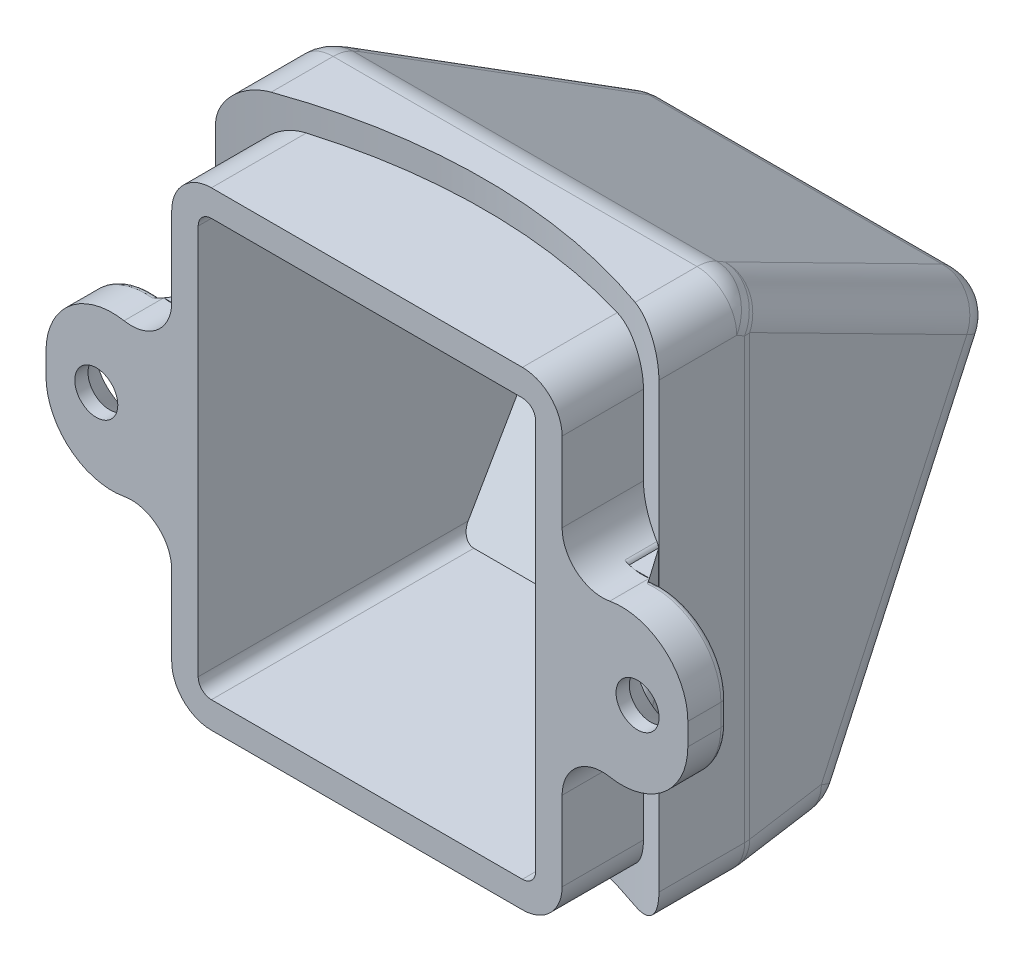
ISO-10303-21;
HEADER;
FILE_DESCRIPTION(('STEP AP214'),'2;1');
FILE_NAME('part.step','',(''),(''),'','','');
FILE_SCHEMA(('AUTOMOTIVE_DESIGN { 1 0 10303 214 1 1 1 1 }'));
ENDSEC;
DATA;
#1=APPLICATION_CONTEXT('core data for automotive mechanical design processes');
#2=APPLICATION_PROTOCOL_DEFINITION('international standard','automotive_design',2000,#1);
#3=PRODUCT_CONTEXT('',#1,'mechanical');
#4=PRODUCT('Part','Part','',(#3));
#5=PRODUCT_RELATED_PRODUCT_CATEGORY('part','',(#4));
#6=PRODUCT_DEFINITION_FORMATION('','',#4);
#7=PRODUCT_DEFINITION_CONTEXT('part definition',#1,'design');
#8=PRODUCT_DEFINITION('design','',#6,#7);
#9=PRODUCT_DEFINITION_SHAPE('','',#8);
#10=(LENGTH_UNIT() NAMED_UNIT(*) SI_UNIT(.MILLI.,.METRE.));
#11=(NAMED_UNIT(*) PLANE_ANGLE_UNIT() SI_UNIT($,.RADIAN.));
#12=(NAMED_UNIT(*) SI_UNIT($,.STERADIAN.) SOLID_ANGLE_UNIT());
#13=UNCERTAINTY_MEASURE_WITH_UNIT(LENGTH_MEASURE(1.E-05),#10,'distance_accuracy_value','');
#14=(GEOMETRIC_REPRESENTATION_CONTEXT(3) GLOBAL_UNCERTAINTY_ASSIGNED_CONTEXT((#13)) GLOBAL_UNIT_ASSIGNED_CONTEXT((#10,
#11,#12)) REPRESENTATION_CONTEXT('',''));
#15=CARTESIAN_POINT('',(0.,0.,0.));
#16=DIRECTION('',(0.,0.,1.));
#17=DIRECTION('',(1.,0.,0.));
#18=AXIS2_PLACEMENT_3D('',#15,#16,#17);
#19=CARTESIAN_POINT('',(-12.75,-5.48939208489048,-16.8359751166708));
#20=DIRECTION('',(0.,0.5,0.866025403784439));
#21=DIRECTION('',(0.,-0.866025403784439,0.5));
#22=AXIS2_PLACEMENT_3D('',#19,#20,#21);
#23=CYLINDRICAL_SURFACE('',#22,10.4);
#24=DIRECTION('',(0.,0.5,0.866025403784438));
#25=VECTOR('',#24,1.);
#26=CARTESIAN_POINT('',(-12.4678099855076,-288682.908196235,-500000.));
#27=LINE('',#26,#25);
#28=CARTESIAN_POINT('',(-12.467809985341,-14.4427401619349,-11.5512871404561));
#29=VERTEX_POINT('',#28);
#30=CARTESIAN_POINT('',(-12.4678099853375,-13.7427401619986,-10.3388515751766));
#31=VERTEX_POINT('',#30);
#32=EDGE_CURVE('E614',#29,#31,#27,.T.);
#33=ORIENTED_EDGE('',*,*,#32,.F.);
#34=CARTESIAN_POINT('',(-12.75,-5.43939208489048,-16.7493725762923));
#35=DIRECTION('',(0.,-0.5,-0.866025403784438));
#36=DIRECTION('',(0.,0.866025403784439,-0.5));
#37=AXIS2_PLACEMENT_3D('',#34,#35,#36);
#38=CIRCLE('',#37,10.4);
#39=CARTESIAN_POINT('',(-12.4678099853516,3.56395599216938,-21.9474580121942));
#40=VERTEX_POINT('',#39);
#41=EDGE_CURVE('E602',#40,#29,#38,.T.);
#42=ORIENTED_EDGE('',*,*,#41,.F.);
#43=DIRECTION('',(0.,0.5,0.866025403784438));
#44=VECTOR('',#43,1.);
#45=CARTESIAN_POINT('',(-12.4678099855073,-288658.89926803,-500000.));
#46=LINE('',#45,#44);
#47=CARTESIAN_POINT('',(-12.4678099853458,4.26395599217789,-20.7350224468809));
#48=VERTEX_POINT('',#47);
#49=EDGE_CURVE('E626',#40,#48,#46,.T.);
#50=ORIENTED_EDGE('',*,*,#49,.T.);
#51=CARTESIAN_POINT('',(-12.75,-4.73939208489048,-15.5369370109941));
#52=DIRECTION('',(0.,0.5,0.866025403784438));
#53=DIRECTION('',(0.,-0.866025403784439,0.5));
#54=AXIS2_PLACEMENT_3D('',#51,#52,#53);
#55=CIRCLE('',#54,10.4);
#56=EDGE_CURVE('E615',#48,#31,#55,.F.);
#57=ORIENTED_EDGE('',*,*,#56,.T.);
#58=EDGE_LOOP('',(#33,#42,#50,#57));
#59=FACE_BOUND('',#58,.T.);
#60=ADVANCED_FACE('F80',(#59),#23,.T.);
#61=DIRECTION('',(0.,0.5,0.866025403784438));
#62=VECTOR('',#61,1.);
#63=CARTESIAN_POINT('',(-13.0321900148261,-288682.908196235,-500000.));
#64=LINE('',#63,#62);
#65=CARTESIAN_POINT('',(-13.0321900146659,-14.4427401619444,-11.551287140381));
#66=VERTEX_POINT('',#65);
#67=CARTESIAN_POINT('',(-13.0321900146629,-13.7427401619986,-10.3388515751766));
#68=VERTEX_POINT('',#67);
#69=EDGE_CURVE('E95',#66,#68,#64,.T.);
#70=ORIENTED_EDGE('',*,*,#69,.T.);
#71=CARTESIAN_POINT('',(-13.0321900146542,4.26395599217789,-20.7350224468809));
#72=VERTEX_POINT('',#71);
#73=EDGE_CURVE('E1147',#68,#72,#55,.F.);
#74=ORIENTED_EDGE('',*,*,#73,.T.);
#75=DIRECTION('',(0.,0.5,0.866025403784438));
#76=VECTOR('',#75,1.);
#77=CARTESIAN_POINT('',(-13.0321900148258,-288658.89926803,-500000.));
#78=LINE('',#77,#76);
#79=CARTESIAN_POINT('',(-13.0321900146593,3.56395599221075,-21.9474580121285));
#80=VERTEX_POINT('',#79);
#81=EDGE_CURVE('E622',#80,#72,#78,.T.);
#82=ORIENTED_EDGE('',*,*,#81,.F.);
#83=EDGE_CURVE('E611',#66,#80,#38,.T.);
#84=ORIENTED_EDGE('',*,*,#83,.F.);
#85=EDGE_LOOP('',(#70,#74,#82,#84));
#86=FACE_BOUND('',#85,.T.);
#87=ADVANCED_FACE('F772',(#86),#23,.T.);
#88=CARTESIAN_POINT('',(19.5,-18.0980762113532,-7.82429713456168));
#89=DIRECTION('',(0.,0.5,0.866025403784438));
#90=DIRECTION('',(0.,-0.866025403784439,0.5));
#91=AXIS2_PLACEMENT_3D('',#88,#89,#90);
#92=PLANE('',#91);
#93=DIRECTION('',(-0.070097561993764,-0.863895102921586,0.498770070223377));
#94=VECTOR('',#93,1.);
#95=CARTESIAN_POINT('',(-25.5137450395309,-15.3587212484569,-9.40586445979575));
#96=LINE('',#95,#94);
#97=CARTESIAN_POINT('',(-25.614307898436,-16.5980762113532,-8.69032253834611));
#98=VERTEX_POINT('',#97);
#99=CARTESIAN_POINT('',(-23.8179287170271,5.54082753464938,-21.4722245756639));
#100=VERTEX_POINT('',#99);
#101=EDGE_CURVE('E2478',#98,#100,#96,.F.);
#102=ORIENTED_EDGE('',*,*,#101,.T.);
#103=DIRECTION('',(-1.,0.,0.));
#104=VECTOR('',#103,1.);
#105=CARTESIAN_POINT('',(19.5,5.54082753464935,-21.4722245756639));
#106=LINE('',#105,#104);
#107=CARTESIAN_POINT('',(-1.68207128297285,5.54082753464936,-21.4722245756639));
#108=VERTEX_POINT('',#107);
#109=EDGE_CURVE('E2473',#100,#108,#106,.F.);
#110=ORIENTED_EDGE('',*,*,#109,.T.);
#111=DIRECTION('',(0.0700975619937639,-0.863895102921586,0.498770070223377));
#112=VECTOR('',#111,1.);
#113=CARTESIAN_POINT('',(0.330676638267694,-19.2646439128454,-7.1507789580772));
#114=LINE('',#113,#112);
#115=CARTESIAN_POINT('',(0.114307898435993,-16.5980762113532,-8.69032253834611));
#116=VERTEX_POINT('',#115);
#117=EDGE_CURVE('E2471',#108,#116,#114,.T.);
#118=ORIENTED_EDGE('',*,*,#117,.T.);
#119=DIRECTION('',(-1.,0.,0.));
#120=VECTOR('',#119,1.);
#121=CARTESIAN_POINT('',(19.5,-16.5980762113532,-8.69032253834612));
#122=LINE('',#121,#120);
#123=EDGE_CURVE('E2476',#116,#98,#122,.T.);
#124=ORIENTED_EDGE('',*,*,#123,.T.);
#125=EDGE_LOOP('',(#102,#110,#118,#124));
#126=FACE_BOUND('',#125,.T.);
#127=CARTESIAN_POINT('',(-12.7500000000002,-13.8309251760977,-10.2879379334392));
#128=DIRECTION('',(0.,-0.5,-0.866025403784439));
#129=DIRECTION('',(0.,-0.866025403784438,0.5));
#130=AXIS2_PLACEMENT_3D('',#127,#128,#129);
#131=CIRCLE('',#130,0.3);
#132=EDGE_CURVE('E102',#31,#68,#131,.T.);
#133=ORIENTED_EDGE('',*,*,#132,.F.);
#134=ORIENTED_EDGE('',*,*,#56,.F.);
#135=CARTESIAN_POINT('',(-12.75,4.35214100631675,-20.785936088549));
#136=DIRECTION('',(0.,-0.5,-0.866025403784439));
#137=DIRECTION('',(0.,-0.866025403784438,0.5));
#138=AXIS2_PLACEMENT_3D('',#135,#136,#137);
#139=CIRCLE('',#138,0.3);
#140=EDGE_CURVE('E619',#72,#48,#139,.T.);
#141=ORIENTED_EDGE('',*,*,#140,.F.);
#142=ORIENTED_EDGE('',*,*,#73,.F.);
#143=EDGE_LOOP('',(#133,#134,#141,#142));
#144=FACE_BOUND('',#143,.T.);
#145=ADVANCED_FACE('F777',(#126,#144),#92,.F.);
#146=CARTESIAN_POINT('',(-12.75,-5.43939208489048,-16.7493725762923));
#147=DIRECTION('',(0.,-0.5,-0.866025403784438));
#148=DIRECTION('',(0.,0.866025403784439,-0.5));
#149=AXIS2_PLACEMENT_3D('',#146,#147,#148);
#150=PLANE('',#149);
#151=CARTESIAN_POINT('',(-12.75,-5.43939208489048,-16.7493725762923));
#152=DIRECTION('',(0.,-0.5,-0.866025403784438));
#153=DIRECTION('',(0.,0.866025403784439,-0.5));
#154=AXIS2_PLACEMENT_3D('',#151,#152,#153);
#155=CIRCLE('',#154,10.9);
#156=CARTESIAN_POINT('',(-12.75,4.0002848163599,-22.1993725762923));
#157=VERTEX_POINT('',#156);
#158=EDGE_CURVE('E634',#157,#157,#155,.T.);
#159=ORIENTED_EDGE('',*,*,#158,.F.);
#160=EDGE_LOOP('',(#159));
#161=FACE_BOUND('',#160,.T.);
#162=CARTESIAN_POINT('',(-12.7500000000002,-14.530925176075,-11.500373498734));
#163=DIRECTION('',(0.,-0.5,-0.866025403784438));
#164=DIRECTION('',(0.,0.866025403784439,-0.5));
#165=AXIS2_PLACEMENT_3D('',#162,#163,#164);
#166=CIRCLE('',#165,0.3);
#167=EDGE_CURVE('E606',#29,#66,#166,.T.);
#168=ORIENTED_EDGE('',*,*,#167,.T.);
#169=ORIENTED_EDGE('',*,*,#83,.T.);
#170=CARTESIAN_POINT('',(-12.75,3.65214100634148,-21.998371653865));
#171=DIRECTION('',(0.,-0.5,-0.866025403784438));
#172=DIRECTION('',(0.,0.866025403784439,-0.5));
#173=AXIS2_PLACEMENT_3D('',#170,#171,#172);
#174=CIRCLE('',#173,0.3);
#175=EDGE_CURVE('E608',#80,#40,#174,.T.);
#176=ORIENTED_EDGE('',*,*,#175,.T.);
#177=ORIENTED_EDGE('',*,*,#41,.T.);
#178=EDGE_LOOP('',(#168,#169,#176,#177));
#179=FACE_BOUND('',#178,.T.);
#180=ADVANCED_FACE('F604',(#161,#179),#150,.F.);
#181=CARTESIAN_POINT('',(5.04989319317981,-7.09807621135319,9.));
#182=DIRECTION('',(0.,0.,-1.));
#183=DIRECTION('',(-1.,0.,0.));
#184=AXIS2_PLACEMENT_3D('',#181,#182,#183);
#185=PLANE('',#184);
#186=CARTESIAN_POINT('',(7.7,1.65192378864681,9.));
#187=DIRECTION('',(0.,0.,-1.));
#188=DIRECTION('',(-1.,0.,0.));
#189=AXIS2_PLACEMENT_3D('',#186,#187,#188);
#190=CIRCLE('',#189,3.125);
#191=CARTESIAN_POINT('',(4.57499999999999,1.65192378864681,9.));
#192=VERTEX_POINT('',#191);
#193=EDGE_CURVE('E2582',#192,#192,#190,.F.);
#194=ORIENTED_EDGE('',*,*,#193,.T.);
#195=EDGE_LOOP('',(#194));
#196=FACE_BOUND('',#195,.T.);
#197=DIRECTION('',(1.,0.,0.));
#198=VECTOR('',#197,1.);
#199=CARTESIAN_POINT('',(3.97080420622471,3.90192378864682,9.));
#200=LINE('',#199,#198);
#201=CARTESIAN_POINT('',(3.97080420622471,3.90192378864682,9.));
#202=VERTEX_POINT('',#201);
#203=CARTESIAN_POINT('',(4.37861929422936,3.90192378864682,9.));
#204=VERTEX_POINT('',#203);
#205=EDGE_CURVE('E687',#202,#204,#200,.T.);
#206=ORIENTED_EDGE('',*,*,#205,.T.);
#207=CARTESIAN_POINT('',(4.37861929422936,4.90192378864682,9.));
#208=DIRECTION('',(0.,0.,-1.));
#209=DIRECTION('',(-1.,0.,0.));
#210=AXIS2_PLACEMENT_3D('',#207,#208,#209);
#211=ELLIPSE('',#210,1.22068129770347,1.);
#212=CARTESIAN_POINT('',(5.59930059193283,4.90192378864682,9.));
#213=VERTEX_POINT('',#212);
#214=EDGE_CURVE('E2639',#204,#213,#211,.F.);
#215=ORIENTED_EDGE('',*,*,#214,.T.);
#216=DIRECTION('',(0.,1.,0.));
#217=VECTOR('',#216,1.);
#218=CARTESIAN_POINT('',(5.59930059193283,3.90192378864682,9.));
#219=LINE('',#218,#217);
#220=CARTESIAN_POINT('',(5.59930059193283,6.89265748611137,9.));
#221=VERTEX_POINT('',#220);
#222=EDGE_CURVE('E700',#213,#221,#219,.T.);
#223=ORIENTED_EDGE('',*,*,#222,.T.);
#224=CARTESIAN_POINT('',(6.49999999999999,2.48371877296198,9.));
#225=DIRECTION('',(0.,0.,-1.));
#226=DIRECTION('',(-1.,0.,0.));
#227=AXIS2_PLACEMENT_3D('',#224,#225,#226);
#228=CIRCLE('',#227,4.5);
#229=CARTESIAN_POINT('',(11.,2.48371877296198,9.));
#230=VERTEX_POINT('',#229);
#231=EDGE_CURVE('E2590',#221,#230,#228,.T.);
#232=ORIENTED_EDGE('',*,*,#231,.T.);
#233=DIRECTION('',(0.,-1.,0.));
#234=VECTOR('',#233,1.);
#235=CARTESIAN_POINT('',(11.,-7.09807621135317,9.));
#236=LINE('',#235,#234);
#237=CARTESIAN_POINT('',(11.,0.820128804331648,9.));
#238=VERTEX_POINT('',#237);
#239=EDGE_CURVE('E2585',#230,#238,#236,.T.);
#240=ORIENTED_EDGE('',*,*,#239,.T.);
#241=CARTESIAN_POINT('',(6.5,0.820128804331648,9.));
#242=DIRECTION('',(0.,0.,-1.));
#243=DIRECTION('',(-1.,0.,0.));
#244=AXIS2_PLACEMENT_3D('',#241,#242,#243);
#245=CIRCLE('',#244,4.5);
#246=CARTESIAN_POINT('',(5.59930059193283,-3.58880990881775,9.));
#247=VERTEX_POINT('',#246);
#248=EDGE_CURVE('E2587',#238,#247,#245,.T.);
#249=ORIENTED_EDGE('',*,*,#248,.T.);
#250=DIRECTION('',(0.,-1.,0.));
#251=VECTOR('',#250,1.);
#252=CARTESIAN_POINT('',(5.59930059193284,-0.598076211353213,9.));
#253=LINE('',#252,#251);
#254=CARTESIAN_POINT('',(5.59930059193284,-1.59807621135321,9.));
#255=VERTEX_POINT('',#254);
#256=EDGE_CURVE('E647',#255,#247,#253,.T.);
#257=ORIENTED_EDGE('',*,*,#256,.F.);
#258=CARTESIAN_POINT('',(4.37861929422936,-1.59807621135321,9.));
#259=DIRECTION('',(0.,0.,-1.));
#260=DIRECTION('',(-1.,0.,0.));
#261=AXIS2_PLACEMENT_3D('',#258,#259,#260);
#262=ELLIPSE('',#261,1.22068129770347,1.);
#263=CARTESIAN_POINT('',(4.37861929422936,-0.598076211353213,9.));
#264=VERTEX_POINT('',#263);
#265=EDGE_CURVE('E2838',#255,#264,#262,.F.);
#266=ORIENTED_EDGE('',*,*,#265,.T.);
#267=DIRECTION('',(-1.,0.,0.));
#268=VECTOR('',#267,1.);
#269=CARTESIAN_POINT('',(3.97080420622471,-0.598076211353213,9.));
#270=LINE('',#269,#268);
#271=CARTESIAN_POINT('',(3.97080420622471,-0.598076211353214,9.));
#272=VERTEX_POINT('',#271);
#273=EDGE_CURVE('E641',#264,#272,#270,.T.);
#274=ORIENTED_EDGE('',*,*,#273,.T.);
#275=DIRECTION('',(0.,-1.,0.));
#276=VECTOR('',#275,1.);
#277=CARTESIAN_POINT('',(3.97080420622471,7.54930824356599,9.));
#278=LINE('',#277,#276);
#279=EDGE_CURVE('E732',#202,#272,#278,.T.);
#280=ORIENTED_EDGE('',*,*,#279,.F.);
#281=EDGE_LOOP('',(#206,#215,#223,#232,#240,#249,#257,#266,#274,#280));
#282=FACE_BOUND('',#281,.T.);
#283=ADVANCED_FACE('F757',(#196,#282),#185,.T.);
#284=CARTESIAN_POINT('',(3.97080420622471,7.54930824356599,-25.8565909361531));
#285=DIRECTION('',(-1.,0.,0.));
#286=DIRECTION('',(0.,-1.,0.));
#287=AXIS2_PLACEMENT_3D('',#284,#285,#286);
#288=PLANE('',#287);
#289=DIRECTION('',(0.,0.,-1.));
#290=VECTOR('',#289,1.);
#291=CARTESIAN_POINT('',(3.97080420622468,-0.598076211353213,6.6737257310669));
#292=LINE('',#291,#290);
#293=CARTESIAN_POINT('',(3.9708042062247,-0.598076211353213,8.4174443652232));
#294=VERTEX_POINT('',#293);
#295=EDGE_CURVE('E643',#272,#294,#292,.T.);
#296=ORIENTED_EDGE('',*,*,#295,.T.);
#297=CARTESIAN_POINT('',(3.97080420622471,-1.59807621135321,8.41744436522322));
#298=DIRECTION('',(-1.,0.,0.));
#299=DIRECTION('',(0.,0.,-1.));
#300=AXIS2_PLACEMENT_3D('',#297,#298,#299);
#301=ELLIPSE('',#300,1.74371863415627,1.);
#302=CARTESIAN_POINT('',(3.97080420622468,-1.59807621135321,6.6737257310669));
#303=VERTEX_POINT('',#302);
#304=EDGE_CURVE('E2648',#294,#303,#301,.T.);
#305=ORIENTED_EDGE('',*,*,#304,.T.);
#306=DIRECTION('',(0.,-1.,0.));
#307=VECTOR('',#306,1.);
#308=CARTESIAN_POINT('',(3.9708042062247,88.4019237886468,6.67372573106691));
#309=LINE('',#308,#307);
#310=CARTESIAN_POINT('',(3.97080420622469,4.90192378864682,6.67372573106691));
#311=VERTEX_POINT('',#310);
#312=EDGE_CURVE('E741',#303,#311,#309,.F.);
#313=ORIENTED_EDGE('',*,*,#312,.T.);
#314=CARTESIAN_POINT('',(3.97080420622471,4.90192378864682,8.41744436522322));
#315=DIRECTION('',(-1.,0.,0.));
#316=DIRECTION('',(0.,0.,-1.));
#317=AXIS2_PLACEMENT_3D('',#314,#315,#316);
#318=ELLIPSE('',#317,1.74371863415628,1.);
#319=CARTESIAN_POINT('',(3.9708042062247,3.90192378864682,8.41744436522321));
#320=VERTEX_POINT('',#319);
#321=EDGE_CURVE('E2644',#311,#320,#318,.T.);
#322=ORIENTED_EDGE('',*,*,#321,.T.);
#323=DIRECTION('',(0.,0.,1.));
#324=VECTOR('',#323,1.);
#325=CARTESIAN_POINT('',(3.97080420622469,3.90192378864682,6.67372573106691));
#326=LINE('',#325,#324);
#327=EDGE_CURVE('E685',#320,#202,#326,.T.);
#328=ORIENTED_EDGE('',*,*,#327,.T.);
#329=ORIENTED_EDGE('',*,*,#279,.T.);
#330=EDGE_LOOP('',(#296,#305,#313,#322,#328,#329));
#331=FACE_BOUND('',#330,.T.);
#332=ADVANCED_FACE('F753',(#331),#288,.F.);
#333=CARTESIAN_POINT('',(-32.,2.48371877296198,9.));
#334=DIRECTION('',(0.,0.,-1.));
#335=DIRECTION('',(-1.,0.,0.));
#336=AXIS2_PLACEMENT_3D('',#333,#334,#335);
#337=PLANE('',#336);
#338=CARTESIAN_POINT('',(-30.5498931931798,-7.09807621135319,9.));
#339=DIRECTION('',(0.,0.,1.));
#340=DIRECTION('',(-1.,0.,0.));
#341=AXIS2_PLACEMENT_3D('',#338,#339,#340);
#342=CIRCLE('',#341,3.0498931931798);
#343=CARTESIAN_POINT('',(-29.2289554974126,-4.34908146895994,9.));
#344=VERTEX_POINT('',#343);
#345=CARTESIAN_POINT('',(-30.0004857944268,-4.0980762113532,9.));
#346=VERTEX_POINT('',#345);
#347=EDGE_CURVE('E2677',#344,#346,#342,.T.);
#348=ORIENTED_EDGE('',*,*,#347,.T.);
#349=DIRECTION('',(-1.,0.,0.));
#350=VECTOR('',#349,1.);
#351=CARTESIAN_POINT('',(-31.0993005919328,-4.0980762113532,9.));
#352=LINE('',#351,#350);
#353=CARTESIAN_POINT('',(-29.4708042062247,-4.0980762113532,9.));
#354=VERTEX_POINT('',#353);
#355=EDGE_CURVE('E665',#354,#346,#352,.T.);
#356=ORIENTED_EDGE('',*,*,#355,.F.);
#357=CARTESIAN_POINT('',(-29.0124007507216,-3.89841081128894,9.));
#358=DIRECTION('',(0.,0.,-1.));
#359=DIRECTION('',(-1.,0.,0.));
#360=AXIS2_PLACEMENT_3D('',#357,#358,#359);
#361=CIRCLE('',#360,0.5);
#362=EDGE_CURVE('E1131',#354,#344,#361,.F.);
#363=ORIENTED_EDGE('',*,*,#362,.T.);
#364=EDGE_LOOP('',(#348,#356,#363));
#365=FACE_BOUND('',#364,.T.);
#366=ADVANCED_FACE('F756',(#365),#337,.T.);
#367=CARTESIAN_POINT('',(5.04989319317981,10.4019237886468,9.));
#368=DIRECTION('',(0.,0.,1.));
#369=DIRECTION('',(-1.,0.,0.));
#370=AXIS2_PLACEMENT_3D('',#367,#368,#369);
#371=CIRCLE('',#370,3.04989319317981);
#372=CARTESIAN_POINT('',(3.72895549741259,7.65292904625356,9.));
#373=VERTEX_POINT('',#372);
#374=CARTESIAN_POINT('',(4.50048579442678,7.40192378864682,9.));
#375=VERTEX_POINT('',#374);
#376=EDGE_CURVE('E2779',#373,#375,#371,.T.);
#377=ORIENTED_EDGE('',*,*,#376,.T.);
#378=DIRECTION('',(1.,0.,0.));
#379=VECTOR('',#378,1.);
#380=CARTESIAN_POINT('',(3.97080420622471,7.40192378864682,9.));
#381=LINE('',#380,#379);
#382=CARTESIAN_POINT('',(3.97080420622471,7.40192378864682,9.));
#383=VERTEX_POINT('',#382);
#384=EDGE_CURVE('E688',#383,#375,#381,.T.);
#385=ORIENTED_EDGE('',*,*,#384,.F.);
#386=CARTESIAN_POINT('',(3.51240075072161,7.20225838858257,9.));
#387=DIRECTION('',(0.,0.,-1.));
#388=DIRECTION('',(-1.,0.,0.));
#389=AXIS2_PLACEMENT_3D('',#386,#387,#388);
#390=CIRCLE('',#389,0.5);
#391=EDGE_CURVE('E2658',#383,#373,#390,.F.);
#392=ORIENTED_EDGE('',*,*,#391,.T.);
#393=EDGE_LOOP('',(#377,#385,#392));
#394=FACE_BOUND('',#393,.T.);
#395=ADVANCED_FACE('F763',(#394),#185,.T.);
#396=CARTESIAN_POINT('',(-33.2,1.65192378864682,9.));
#397=DIRECTION('',(0.,0.,-1.));
#398=DIRECTION('',(-1.,0.,0.));
#399=AXIS2_PLACEMENT_3D('',#396,#397,#398);
#400=CIRCLE('',#399,3.12499999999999);
#401=CARTESIAN_POINT('',(-36.325,1.65192378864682,9.));
#402=VERTEX_POINT('',#401);
#403=EDGE_CURVE('E2571',#402,#402,#400,.F.);
#404=ORIENTED_EDGE('',*,*,#403,.T.);
#405=EDGE_LOOP('',(#404));
#406=FACE_BOUND('',#405,.T.);
#407=DIRECTION('',(-1.,0.,0.));
#408=VECTOR('',#407,1.);
#409=CARTESIAN_POINT('',(-31.0993005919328,-0.598076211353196,9.));
#410=LINE('',#409,#408);
#411=CARTESIAN_POINT('',(-29.4708042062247,-0.598076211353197,9.));
#412=VERTEX_POINT('',#411);
#413=CARTESIAN_POINT('',(-30.4889599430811,-0.598076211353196,9.));
#414=VERTEX_POINT('',#413);
#415=EDGE_CURVE('E664',#412,#414,#410,.T.);
#416=ORIENTED_EDGE('',*,*,#415,.T.);
#417=CARTESIAN_POINT('',(-30.4889599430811,-1.0980762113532,9.));
#418=DIRECTION('',(0.,0.,-1.));
#419=DIRECTION('',(1.,0.,0.));
#420=AXIS2_PLACEMENT_3D('',#417,#418,#419);
#421=ELLIPSE('',#420,0.610340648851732,0.5);
#422=CARTESIAN_POINT('',(-31.0993005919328,-1.0980762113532,9.));
#423=VERTEX_POINT('',#422);
#424=EDGE_CURVE('E2859',#414,#423,#421,.F.);
#425=ORIENTED_EDGE('',*,*,#424,.T.);
#426=DIRECTION('',(0.,-1.,0.));
#427=VECTOR('',#426,1.);
#428=CARTESIAN_POINT('',(-31.0993005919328,-0.598076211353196,9.));
#429=LINE('',#428,#427);
#430=CARTESIAN_POINT('',(-31.0993005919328,-3.58880990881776,9.));
#431=VERTEX_POINT('',#430);
#432=EDGE_CURVE('E677',#423,#431,#429,.T.);
#433=ORIENTED_EDGE('',*,*,#432,.T.);
#434=CARTESIAN_POINT('',(-32.,0.820128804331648,9.));
#435=DIRECTION('',(0.,0.,-1.));
#436=DIRECTION('',(-1.,0.,0.));
#437=AXIS2_PLACEMENT_3D('',#434,#435,#436);
#438=CIRCLE('',#437,4.5);
#439=CARTESIAN_POINT('',(-36.5,0.820128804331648,9.));
#440=VERTEX_POINT('',#439);
#441=EDGE_CURVE('E2608',#431,#440,#438,.T.);
#442=ORIENTED_EDGE('',*,*,#441,.T.);
#443=DIRECTION('',(0.,1.,0.));
#444=VECTOR('',#443,1.);
#445=CARTESIAN_POINT('',(-36.5,2.48371877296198,9.));
#446=LINE('',#445,#444);
#447=CARTESIAN_POINT('',(-36.5,2.48371877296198,9.));
#448=VERTEX_POINT('',#447);
#449=EDGE_CURVE('E2603',#440,#448,#446,.T.);
#450=ORIENTED_EDGE('',*,*,#449,.T.);
#451=CARTESIAN_POINT('',(-32.,2.48371877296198,9.));
#452=DIRECTION('',(0.,0.,-1.));
#453=DIRECTION('',(-1.,0.,0.));
#454=AXIS2_PLACEMENT_3D('',#451,#452,#453);
#455=CIRCLE('',#454,4.5);
#456=CARTESIAN_POINT('',(-31.0993005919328,6.89265748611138,9.));
#457=VERTEX_POINT('',#456);
#458=EDGE_CURVE('E2605',#448,#457,#455,.T.);
#459=ORIENTED_EDGE('',*,*,#458,.T.);
#460=DIRECTION('',(0.,1.,0.));
#461=VECTOR('',#460,1.);
#462=CARTESIAN_POINT('',(-31.0993005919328,3.90192378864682,9.));
#463=LINE('',#462,#461);
#464=CARTESIAN_POINT('',(-31.0993005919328,4.90192378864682,9.));
#465=VERTEX_POINT('',#464);
#466=EDGE_CURVE('E714',#465,#457,#463,.T.);
#467=ORIENTED_EDGE('',*,*,#466,.F.);
#468=CARTESIAN_POINT('',(-29.8786192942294,4.90192378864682,9.));
#469=DIRECTION('',(0.,0.,-1.));
#470=DIRECTION('',(1.,0.,0.));
#471=AXIS2_PLACEMENT_3D('',#468,#469,#470);
#472=ELLIPSE('',#471,1.22068129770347,1.);
#473=CARTESIAN_POINT('',(-29.8786192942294,3.90192378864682,9.));
#474=VERTEX_POINT('',#473);
#475=EDGE_CURVE('E2839',#465,#474,#472,.F.);
#476=ORIENTED_EDGE('',*,*,#475,.T.);
#477=DIRECTION('',(1.,0.,0.));
#478=VECTOR('',#477,1.);
#479=CARTESIAN_POINT('',(-31.0993005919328,3.90192378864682,9.));
#480=LINE('',#479,#478);
#481=CARTESIAN_POINT('',(-29.4708042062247,3.90192378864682,9.));
#482=VERTEX_POINT('',#481);
#483=EDGE_CURVE('E708',#474,#482,#480,.T.);
#484=ORIENTED_EDGE('',*,*,#483,.T.);
#485=DIRECTION('',(0.,1.,0.));
#486=VECTOR('',#485,1.);
#487=CARTESIAN_POINT('',(-29.4708042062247,7.54930824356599,9.));
#488=LINE('',#487,#486);
#489=EDGE_CURVE('E2693',#412,#482,#488,.T.);
#490=ORIENTED_EDGE('',*,*,#489,.F.);
#491=EDGE_LOOP('',(#416,#425,#433,#442,#450,#459,#467,#476,#484,#490));
#492=FACE_BOUND('',#491,.T.);
#493=ADVANCED_FACE('F766',(#406,#492),#337,.T.);
#494=CARTESIAN_POINT('',(-29.4708042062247,7.54930824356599,-25.8565909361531));
#495=DIRECTION('',(1.,0.,0.));
#496=DIRECTION('',(0.,0.,-1.));
#497=AXIS2_PLACEMENT_3D('',#494,#495,#496);
#498=PLANE('',#497);
#499=DIRECTION('',(0.,-1.,0.));
#500=VECTOR('',#499,1.);
#501=CARTESIAN_POINT('',(-29.4708042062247,88.4019237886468,6.67372573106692));
#502=LINE('',#501,#500);
#503=CARTESIAN_POINT('',(-29.4708042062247,4.90192378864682,6.67372573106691));
#504=VERTEX_POINT('',#503);
#505=CARTESIAN_POINT('',(-29.4708042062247,-1.0980762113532,6.67372573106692));
#506=VERTEX_POINT('',#505);
#507=EDGE_CURVE('E2688',#504,#506,#502,.T.);
#508=ORIENTED_EDGE('',*,*,#507,.T.);
#509=CARTESIAN_POINT('',(-29.4708042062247,-1.0980762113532,7.54558504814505));
#510=DIRECTION('',(1.,0.,0.));
#511=DIRECTION('',(0.,0.,-1.));
#512=AXIS2_PLACEMENT_3D('',#509,#510,#511);
#513=ELLIPSE('',#512,0.871859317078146,0.5);
#514=CARTESIAN_POINT('',(-29.4708042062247,-0.598076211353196,7.54558504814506));
#515=VERTEX_POINT('',#514);
#516=EDGE_CURVE('E2857',#506,#515,#513,.T.);
#517=ORIENTED_EDGE('',*,*,#516,.T.);
#518=DIRECTION('',(0.,0.,1.));
#519=VECTOR('',#518,1.);
#520=CARTESIAN_POINT('',(-29.4708042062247,-0.598076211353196,9.));
#521=LINE('',#520,#519);
#522=EDGE_CURVE('E662',#515,#412,#521,.T.);
#523=ORIENTED_EDGE('',*,*,#522,.T.);
#524=ORIENTED_EDGE('',*,*,#489,.T.);
#525=DIRECTION('',(0.,0.,-1.));
#526=VECTOR('',#525,1.);
#527=CARTESIAN_POINT('',(-29.4708042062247,3.90192378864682,9.));
#528=LINE('',#527,#526);
#529=CARTESIAN_POINT('',(-29.4708042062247,3.90192378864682,8.41744436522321));
#530=VERTEX_POINT('',#529);
#531=EDGE_CURVE('E710',#482,#530,#528,.T.);
#532=ORIENTED_EDGE('',*,*,#531,.T.);
#533=CARTESIAN_POINT('',(-29.4708042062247,4.90192378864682,8.41744436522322));
#534=DIRECTION('',(1.,0.,0.));
#535=DIRECTION('',(0.,0.,-1.));
#536=AXIS2_PLACEMENT_3D('',#533,#534,#535);
#537=ELLIPSE('',#536,1.74371863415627,1.);
#538=EDGE_CURVE('E2836',#530,#504,#537,.T.);
#539=ORIENTED_EDGE('',*,*,#538,.T.);
#540=EDGE_LOOP('',(#508,#517,#523,#524,#532,#539));
#541=FACE_BOUND('',#540,.T.);
#542=ADVANCED_FACE('F1058',(#541),#498,.F.);
#543=CARTESIAN_POINT('',(-12.75,88.4019237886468,44.1091996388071));
#544=DIRECTION('',(0.,-1.,0.));
#545=DIRECTION('',(1.,0.,0.));
#546=AXIS2_PLACEMENT_3D('',#543,#544,#545);
#547=CYLINDRICAL_SURFACE('',#546,41.);
#548=CARTESIAN_POINT('',(0.999999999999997,-18.0980762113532,5.48359284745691));
#549=CARTESIAN_POINT('',(1.08517531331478,-18.0980735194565,5.51391208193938));
#550=CARTESIAN_POINT('',(1.1702103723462,-18.0944473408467,5.54450237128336));
#551=CARTESIAN_POINT('',(1.33953131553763,-18.0800128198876,5.60604128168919));
#552=CARTESIAN_POINT('',(1.42381725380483,-18.0692050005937,5.63698987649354));
#553=CARTESIAN_POINT('',(1.67481885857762,-18.0261137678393,5.73008629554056));
#554=CARTESIAN_POINT('',(1.83972796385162,-17.9831625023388,5.79250244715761));
#555=CARTESIAN_POINT('',(2.16398610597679,-17.8685311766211,5.91752555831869));
#556=CARTESIAN_POINT('',(2.32311773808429,-17.7962084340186,5.98010342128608));
#557=CARTESIAN_POINT('',(2.62742339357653,-17.6243393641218,6.10180956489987));
#558=CARTESIAN_POINT('',(2.77259937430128,-17.524796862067,6.16093832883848));
#559=CARTESIAN_POINT('',(3.04499434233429,-17.3001759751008,6.27350272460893));
#560=CARTESIAN_POINT('',(3.17216482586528,-17.1750307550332,6.32692288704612));
#561=CARTESIAN_POINT('',(3.40359090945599,-16.9021601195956,6.42528598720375));
#562=CARTESIAN_POINT('',(3.50785159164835,-16.75443972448,6.4702308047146));
#563=CARTESIAN_POINT('',(3.68414452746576,-16.4489161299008,6.54688249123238));
#564=CARTESIAN_POINT('',(3.75761773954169,-16.2920939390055,6.57917500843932));
#565=CARTESIAN_POINT('',(3.87681574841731,-15.9663774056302,6.63182918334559));
#566=CARTESIAN_POINT('',(3.92255885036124,-15.7974911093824,6.65219871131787));
#567=CARTESIAN_POINT('',(3.98149380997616,-15.4674758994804,6.67848946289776));
#568=CARTESIAN_POINT('',(3.99705213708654,-15.3068503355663,6.6854606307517));
#569=CARTESIAN_POINT('',(4.00218273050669,-14.9851196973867,6.68775668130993));
#570=CARTESIAN_POINT('',(3.99176197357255,-14.8240147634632,6.68308469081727));
#571=CARTESIAN_POINT('',(3.94637928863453,-14.5127662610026,6.6628182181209));
#572=CARTESIAN_POINT('',(3.91243090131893,-14.3624432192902,6.64767488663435));
#573=CARTESIAN_POINT('',(3.8224675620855,-14.0699236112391,6.60779005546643));
#574=CARTESIAN_POINT('',(3.76645156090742,-13.9277274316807,6.58304809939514));
#575=CARTESIAN_POINT('',(3.6326264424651,-13.6511795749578,6.52442874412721));
#576=CARTESIAN_POINT('',(3.55427336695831,-13.5171403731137,6.4903242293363));
#577=CARTESIAN_POINT('',(3.37906143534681,-13.2640145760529,6.41487040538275));
#578=CARTESIAN_POINT('',(3.28219386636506,-13.1449350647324,6.37351768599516));
#579=CARTESIAN_POINT('',(3.06509079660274,-12.9158526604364,6.28199039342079));
#580=CARTESIAN_POINT('',(2.94366432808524,-12.8071507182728,6.23139179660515));
#581=CARTESIAN_POINT('',(2.6861823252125,-12.6115323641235,6.12573509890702));
#582=CARTESIAN_POINT('',(2.5501345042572,-12.5246045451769,6.07067935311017));
#583=CARTESIAN_POINT('',(2.34260971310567,-12.4142362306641,5.98810042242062));
#584=CARTESIAN_POINT('',(2.27544107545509,-12.3816794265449,5.96157212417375));
#585=CARTESIAN_POINT('',(2.13914656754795,-12.3217717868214,5.90817001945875));
#586=CARTESIAN_POINT('',(2.07002518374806,-12.2944099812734,5.88129707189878));
#587=CARTESIAN_POINT('',(2.00000000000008,-12.2696490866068,5.85429799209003));
#588=B_SPLINE_CURVE_WITH_KNOTS('',3,(#548,#549,#550,#551,#552,#553,#554,#555,#556,#557,#558,
#559,#560,#561,#562,#563,#564,#565,#566,#567,#568,#569,#570,#571,#572,#573,#574,#575,#576,#577,
#578,#579,#580,#581,#582,#583,#584,#585,#586,#587),.UNSPECIFIED.,.F.,.F.,(4,2,2,2,2,2,2,2,2,2,2,
2,2,2,2,2,2,2,2,4),(0.,0.271078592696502,0.542137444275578,1.08409883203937,1.63861938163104,
2.19306204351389,2.7489709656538,3.3047564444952,3.83040618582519,4.35570855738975,
4.83783451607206,5.31983101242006,5.78225860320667,6.24470818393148,6.71955475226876,
7.19462533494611,7.70444394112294,8.21399490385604,8.45148154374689,8.68846098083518),.UNSPECIFIED.);
#589=CARTESIAN_POINT('',(0.999999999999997,-18.0980762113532,5.48359284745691));
#590=VERTEX_POINT('',#589);
#591=CARTESIAN_POINT('',(4.,-15.0980762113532,6.68677988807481));
#592=VERTEX_POINT('',#591);
#593=EDGE_CURVE('E2719',#590,#592,#588,.T.);
#594=ORIENTED_EDGE('',*,*,#593,.T.);
#595=DIRECTION('',(0.,1.,0.));
#596=VECTOR('',#595,1.);
#597=CARTESIAN_POINT('',(4.,-18.0980762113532,6.68677988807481));
#598=LINE('',#597,#596);
#599=CARTESIAN_POINT('',(4.,18.4019237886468,6.68677988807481));
#600=VERTEX_POINT('',#599);
#601=EDGE_CURVE('E1029',#600,#592,#598,.F.);
#602=ORIENTED_EDGE('',*,*,#601,.F.);
#603=CARTESIAN_POINT('',(1.00000000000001,21.4019237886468,5.48359284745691));
#604=CARTESIAN_POINT('',(1.08976080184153,21.4019204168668,5.515544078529));
#605=CARTESIAN_POINT('',(1.17936281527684,21.397893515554,5.54779565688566));
#606=CARTESIAN_POINT('',(1.35770495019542,21.3818689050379,5.61268494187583));
#607=CARTESIAN_POINT('',(1.44644511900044,21.369871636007,5.64532262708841));
#608=CARTESIAN_POINT('',(1.71045443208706,21.3220591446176,5.74345492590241));
#609=CARTESIAN_POINT('',(1.88363302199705,21.2744230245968,5.80921178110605));
#610=CARTESIAN_POINT('',(2.21924978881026,21.1488447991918,5.93913238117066));
#611=CARTESIAN_POINT('',(2.38168475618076,21.0708936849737,6.0032956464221));
#612=CARTESIAN_POINT('',(2.69118608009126,20.8863474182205,6.12765677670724));
#613=CARTESIAN_POINT('',(2.8382483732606,20.7797447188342,6.1878535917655));
#614=CARTESIAN_POINT('',(3.10994347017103,20.5420440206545,6.30068872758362));
#615=CARTESIAN_POINT('',(3.23490740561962,20.4113809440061,6.35343571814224));
#616=CARTESIAN_POINT('',(3.40395839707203,20.1989191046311,6.42560369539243));
#617=CARTESIAN_POINT('',(3.45721467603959,20.1254062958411,6.44848850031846));
#618=CARTESIAN_POINT('',(3.55713613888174,19.9733291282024,6.49164704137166));
#619=CARTESIAN_POINT('',(3.60380504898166,19.8947676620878,6.51192225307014));
#620=CARTESIAN_POINT('',(3.68208321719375,19.7480353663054,6.54607785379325));
#621=CARTESIAN_POINT('',(3.71488361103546,19.6806108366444,6.56044854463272));
#622=CARTESIAN_POINT('',(3.77547405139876,19.5431484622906,6.58707554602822));
#623=CARTESIAN_POINT('',(3.80326352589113,19.473110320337,6.59933161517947));
#624=CARTESIAN_POINT('',(3.87962836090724,19.2570781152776,6.63309199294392));
#625=CARTESIAN_POINT('',(3.91995809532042,19.1074779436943,6.65104350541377));
#626=CARTESIAN_POINT('',(3.97713562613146,18.8028440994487,6.67654104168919));
#627=CARTESIAN_POINT('',(3.99395348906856,18.6478037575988,6.68407380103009));
#628=CARTESIAN_POINT('',(4.00332255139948,18.3368201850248,6.68826681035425));
#629=CARTESIAN_POINT('',(3.9958736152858,18.1808769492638,6.68492699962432));
#630=CARTESIAN_POINT('',(3.95702826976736,17.8726645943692,6.66756978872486));
#631=CARTESIAN_POINT('',(3.92563625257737,17.7203948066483,6.65355434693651));
#632=CARTESIAN_POINT('',(3.84038441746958,17.4242343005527,6.61571639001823));
#633=CARTESIAN_POINT('',(3.78661005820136,17.280314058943,6.59193118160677));
#634=CARTESIAN_POINT('',(3.65862505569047,17.0037290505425,6.535779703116));
#635=CARTESIAN_POINT('',(3.58441359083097,16.8710647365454,6.5034130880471));
#636=CARTESIAN_POINT('',(3.41368845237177,16.6132896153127,6.42970620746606));
#637=CARTESIAN_POINT('',(3.31622567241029,16.4889158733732,6.38799065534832));
#638=CARTESIAN_POINT('',(3.10433707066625,16.2580085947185,6.29844403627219));
#639=CARTESIAN_POINT('',(2.98989501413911,16.1514923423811,6.25060712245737));
#640=CARTESIAN_POINT('',(2.73729665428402,15.9504203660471,6.14653788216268));
#641=CARTESIAN_POINT('',(2.59797482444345,15.8575075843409,6.08993996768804));
#642=CARTESIAN_POINT('',(2.37990158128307,15.7368177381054,6.00287157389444));
#643=CARTESIAN_POINT('',(2.30571910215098,15.699709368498,5.97349602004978));
#644=CARTESIAN_POINT('',(2.15473070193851,15.6318272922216,5.91423152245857));
#645=CARTESIAN_POINT('',(2.07792539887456,15.6010521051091,5.88434270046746));
#646=CARTESIAN_POINT('',(2.,15.5734966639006,5.85429799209));
#647=B_SPLINE_CURVE_WITH_KNOTS('',3,(#603,#604,#605,#606,#607,#608,#609,#610,#611,#612,#613,
#614,#615,#616,#617,#618,#619,#620,#621,#622,#623,#624,#625,#626,#627,#628,#629,#630,#631,#632,
#633,#634,#635,#636,#637,#638,#639,#640,#641,#642,#643,#644,#645,#646),.UNSPECIFIED.,.F.,.F.,(4,
2,2,2,2,2,2,2,2,2,2,2,2,2,2,2,2,2,2,2,2,4),(0.,0.285653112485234,0.571290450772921,
1.1421857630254,1.71325086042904,2.28446652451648,2.84622192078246,3.12674052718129,
3.40709981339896,3.63589721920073,3.86472072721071,4.33031575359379,4.79650300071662,
5.26269285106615,5.7287972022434,6.19313799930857,6.65749746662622,7.14568820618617,
7.63434877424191,8.16217621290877,8.42593126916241,8.68962459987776),.UNSPECIFIED.);
#648=CARTESIAN_POINT('',(1.00000000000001,21.4019237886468,5.48359284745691));
#649=VERTEX_POINT('',#648);
#650=EDGE_CURVE('E1067',#649,#600,#647,.T.);
#651=ORIENTED_EDGE('',*,*,#650,.F.);
#652=CARTESIAN_POINT('',(-12.75,21.4019237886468,44.1091996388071));
#653=DIRECTION('',(0.,-1.,0.));
#654=DIRECTION('',(1.,0.,0.));
#655=AXIS2_PLACEMENT_3D('',#652,#653,#654);
#656=CIRCLE('',#655,41.);
#657=CARTESIAN_POINT('',(-26.5,21.4019237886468,5.48359284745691));
#658=VERTEX_POINT('',#657);
#659=EDGE_CURVE('E1035',#649,#658,#656,.F.);
#660=ORIENTED_EDGE('',*,*,#659,.T.);
#661=CARTESIAN_POINT('',(-27.5,15.5734966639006,5.85429799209));
#662=CARTESIAN_POINT('',(-27.5818817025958,15.6024511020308,5.88586783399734));
#663=CARTESIAN_POINT('',(-27.6625269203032,15.6349610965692,5.9172660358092));
#664=CARTESIAN_POINT('',(-27.8208927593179,15.7069612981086,5.97948137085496));
#665=CARTESIAN_POINT('',(-27.8986127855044,15.746452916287,6.01029838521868));
#666=CARTESIAN_POINT('',(-28.126927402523,15.8753359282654,6.10160932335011));
#667=CARTESIAN_POINT('',(-28.2723832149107,15.9750320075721,6.16084960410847));
#668=CARTESIAN_POINT('',(-28.5450891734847,16.1998950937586,6.27354131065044));
#669=CARTESIAN_POINT('',(-28.6723070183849,16.3251063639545,6.32698242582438));
#670=CARTESIAN_POINT('',(-28.9036969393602,16.5979954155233,6.42533195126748));
#671=CARTESIAN_POINT('',(-29.0078985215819,16.7456440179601,6.47025127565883));
#672=CARTESIAN_POINT('',(-29.1841237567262,17.0510455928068,6.54687339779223));
#673=CARTESIAN_POINT('',(-29.2575803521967,17.2078233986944,6.57915857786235));
#674=CARTESIAN_POINT('',(-29.3767912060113,17.5335360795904,6.63181825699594));
#675=CARTESIAN_POINT('',(-29.4225494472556,17.7024692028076,6.65219446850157));
#676=CARTESIAN_POINT('',(-29.4815110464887,18.0326087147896,6.67849719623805));
#677=CARTESIAN_POINT('',(-29.4970740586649,18.1933145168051,6.68547061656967));
#678=CARTESIAN_POINT('',(-29.5021666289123,18.5150796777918,6.68774930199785));
#679=CARTESIAN_POINT('',(-29.4917324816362,18.6761382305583,6.68307083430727));
#680=CARTESIAN_POINT('',(-29.4544755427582,18.9317372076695,6.66643416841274));
#681=CARTESIAN_POINT('',(-29.435616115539,19.0277593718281,6.658019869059));
#682=CARTESIAN_POINT('',(-29.388772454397,19.2170940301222,6.63718455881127));
#683=CARTESIAN_POINT('',(-29.3607888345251,19.3104067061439,6.62476381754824));
#684=CARTESIAN_POINT('',(-29.2724143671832,19.5603246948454,6.58569228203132));
#685=CARTESIAN_POINT('',(-29.2032857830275,19.7133463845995,6.55527582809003));
#686=CARTESIAN_POINT('',(-29.0417028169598,20.0042779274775,6.48489707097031));
#687=CARTESIAN_POINT('',(-28.9492090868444,20.1421617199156,6.44491867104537));
#688=CARTESIAN_POINT('',(-28.7446944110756,20.3989670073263,6.35761637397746));
#689=CARTESIAN_POINT('',(-28.6327488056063,20.517958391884,6.31032089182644));
#690=CARTESIAN_POINT('',(-28.3925402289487,20.7352765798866,6.21028349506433));
#691=CARTESIAN_POINT('',(-28.26427881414,20.8336053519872,6.15754210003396));
#692=CARTESIAN_POINT('',(-27.9865322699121,21.0132893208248,6.04515029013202));
#693=CARTESIAN_POINT('',(-27.8362285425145,21.0932369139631,5.98527457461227));
#694=CARTESIAN_POINT('',(-27.524987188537,21.226466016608,5.86357713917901));
#695=CARTESIAN_POINT('',(-27.3640515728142,21.2797525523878,5.80175578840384));
#696=CARTESIAN_POINT('',(-27.0854040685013,21.3466097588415,5.69681666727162));
#697=CARTESIAN_POINT('',(-26.969352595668,21.367319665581,5.65370120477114));
#698=CARTESIAN_POINT('',(-26.7356154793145,21.3949689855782,5.56807622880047));
#699=CARTESIAN_POINT('',(-26.6179327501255,21.4019303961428,5.5255658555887));
#700=CARTESIAN_POINT('',(-26.5,21.4019237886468,5.48359284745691));
#701=B_SPLINE_CURVE_WITH_KNOTS('',3,(#661,#662,#663,#664,#665,#666,#667,#668,#669,#670,#671,
#672,#673,#674,#675,#676,#677,#678,#679,#680,#681,#682,#683,#684,#685,#686,#687,#688,#689,#690,
#691,#692,#693,#694,#695,#696,#697,#698,#699,#700),.UNSPECIFIED.,.F.,.F.,(4,2,2,2,2,2,2,2,2,2,2,
2,2,2,2,2,2,2,2,4),(0.,0.277070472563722,0.554197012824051,1.10943132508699,1.66563717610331,
2.22112579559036,2.74663963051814,3.27207788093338,3.7544756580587,4.23620033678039,
4.53035180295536,4.82448347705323,5.33357666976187,5.8435329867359,6.35155648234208,
6.85953155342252,7.39860408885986,7.93757495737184,8.31341780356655,8.688658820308),.UNSPECIFIED.);
#702=CARTESIAN_POINT('',(-29.5,18.4019237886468,6.68677988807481));
#703=VERTEX_POINT('',#702);
#704=EDGE_CURVE('E1037',#703,#658,#701,.T.);
#705=ORIENTED_EDGE('',*,*,#704,.F.);
#706=DIRECTION('',(0.,1.,0.));
#707=VECTOR('',#706,1.);
#708=CARTESIAN_POINT('',(-29.5,-18.0980762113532,6.68677988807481));
#709=LINE('',#708,#707);
#710=CARTESIAN_POINT('',(-29.5,-15.0980762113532,6.6867798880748));
#711=VERTEX_POINT('',#710);
#712=EDGE_CURVE('E1022',#711,#703,#709,.T.);
#713=ORIENTED_EDGE('',*,*,#712,.F.);
#714=CARTESIAN_POINT('',(-27.5,-12.269649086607,5.85429799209));
#715=CARTESIAN_POINT('',(-27.581881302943,-12.2986033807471,5.88586768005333));
#716=CARTESIAN_POINT('',(-27.6625261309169,-12.3311131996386,5.9172657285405));
#717=CARTESIAN_POINT('',(-27.8208912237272,-12.4031129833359,5.97948076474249));
#718=CARTESIAN_POINT('',(-27.8986108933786,-12.4426043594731,6.01029763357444));
#719=CARTESIAN_POINT('',(-28.1269259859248,-12.5714873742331,6.10160874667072));
#720=CARTESIAN_POINT('',(-28.2723825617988,-12.6711838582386,6.16084933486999));
#721=CARTESIAN_POINT('',(-28.5450870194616,-12.8960457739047,6.27354041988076));
#722=CARTESIAN_POINT('',(-28.6723029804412,-13.0212549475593,6.32698072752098));
#723=CARTESIAN_POINT('',(-28.9036936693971,-13.2941430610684,6.42533054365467));
#724=CARTESIAN_POINT('',(-29.0078971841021,-13.4417935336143,6.47025070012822));
#725=CARTESIAN_POINT('',(-29.1841326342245,-13.7472139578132,6.5468772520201));
#726=CARTESIAN_POINT('',(-29.2575954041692,-13.9040101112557,6.57916517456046));
#727=CARTESIAN_POINT('',(-29.3768012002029,-14.2297226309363,6.63182272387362));
#728=CARTESIAN_POINT('',(-29.4225540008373,-14.3986346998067,6.65219655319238));
#729=CARTESIAN_POINT('',(-29.4814949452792,-14.7286823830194,6.67848996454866));
#730=CARTESIAN_POINT('',(-29.4970532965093,-14.8893138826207,6.68546114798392));
#731=CARTESIAN_POINT('',(-29.5021819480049,-15.2110445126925,6.68775633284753));
#732=CARTESIAN_POINT('',(-29.4917611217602,-15.3721434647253,6.68308431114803));
#733=CARTESIAN_POINT('',(-29.446379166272,-15.6833870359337,6.66281816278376));
#734=CARTESIAN_POINT('',(-29.4124305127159,-15.8337109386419,6.64767471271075));
#735=CARTESIAN_POINT('',(-29.3224669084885,-16.1262304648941,6.60778976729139));
#736=CARTESIAN_POINT('',(-29.2664511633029,-16.2684257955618,6.58304792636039));
#737=CARTESIAN_POINT('',(-29.1326304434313,-16.5449645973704,6.52443049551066));
#738=CARTESIAN_POINT('',(-29.0542826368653,-16.6789962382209,6.49032826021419));
#739=CARTESIAN_POINT('',(-28.8790728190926,-16.9321238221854,6.4148752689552));
#740=CARTESIAN_POINT('',(-28.7821999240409,-17.0512109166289,6.37352025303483));
#741=CARTESIAN_POINT('',(-28.5650655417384,-17.2803264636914,6.28197973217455));
#742=CARTESIAN_POINT('',(-28.4436099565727,-17.3890504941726,6.23136908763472));
#743=CARTESIAN_POINT('',(-28.1861201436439,-17.5846598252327,6.12570997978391));
#744=CARTESIAN_POINT('',(-28.0501002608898,-17.6715663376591,6.07066589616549));
#745=CARTESIAN_POINT('',(-27.8426522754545,-17.7818934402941,5.98811728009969));
#746=CARTESIAN_POINT('',(-27.7755285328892,-17.8144301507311,5.96160645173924));
#747=CARTESIAN_POINT('',(-27.6392308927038,-17.8743479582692,5.90820299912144));
#748=CARTESIAN_POINT('',(-27.5700588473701,-17.9017335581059,5.88131073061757));
#749=CARTESIAN_POINT('',(-27.4015522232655,-17.9613102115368,5.81633927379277));
#750=CARTESIAN_POINT('',(-27.301353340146,-17.9909518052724,5.77814267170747));
#751=CARTESIAN_POINT('',(-27.08562512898,-18.0427053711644,5.69690088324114));
#752=CARTESIAN_POINT('',(-26.9697553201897,-18.0633974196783,5.65385137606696));
#753=CARTESIAN_POINT('',(-26.7359946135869,-18.0911035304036,5.56821245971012));
#754=CARTESIAN_POINT('',(-26.6181005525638,-18.0980937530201,5.5256239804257));
#755=CARTESIAN_POINT('',(-26.5,-18.0980762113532,5.48359284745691));
#756=B_SPLINE_CURVE_WITH_KNOTS('',3,(#714,#715,#716,#717,#718,#719,#720,#721,#722,#723,#724,
#725,#726,#727,#728,#729,#730,#731,#732,#733,#734,#735,#736,#737,#738,#739,#740,#741,#742,#743,
#744,#745,#746,#747,#748,#749,#750,#751,#752,#753,#754,#755),.UNSPECIFIED.,.F.,.F.,(4,2,2,2,2,2,
2,2,2,2,2,2,2,2,2,2,2,2,2,2,4),(0.,0.277069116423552,0.554194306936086,1.10943131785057,
1.6656284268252,2.22112578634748,2.74669458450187,3.27207788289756,3.75422144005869,
4.23620033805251,4.69863059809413,5.16107750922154,5.63589617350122,6.11099466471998,
6.6209282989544,7.13036421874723,7.36770147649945,7.6048302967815,7.93804738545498,
8.3132631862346,8.68913124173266),.UNSPECIFIED.);
#757=CARTESIAN_POINT('',(-26.5,-18.0980762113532,5.48359284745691));
#758=VERTEX_POINT('',#757);
#759=EDGE_CURVE('E2713',#711,#758,#756,.T.);
#760=ORIENTED_EDGE('',*,*,#759,.T.);
#761=CARTESIAN_POINT('',(-12.75,-18.0980762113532,44.1091996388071));
#762=DIRECTION('',(0.,1.,0.));
#763=DIRECTION('',(0.,0.,1.));
#764=AXIS2_PLACEMENT_3D('',#761,#762,#763);
#765=CIRCLE('',#764,41.);
#766=EDGE_CURVE('E1015',#590,#758,#765,.T.);
#767=ORIENTED_EDGE('',*,*,#766,.F.);
#768=EDGE_LOOP('',(#594,#602,#651,#660,#705,#713,#760,#767));
#769=FACE_BOUND('',#768,.T.);
#770=DIRECTION('',(0.,1.,0.));
#771=VECTOR('',#770,1.);
#772=CARTESIAN_POINT('',(1.99999999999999,-18.0980762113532,5.85429799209));
#773=LINE('',#772,#771);
#774=CARTESIAN_POINT('',(1.99999999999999,10.4019237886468,5.85429799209));
#775=VERTEX_POINT('',#774);
#776=CARTESIAN_POINT('',(1.99999999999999,16.4019237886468,5.85429799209));
#777=VERTEX_POINT('',#776);
#778=EDGE_CURVE('E1025',#775,#777,#773,.T.);
#779=ORIENTED_EDGE('',*,*,#778,.F.);
#780=CARTESIAN_POINT('',(3.97080420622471,7.54930824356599,6.67372573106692));
#781=CARTESIAN_POINT('',(3.89113418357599,7.5794382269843,6.63813794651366));
#782=CARTESIAN_POINT('',(3.81242919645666,7.61303346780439,6.60329150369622));
#783=CARTESIAN_POINT('',(3.65751479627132,7.68705876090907,6.5352649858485));
#784=CARTESIAN_POINT('',(3.58130632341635,7.72749135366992,6.50208553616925));
#785=CARTESIAN_POINT('',(3.43180111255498,7.81519598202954,6.43751297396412));
#786=CARTESIAN_POINT('',(3.35851314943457,7.86248689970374,6.4061251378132));
#787=CARTESIAN_POINT('',(3.2157093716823,7.96363093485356,6.34543208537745));
#788=CARTESIAN_POINT('',(3.14619309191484,8.01748324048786,6.31612661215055));
#789=CARTESIAN_POINT('',(3.01137547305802,8.13165568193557,6.25970295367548));
#790=CARTESIAN_POINT('',(2.94608586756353,8.19199268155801,6.23259080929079));
#791=CARTESIAN_POINT('',(2.82056678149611,8.31868054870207,6.18081897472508));
#792=CARTESIAN_POINT('',(2.76033696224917,8.38503101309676,6.15615912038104));
#793=CARTESIAN_POINT('',(2.64561375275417,8.52326773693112,6.10947713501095));
#794=CARTESIAN_POINT('',(2.59111483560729,8.59514854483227,6.08745245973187));
#795=CARTESIAN_POINT('',(2.48841187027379,8.743964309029,6.04617471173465));
#796=CARTESIAN_POINT('',(2.44020419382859,8.8208963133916,6.02692004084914));
#797=CARTESIAN_POINT('',(2.35334823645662,8.97441239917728,5.99239335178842));
#798=CARTESIAN_POINT('',(2.31429527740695,9.05072912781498,5.97694962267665));
#799=CARTESIAN_POINT('',(2.24261865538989,9.20675654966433,5.94871130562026));
#800=CARTESIAN_POINT('',(2.2099920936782,9.28646569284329,5.93591552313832));
#801=CARTESIAN_POINT('',(2.15151598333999,9.44867310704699,5.91305050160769));
#802=CARTESIAN_POINT('',(2.12566349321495,9.53117014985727,5.90298007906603));
#803=CARTESIAN_POINT('',(2.08101313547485,9.6983041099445,5.88562550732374));
#804=CARTESIAN_POINT('',(2.06221251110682,9.78294017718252,5.87834026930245));
#805=CARTESIAN_POINT('',(2.03141333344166,9.95627795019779,5.86642099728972));
#806=CARTESIAN_POINT('',(2.01963719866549,10.0450252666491,5.86187361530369));
#807=CARTESIAN_POINT('',(2.00392868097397,10.2231561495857,5.85581286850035));
#808=CARTESIAN_POINT('',(1.99998257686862,10.3125383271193,5.85429419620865));
#809=CARTESIAN_POINT('',(1.99999999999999,10.4019237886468,5.85429799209));
#810=B_SPLINE_CURVE_WITH_KNOTS('',3,(#780,#781,#782,#783,#784,#785,#786,#787,#788,#789,#790,
#791,#792,#793,#794,#795,#796,#797,#798,#799,#800,#801,#802,#803,#804,#805,#806,#807,#808,#809),
.UNSPECIFIED.,.F.,.F.,(4,2,2,2,2,2,2,2,2,2,2,2,2,2,4),(0.,0.276883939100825,0.553870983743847,
0.831635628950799,1.10936594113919,1.3878368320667,1.66628906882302,1.94447025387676,
2.22249029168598,2.48348013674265,2.74435198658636,3.00511036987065,3.26576670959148,
3.53428991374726,3.8023421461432),.UNSPECIFIED.);
#811=CARTESIAN_POINT('',(3.72895549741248,7.65292904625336,6.56663678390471));
#812=VERTEX_POINT('',#811);
#813=EDGE_CURVE('E733',#812,#775,#810,.T.);
#814=ORIENTED_EDGE('',*,*,#813,.F.);
#815=CARTESIAN_POINT('',(3.72895549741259,7.65292904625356,6.56663678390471));
#816=CARTESIAN_POINT('',(3.7547337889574,7.64055778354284,6.57795102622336));
#817=CARTESIAN_POINT('',(3.77959405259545,7.62587218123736,6.58889580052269));
#818=CARTESIAN_POINT('',(3.82600638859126,7.59269218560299,6.60937803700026));
#819=CARTESIAN_POINT('',(3.84763491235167,7.57432419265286,6.61894769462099));
#820=CARTESIAN_POINT('',(3.88867648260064,7.53286975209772,6.63714367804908));
#821=CARTESIAN_POINT('',(3.90793756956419,7.5096020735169,6.64570450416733));
#822=CARTESIAN_POINT('',(3.94273488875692,7.45877524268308,6.6611960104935));
#823=CARTESIAN_POINT('',(3.95813156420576,7.43110222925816,6.66806547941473));
#824=CARTESIAN_POINT('',(3.9708042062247,7.40192378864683,6.67372573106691));
#825=B_SPLINE_CURVE_WITH_KNOTS('',3,(#815,#816,#817,#818,#819,#820,#821,#822,#823,#824),
.UNSPECIFIED.,.F.,.F.,(4,2,2,2,4),(0.,0.0921861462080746,0.181627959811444,0.275274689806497,
0.371930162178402),.UNSPECIFIED.);
#826=CARTESIAN_POINT('',(3.97080420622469,7.40192378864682,6.67372573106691));
#827=VERTEX_POINT('',#826);
#828=EDGE_CURVE('E1109',#812,#827,#825,.T.);
#829=ORIENTED_EDGE('',*,*,#828,.T.);
#830=DIRECTION('',(0.,1.,0.));
#831=VECTOR('',#830,1.);
#832=CARTESIAN_POINT('',(3.97080420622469,3.90192378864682,6.67372573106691));
#833=LINE('',#832,#831);
#834=EDGE_CURVE('E691',#311,#827,#833,.T.);
#835=ORIENTED_EDGE('',*,*,#834,.F.);
#836=ORIENTED_EDGE('',*,*,#312,.F.);
#837=DIRECTION('',(0.,-1.,0.));
#838=VECTOR('',#837,1.);
#839=CARTESIAN_POINT('',(3.97080420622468,-0.598076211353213,6.6737257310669));
#840=LINE('',#839,#838);
#841=CARTESIAN_POINT('',(3.97080420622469,-4.09807621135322,6.67372573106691));
#842=VERTEX_POINT('',#841);
#843=EDGE_CURVE('E658',#303,#842,#840,.T.);
#844=ORIENTED_EDGE('',*,*,#843,.T.);
#845=CARTESIAN_POINT('',(3.97080420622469,-4.09807621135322,6.67372573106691));
#846=CARTESIAN_POINT('',(3.95952751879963,-4.12402470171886,6.66868896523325));
#847=CARTESIAN_POINT('',(3.94609660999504,-4.14879575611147,6.66269595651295));
#848=CARTESIAN_POINT('',(3.91557934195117,-4.19542077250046,6.64910429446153));
#849=CARTESIAN_POINT('',(3.89849980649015,-4.21728005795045,6.64150863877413));
#850=CARTESIAN_POINT('',(3.86132039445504,-4.25758839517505,6.62501034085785));
#851=CARTESIAN_POINT('',(3.84122519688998,-4.27604263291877,6.61610972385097));
#852=CARTESIAN_POINT('',(3.79864563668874,-4.30925202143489,6.59729664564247));
#853=CARTESIAN_POINT('',(3.77616461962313,-4.32401225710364,6.58738560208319));
#854=CARTESIAN_POINT('',(3.74495084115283,-4.34113116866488,6.57366084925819));
#855=CARTESIAN_POINT('',(3.73699655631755,-4.34521875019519,6.57016628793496));
#856=CARTESIAN_POINT('',(3.72895549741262,-4.34908146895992,6.56663678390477));
#857=B_SPLINE_CURVE_WITH_KNOTS('',3,(#845,#846,#847,#848,#849,#850,#851,#852,#853,#854,#855,
#856),.UNSPECIFIED.,.F.,.F.,(4,2,2,2,2,4),(0.,0.0860253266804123,0.171891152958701,
0.257625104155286,0.343240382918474,0.372030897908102),.UNSPECIFIED.);
#858=CARTESIAN_POINT('',(3.72895549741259,-4.34908146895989,6.56663678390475));
#859=VERTEX_POINT('',#858);
#860=EDGE_CURVE('E1117',#842,#859,#857,.T.);
#861=ORIENTED_EDGE('',*,*,#860,.T.);
#862=CARTESIAN_POINT('',(2.,-7.09807621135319,5.85429799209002));
#863=CARTESIAN_POINT('',(1.99998911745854,-7.0167133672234,5.85429578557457));
#864=CARTESIAN_POINT('',(2.00325562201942,-6.93535577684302,5.85555331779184));
#865=CARTESIAN_POINT('',(2.01626006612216,-6.77324951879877,5.86057021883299));
#866=CARTESIAN_POINT('',(2.02599699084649,-6.69250075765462,5.8643291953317));
#867=CARTESIAN_POINT('',(2.05183289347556,-6.53234642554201,5.87432126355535));
#868=CARTESIAN_POINT('',(2.06791899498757,-6.45293847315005,5.88054934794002));
#869=CARTESIAN_POINT('',(2.10627582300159,-6.29588588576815,5.8954391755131));
#870=CARTESIAN_POINT('',(2.12854659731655,-6.21824126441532,5.90410093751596));
#871=CARTESIAN_POINT('',(2.20433765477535,-5.9887792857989,5.93367388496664));
#872=CARTESIAN_POINT('',(2.26686241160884,-5.84027651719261,5.95818255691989));
#873=CARTESIAN_POINT('',(2.41348207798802,-5.55640390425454,6.01622150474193));
#874=CARTESIAN_POINT('',(2.497576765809,-5.42103392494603,6.04975168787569));
#875=CARTESIAN_POINT('',(2.68659428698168,-5.16345225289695,6.12601710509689));
#876=CARTESIAN_POINT('',(2.79196055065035,-5.04162501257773,6.16895032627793));
#877=CARTESIAN_POINT('',(3.01874549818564,-4.81734124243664,6.26264477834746));
#878=CARTESIAN_POINT('',(3.14017646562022,-4.71489968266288,6.31341200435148));
#879=CARTESIAN_POINT('',(3.37748798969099,-4.54401913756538,6.4141298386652));
#880=CARTESIAN_POINT('',(3.49178107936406,-4.47283058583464,6.46320704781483));
#881=CARTESIAN_POINT('',(3.72689657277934,-4.3468354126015,6.56551121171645));
#882=CARTESIAN_POINT('',(3.84770101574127,-4.29198620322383,6.6187269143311));
#883=CARTESIAN_POINT('',(3.97080420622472,-4.24546066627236,6.67372573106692));
#884=B_SPLINE_CURVE_WITH_KNOTS('',3,(#862,#863,#864,#865,#866,#867,#868,#869,#870,#871,#872,
#873,#874,#875,#876,#877,#878,#879,#880,#881,#882,#883),.UNSPECIFIED.,.F.,.F.,(4,2,2,2,2,2,2,2,
2,2,4),(0.,0.244004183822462,0.487970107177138,0.731443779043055,0.974919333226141,
1.46139742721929,1.94787052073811,2.44578755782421,2.94408754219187,3.37289803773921,
3.80058087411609),.UNSPECIFIED.);
#885=CARTESIAN_POINT('',(1.99999999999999,-7.09807621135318,5.85429799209));
#886=VERTEX_POINT('',#885);
#887=EDGE_CURVE('E740',#886,#859,#884,.T.);
#888=ORIENTED_EDGE('',*,*,#887,.F.);
#889=CARTESIAN_POINT('',(1.99999999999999,-13.0980762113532,5.85429799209));
#890=VERTEX_POINT('',#889);
#891=EDGE_CURVE('E1026',#890,#886,#773,.T.);
#892=ORIENTED_EDGE('',*,*,#891,.F.);
#893=CARTESIAN_POINT('',(2.,-13.0980762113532,5.85429799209));
#894=CARTESIAN_POINT('',(2.0000109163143,-13.1786296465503,5.854304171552));
#895=CARTESIAN_POINT('',(1.99675578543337,-13.2591770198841,5.85304716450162));
#896=CARTESIAN_POINT('',(1.98379753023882,-13.4196575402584,5.84805357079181));
#897=CARTESIAN_POINT('',(1.97409576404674,-13.499590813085,5.84431750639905));
#898=CARTESIAN_POINT('',(1.94836384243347,-13.6580564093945,5.83442622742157));
#899=CARTESIAN_POINT('',(1.93235123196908,-13.7365919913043,5.82827771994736));
#900=CARTESIAN_POINT('',(1.89417200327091,-13.8919105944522,5.81365627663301));
#901=CARTESIAN_POINT('',(1.87200526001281,-13.9686935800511,5.80518329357));
#902=CARTESIAN_POINT('',(1.7965770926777,-14.1955671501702,5.7764456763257));
#903=CARTESIAN_POINT('',(1.73435592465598,-14.3423755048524,5.75284998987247));
#904=CARTESIAN_POINT('',(1.58828171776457,-14.6231682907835,5.69800693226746));
#905=CARTESIAN_POINT('',(1.5044194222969,-14.757147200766,5.66675628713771));
#906=CARTESIAN_POINT('',(1.31475989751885,-15.0132931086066,5.59695443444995));
#907=CARTESIAN_POINT('',(1.20835685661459,-15.1349574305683,5.5582048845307));
#908=CARTESIAN_POINT('',(0.978471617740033,-15.3589231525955,5.47574305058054));
#909=CARTESIAN_POINT('',(0.854983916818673,-15.4612182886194,5.43202916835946));
#910=CARTESIAN_POINT('',(0.586155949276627,-15.6500792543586,5.33848408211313));
#911=CARTESIAN_POINT('',(0.439939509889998,-15.7352937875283,5.28844207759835));
#912=CARTESIAN_POINT('',(0.135853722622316,-15.8798335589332,5.18644938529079));
#913=CARTESIAN_POINT('',(-0.0220148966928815,-15.9391604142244,5.13449881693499));
#914=CARTESIAN_POINT('',(-0.316210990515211,-16.0223557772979,5.03977138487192));
#915=CARTESIAN_POINT('',(-0.451306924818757,-16.050682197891,4.99702483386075));
#916=CARTESIAN_POINT('',(-0.724176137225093,-16.0885478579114,4.91225699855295));
#917=CARTESIAN_POINT('',(-0.861946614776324,-16.0981057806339,4.87023503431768));
#918=CARTESIAN_POINT('',(-1.00000000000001,-16.0980762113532,4.82895651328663));
#919=B_SPLINE_CURVE_WITH_KNOTS('',3,(#893,#894,#895,#896,#897,#898,#899,#900,#901,#902,#903,
#904,#905,#906,#907,#908,#909,#910,#911,#912,#913,#914,#915,#916,#917,#918),.UNSPECIFIED.,.F.,
.F.,(4,2,2,2,2,2,2,2,2,2,2,2,4),(0.,0.241574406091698,0.48309793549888,0.723954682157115,
0.964816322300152,1.44595858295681,1.92730698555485,2.42376220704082,2.92037771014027,
3.44748309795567,3.9745555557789,4.40684460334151,4.83870310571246),.UNSPECIFIED.);
#920=CARTESIAN_POINT('',(-1.00000000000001,-16.0980762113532,4.82895651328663));
#921=VERTEX_POINT('',#920);
#922=EDGE_CURVE('E1087',#890,#921,#919,.T.);
#923=ORIENTED_EDGE('',*,*,#922,.T.);
#924=CARTESIAN_POINT('',(-12.75,-16.0980762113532,44.1091996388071));
#925=DIRECTION('',(0.,1.,0.));
#926=DIRECTION('',(1.,0.,0.));
#927=AXIS2_PLACEMENT_3D('',#924,#925,#926);
#928=CIRCLE('',#927,41.);
#929=CARTESIAN_POINT('',(-24.5,-16.0980762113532,4.82895651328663));
#930=VERTEX_POINT('',#929);
#931=EDGE_CURVE('E1012',#921,#930,#928,.T.);
#932=ORIENTED_EDGE('',*,*,#931,.T.);
#933=CARTESIAN_POINT('',(-24.5,-16.0980762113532,4.82895651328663));
#934=CARTESIAN_POINT('',(-24.5883110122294,-16.0980736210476,4.8553714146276));
#935=CARTESIAN_POINT('',(-24.6764868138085,-16.0941748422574,4.88207433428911));
#936=CARTESIAN_POINT('',(-24.8520281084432,-16.078654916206,4.93587551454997));
#937=CARTESIAN_POINT('',(-24.9393936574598,-16.0670343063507,4.96297374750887));
#938=CARTESIAN_POINT('',(-25.199337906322,-16.0207198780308,5.0445502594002));
#939=CARTESIAN_POINT('',(-25.3699144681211,-15.9745732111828,5.09935536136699));
#940=CARTESIAN_POINT('',(-25.700637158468,-15.8529925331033,5.20789651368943));
#941=CARTESIAN_POINT('',(-25.860779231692,-15.7775472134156,5.26163214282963));
#942=CARTESIAN_POINT('',(-26.1660717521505,-15.5991624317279,5.36600623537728));
#943=CARTESIAN_POINT('',(-26.3112258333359,-15.4962296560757,5.416645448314));
#944=CARTESIAN_POINT('',(-26.5806644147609,-15.2664524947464,5.5121403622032));
#945=CARTESIAN_POINT('',(-26.705148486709,-15.139865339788,5.55705026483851));
#946=CARTESIAN_POINT('',(-26.9307851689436,-14.8652395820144,5.63947395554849));
#947=CARTESIAN_POINT('',(-27.031938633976,-14.7172017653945,5.67698801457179));
#948=CARTESIAN_POINT('',(-27.2025543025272,-14.4115553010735,5.74083228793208));
#949=CARTESIAN_POINT('',(-27.2733480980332,-14.254795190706,5.76762787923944));
#950=CARTESIAN_POINT('',(-27.3588079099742,-14.0116560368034,5.80014541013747));
#951=CARTESIAN_POINT('',(-27.3838369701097,-13.9292905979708,5.80970434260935));
#952=CARTESIAN_POINT('',(-27.4267697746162,-13.7624718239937,5.82613600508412));
#953=CARTESIAN_POINT('',(-27.4446766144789,-13.6780194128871,5.83300990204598));
#954=CARTESIAN_POINT('',(-27.4725704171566,-13.5112091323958,5.84373028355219));
#955=CARTESIAN_POINT('',(-27.4828521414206,-13.4289074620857,5.84768939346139));
#956=CARTESIAN_POINT('',(-27.4965682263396,-13.2637648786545,5.85297484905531));
#957=CARTESIAN_POINT('',(-27.5000118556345,-13.1809248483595,5.85430475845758));
#958=CARTESIAN_POINT('',(-27.5,-13.0980762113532,5.85429799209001));
#959=B_SPLINE_CURVE_WITH_KNOTS('',3,(#933,#934,#935,#936,#937,#938,#939,#940,#941,#942,#943,
#944,#945,#946,#947,#948,#949,#950,#951,#952,#953,#954,#955,#956,#957,#958),.UNSPECIFIED.,.F.,
.F.,(4,2,2,2,2,2,2,2,2,2,2,2,4),(0.,0.276356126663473,0.552693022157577,1.10490220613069,
1.65732473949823,2.20961301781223,2.75621228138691,3.30279151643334,3.82204400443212,
4.08158545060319,4.34101397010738,4.589799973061,4.83824853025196),.UNSPECIFIED.);
#960=CARTESIAN_POINT('',(-27.5,-13.0980762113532,5.85429799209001));
#961=VERTEX_POINT('',#960);
#962=EDGE_CURVE('E1101',#930,#961,#959,.T.);
#963=ORIENTED_EDGE('',*,*,#962,.T.);
#964=DIRECTION('',(0.,1.,0.));
#965=VECTOR('',#964,1.);
#966=CARTESIAN_POINT('',(-27.5,-18.0980762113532,5.85429799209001));
#967=LINE('',#966,#965);
#968=CARTESIAN_POINT('',(-27.5,-7.09807621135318,5.85429799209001));
#969=VERTEX_POINT('',#968);
#970=EDGE_CURVE('E1019',#961,#969,#967,.T.);
#971=ORIENTED_EDGE('',*,*,#970,.T.);
#972=CARTESIAN_POINT('',(-29.4708042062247,-4.24546066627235,6.67372573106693));
#973=CARTESIAN_POINT('',(-29.391134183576,-4.27559064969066,6.63813794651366));
#974=CARTESIAN_POINT('',(-29.3124291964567,-4.30918589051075,6.60329150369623));
#975=CARTESIAN_POINT('',(-29.1575147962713,-4.38321118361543,6.53526498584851));
#976=CARTESIAN_POINT('',(-29.0813063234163,-4.42364377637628,6.50208553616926));
#977=CARTESIAN_POINT('',(-28.931801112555,-4.51134840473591,6.43751297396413));
#978=CARTESIAN_POINT('',(-28.8585131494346,-4.55863932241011,6.4061251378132));
#979=CARTESIAN_POINT('',(-28.7157093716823,-4.65978335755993,6.34543208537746));
#980=CARTESIAN_POINT('',(-28.6461930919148,-4.71363566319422,6.31612661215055));
#981=CARTESIAN_POINT('',(-28.511375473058,-4.82780810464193,6.25970295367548));
#982=CARTESIAN_POINT('',(-28.4460858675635,-4.88814510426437,6.23259080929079));
#983=CARTESIAN_POINT('',(-28.3205667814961,-5.01483297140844,6.18081897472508));
#984=CARTESIAN_POINT('',(-28.2603369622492,-5.08118343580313,6.15615912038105));
#985=CARTESIAN_POINT('',(-28.1456137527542,-5.21942015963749,6.10947713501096));
#986=CARTESIAN_POINT('',(-28.0911148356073,-5.29130096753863,6.08745245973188));
#987=CARTESIAN_POINT('',(-27.9884118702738,-5.44011673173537,6.04617471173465));
#988=CARTESIAN_POINT('',(-27.9402041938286,-5.51704873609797,6.02692004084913));
#989=CARTESIAN_POINT('',(-27.8533482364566,-5.67056482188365,5.99239335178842));
#990=CARTESIAN_POINT('',(-27.8142952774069,-5.74688155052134,5.97694962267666));
#991=CARTESIAN_POINT('',(-27.7426186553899,-5.9029089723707,5.94871130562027));
#992=CARTESIAN_POINT('',(-27.7099920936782,-5.98261811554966,5.93591552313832));
#993=CARTESIAN_POINT('',(-27.65151598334,-6.14482552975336,5.91305050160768));
#994=CARTESIAN_POINT('',(-27.625663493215,-6.22732257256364,5.90298007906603));
#995=CARTESIAN_POINT('',(-27.5810131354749,-6.39445653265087,5.88562550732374));
#996=CARTESIAN_POINT('',(-27.5622125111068,-6.47909259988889,5.87834026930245));
#997=CARTESIAN_POINT('',(-27.5314133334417,-6.65243037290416,5.86642099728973));
#998=CARTESIAN_POINT('',(-27.5196371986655,-6.74117768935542,5.8618736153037));
#999=CARTESIAN_POINT('',(-27.503928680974,-6.91930857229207,5.85581286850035));
#1000=CARTESIAN_POINT('',(-27.4999825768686,-7.00869074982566,5.85429419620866));
#1001=CARTESIAN_POINT('',(-27.5,-7.09807621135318,5.85429799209));
#1002=B_SPLINE_CURVE_WITH_KNOTS('',3,(#972,#973,#974,#975,#976,#977,#978,#979,#980,#981,#982,
#983,#984,#985,#986,#987,#988,#989,#990,#991,#992,#993,#994,#995,#996,#997,#998,#999,#1000,
#1001),.UNSPECIFIED.,.F.,.F.,(4,2,2,2,2,2,2,2,2,2,2,2,2,2,4),(0.,0.276883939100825,
0.55387098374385,0.831635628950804,1.10936594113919,1.3878368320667,1.66628906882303,
1.94447025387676,2.22249029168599,2.48348013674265,2.74435198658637,3.00511036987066,
3.26576670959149,3.53428991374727,3.8023421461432),.UNSPECIFIED.);
#1003=CARTESIAN_POINT('',(-29.2289554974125,-4.34908146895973,6.5666367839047));
#1004=VERTEX_POINT('',#1003);
#1005=EDGE_CURVE('E2682',#1004,#969,#1002,.T.);
#1006=ORIENTED_EDGE('',*,*,#1005,.F.);
#1007=CARTESIAN_POINT('',(-29.2289554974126,-4.34908146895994,6.56663678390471));
#1008=CARTESIAN_POINT('',(-29.2547337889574,-4.33671020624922,6.57795102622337));
#1009=CARTESIAN_POINT('',(-29.2795940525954,-4.32202460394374,6.58889580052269));
#1010=CARTESIAN_POINT('',(-29.3260063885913,-4.28884460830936,6.60937803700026));
#1011=CARTESIAN_POINT('',(-29.3476349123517,-4.27047661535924,6.61894769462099));
#1012=CARTESIAN_POINT('',(-29.3886764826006,-4.22902217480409,6.63714367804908));
#1013=CARTESIAN_POINT('',(-29.4079375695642,-4.20575449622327,6.64570450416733));
#1014=CARTESIAN_POINT('',(-29.4427348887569,-4.15492766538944,6.66119601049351));
#1015=CARTESIAN_POINT('',(-29.4581315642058,-4.12725465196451,6.66806547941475));
#1016=CARTESIAN_POINT('',(-29.4708042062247,-4.09807621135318,6.67372573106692));
#1017=B_SPLINE_CURVE_WITH_KNOTS('',3,(#1007,#1008,#1009,#1010,#1011,#1012,#1013,#1014,#1015,
#1016),.UNSPECIFIED.,.F.,.F.,(4,2,2,2,4),(0.,0.092186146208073,0.181627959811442,
0.275274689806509,0.371930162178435),.UNSPECIFIED.);
#1018=CARTESIAN_POINT('',(-29.4708042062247,-4.09807621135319,6.67372573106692));
#1019=VERTEX_POINT('',#1018);
#1020=EDGE_CURVE('E1124',#1004,#1019,#1017,.T.);
#1021=ORIENTED_EDGE('',*,*,#1020,.T.);
#1022=DIRECTION('',(0.,-1.,0.));
#1023=VECTOR('',#1022,1.);
#1024=CARTESIAN_POINT('',(-29.4708042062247,-0.598076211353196,6.67372573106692));
#1025=LINE('',#1024,#1023);
#1026=EDGE_CURVE('E668',#506,#1019,#1025,.T.);
#1027=ORIENTED_EDGE('',*,*,#1026,.F.);
#1028=ORIENTED_EDGE('',*,*,#507,.F.);
#1029=DIRECTION('',(0.,1.,0.));
#1030=VECTOR('',#1029,1.);
#1031=CARTESIAN_POINT('',(-29.4708042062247,3.90192378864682,6.67372573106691));
#1032=LINE('',#1031,#1030);
#1033=CARTESIAN_POINT('',(-29.4708042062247,7.40192378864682,6.67372573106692));
#1034=VERTEX_POINT('',#1033);
#1035=EDGE_CURVE('E723',#504,#1034,#1032,.T.);
#1036=ORIENTED_EDGE('',*,*,#1035,.T.);
#1037=CARTESIAN_POINT('',(-29.4708042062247,7.40192378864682,6.67372573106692));
#1038=CARTESIAN_POINT('',(-29.4595275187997,7.42787227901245,6.66868896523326));
#1039=CARTESIAN_POINT('',(-29.4460966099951,7.45264333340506,6.66269595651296));
#1040=CARTESIAN_POINT('',(-29.4155793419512,7.49926834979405,6.64910429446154));
#1041=CARTESIAN_POINT('',(-29.3984998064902,7.52112763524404,6.64150863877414));
#1042=CARTESIAN_POINT('',(-29.3613203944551,7.56143597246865,6.62501034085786));
#1043=CARTESIAN_POINT('',(-29.34122519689,7.57989021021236,6.61610972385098));
#1044=CARTESIAN_POINT('',(-29.2986456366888,7.61309959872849,6.59729664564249));
#1045=CARTESIAN_POINT('',(-29.2761646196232,7.62785983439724,6.58738560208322));
#1046=CARTESIAN_POINT('',(-29.2449508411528,7.6449787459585,6.5736608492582));
#1047=CARTESIAN_POINT('',(-29.2369965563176,7.64906632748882,6.57016628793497));
#1048=CARTESIAN_POINT('',(-29.2289554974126,7.65292904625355,6.56663678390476));
#1049=B_SPLINE_CURVE_WITH_KNOTS('',3,(#1037,#1038,#1039,#1040,#1041,#1042,#1043,#1044,#1045,
#1046,#1047,#1048),.UNSPECIFIED.,.F.,.F.,(4,2,2,2,2,4),(0.,0.0860253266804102,0.171891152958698,
0.257625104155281,0.343240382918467,0.372030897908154),.UNSPECIFIED.);
#1050=CARTESIAN_POINT('',(-29.2289554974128,7.65292904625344,6.56663678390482));
#1051=VERTEX_POINT('',#1050);
#1052=EDGE_CURVE('E1142',#1034,#1051,#1049,.T.);
#1053=ORIENTED_EDGE('',*,*,#1052,.T.);
#1054=CARTESIAN_POINT('',(-27.5,10.4019237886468,5.85429799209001));
#1055=CARTESIAN_POINT('',(-27.4999891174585,10.320560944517,5.85429578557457));
#1056=CARTESIAN_POINT('',(-27.5032556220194,10.2392033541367,5.85555331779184));
#1057=CARTESIAN_POINT('',(-27.5162600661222,10.0770970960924,5.86057021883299));
#1058=CARTESIAN_POINT('',(-27.5259969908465,9.99634833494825,5.86432919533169));
#1059=CARTESIAN_POINT('',(-27.5518328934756,9.83619400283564,5.87432126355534));
#1060=CARTESIAN_POINT('',(-27.5679189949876,9.75678605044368,5.88054934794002));
#1061=CARTESIAN_POINT('',(-27.6062758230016,9.59973346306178,5.8954391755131));
#1062=CARTESIAN_POINT('',(-27.6285465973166,9.52208884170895,5.90410093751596));
#1063=CARTESIAN_POINT('',(-27.7043376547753,9.29262686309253,5.93367388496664));
#1064=CARTESIAN_POINT('',(-27.7668624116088,9.14412409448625,5.95818255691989));
#1065=CARTESIAN_POINT('',(-27.913482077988,8.86025148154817,6.01622150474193));
#1066=CARTESIAN_POINT('',(-27.997576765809,8.72488150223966,6.04975168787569));
#1067=CARTESIAN_POINT('',(-28.1865942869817,8.46729983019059,6.12601710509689));
#1068=CARTESIAN_POINT('',(-28.2919605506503,8.34547258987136,6.16895032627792));
#1069=CARTESIAN_POINT('',(-28.5187454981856,8.12118881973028,6.26264477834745));
#1070=CARTESIAN_POINT('',(-28.6401764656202,8.01874725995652,6.31341200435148));
#1071=CARTESIAN_POINT('',(-28.877487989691,7.84786671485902,6.4141298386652));
#1072=CARTESIAN_POINT('',(-28.9917810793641,7.77667816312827,6.46320704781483));
#1073=CARTESIAN_POINT('',(-29.2268965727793,7.65068298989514,6.56551121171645));
#1074=CARTESIAN_POINT('',(-29.3477010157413,7.59583378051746,6.61872691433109));
#1075=CARTESIAN_POINT('',(-29.4708042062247,7.54930824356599,6.67372573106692));
#1076=B_SPLINE_CURVE_WITH_KNOTS('',3,(#1054,#1055,#1056,#1057,#1058,#1059,#1060,#1061,#1062,
#1063,#1064,#1065,#1066,#1067,#1068,#1069,#1070,#1071,#1072,#1073,#1074,#1075),.UNSPECIFIED.,
.F.,.F.,(4,2,2,2,2,2,2,2,2,2,4),(0.,0.244004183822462,0.487970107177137,0.731443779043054,
0.97491933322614,1.46139742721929,1.94787052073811,2.4457875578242,2.94408754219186,
3.37289803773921,3.80058087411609),.UNSPECIFIED.);
#1077=CARTESIAN_POINT('',(-27.5,10.4019237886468,5.85429799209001));
#1078=VERTEX_POINT('',#1077);
#1079=EDGE_CURVE('E2687',#1078,#1051,#1076,.T.);
#1080=ORIENTED_EDGE('',*,*,#1079,.F.);
#1081=CARTESIAN_POINT('',(-27.5,16.4019237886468,5.85429799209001));
#1082=VERTEX_POINT('',#1081);
#1083=EDGE_CURVE('E1018',#1078,#1082,#967,.T.);
#1084=ORIENTED_EDGE('',*,*,#1083,.T.);
#1085=CARTESIAN_POINT('',(-27.5,16.4019237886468,5.85429799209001));
#1086=CARTESIAN_POINT('',(-27.5000109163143,16.4824772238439,5.854304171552));
#1087=CARTESIAN_POINT('',(-27.4967557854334,16.5630245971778,5.85304716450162));
#1088=CARTESIAN_POINT('',(-27.4837975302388,16.723505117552,5.84805357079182));
#1089=CARTESIAN_POINT('',(-27.4740957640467,16.8034383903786,5.84431750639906));
#1090=CARTESIAN_POINT('',(-27.4483638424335,16.9619039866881,5.83442622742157));
#1091=CARTESIAN_POINT('',(-27.4323512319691,17.0404395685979,5.82827771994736));
#1092=CARTESIAN_POINT('',(-27.3941720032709,17.1957581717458,5.81365627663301));
#1093=CARTESIAN_POINT('',(-27.3720052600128,17.2725411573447,5.80518329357));
#1094=CARTESIAN_POINT('',(-27.2965770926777,17.4994147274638,5.77644567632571));
#1095=CARTESIAN_POINT('',(-27.234355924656,17.646223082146,5.75284998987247));
#1096=CARTESIAN_POINT('',(-27.0882817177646,17.9270158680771,5.69800693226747));
#1097=CARTESIAN_POINT('',(-27.0044194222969,18.0609947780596,5.66675628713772));
#1098=CARTESIAN_POINT('',(-26.8147598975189,18.3171406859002,5.59695443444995));
#1099=CARTESIAN_POINT('',(-26.7083568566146,18.4388050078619,5.5582048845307));
#1100=CARTESIAN_POINT('',(-26.47847161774,18.6627707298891,5.47574305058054));
#1101=CARTESIAN_POINT('',(-26.3549839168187,18.765065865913,5.43202916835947));
#1102=CARTESIAN_POINT('',(-26.0861559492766,18.9539268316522,5.33848408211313));
#1103=CARTESIAN_POINT('',(-25.93993950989,19.0391413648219,5.28844207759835));
#1104=CARTESIAN_POINT('',(-25.6358537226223,19.1836811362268,5.18644938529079));
#1105=CARTESIAN_POINT('',(-25.4779851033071,19.2430079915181,5.13449881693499));
#1106=CARTESIAN_POINT('',(-25.1837890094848,19.3262033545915,5.03977138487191));
#1107=CARTESIAN_POINT('',(-25.0486930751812,19.3545297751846,4.99702483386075));
#1108=CARTESIAN_POINT('',(-24.7758238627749,19.392395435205,4.91225699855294));
#1109=CARTESIAN_POINT('',(-24.6380533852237,19.4019533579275,4.87023503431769));
#1110=CARTESIAN_POINT('',(-24.5,19.4019237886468,4.82895651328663));
#1111=B_SPLINE_CURVE_WITH_KNOTS('',3,(#1085,#1086,#1087,#1088,#1089,#1090,#1091,#1092,#1093,
#1094,#1095,#1096,#1097,#1098,#1099,#1100,#1101,#1102,#1103,#1104,#1105,#1106,#1107,#1108,#1109,
#1110),.UNSPECIFIED.,.F.,.F.,(4,2,2,2,2,2,2,2,2,2,2,2,4),(0.,0.241574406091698,
0.483097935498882,0.723954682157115,0.96481632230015,1.44595858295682,1.92730698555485,
2.42376220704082,2.92037771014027,3.44748309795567,3.9745555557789,4.40684460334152,
4.83870310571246),.UNSPECIFIED.);
#1112=CARTESIAN_POINT('',(-24.5,19.4019237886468,4.82895651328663));
#1113=VERTEX_POINT('',#1112);
#1114=EDGE_CURVE('E1094',#1082,#1113,#1111,.T.);
#1115=ORIENTED_EDGE('',*,*,#1114,.T.);
#1116=CARTESIAN_POINT('',(-12.75,19.4019237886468,44.1091996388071));
#1117=DIRECTION('',(0.,1.,0.));
#1118=DIRECTION('',(1.,0.,0.));
#1119=AXIS2_PLACEMENT_3D('',#1116,#1117,#1118);
#1120=CIRCLE('',#1119,41.);
#1121=CARTESIAN_POINT('',(-0.999999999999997,19.4019237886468,4.82895651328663));
#1122=VERTEX_POINT('',#1121);
#1123=EDGE_CURVE('E1032',#1122,#1113,#1120,.T.);
#1124=ORIENTED_EDGE('',*,*,#1123,.F.);
#1125=CARTESIAN_POINT('',(-0.999999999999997,19.4019237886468,4.82895651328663));
#1126=CARTESIAN_POINT('',(-0.911688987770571,19.4019211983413,4.8553714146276));
#1127=CARTESIAN_POINT('',(-0.823513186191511,19.398022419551,4.88207433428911));
#1128=CARTESIAN_POINT('',(-0.647971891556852,19.3825024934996,4.93587551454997));
#1129=CARTESIAN_POINT('',(-0.560606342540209,19.3708818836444,4.96297374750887));
#1130=CARTESIAN_POINT('',(-0.300662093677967,19.3245674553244,5.0445502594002));
#1131=CARTESIAN_POINT('',(-0.130085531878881,19.2784207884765,5.09935536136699));
#1132=CARTESIAN_POINT('',(0.200637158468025,19.156840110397,5.20789651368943));
#1133=CARTESIAN_POINT('',(0.360779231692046,19.0813947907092,5.26163214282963));
#1134=CARTESIAN_POINT('',(0.666071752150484,18.9030100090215,5.36600623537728));
#1135=CARTESIAN_POINT('',(0.811225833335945,18.8000772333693,5.416645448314));
#1136=CARTESIAN_POINT('',(1.08066441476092,18.57030007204,5.5121403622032));
#1137=CARTESIAN_POINT('',(1.20514848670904,18.4437129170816,5.55705026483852));
#1138=CARTESIAN_POINT('',(1.43078516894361,18.169087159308,5.6394739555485));
#1139=CARTESIAN_POINT('',(1.53193863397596,18.0210493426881,5.6769880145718));
#1140=CARTESIAN_POINT('',(1.70255430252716,17.7154028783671,5.74083228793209));
#1141=CARTESIAN_POINT('',(1.77334809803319,17.5586427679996,5.76762787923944));
#1142=CARTESIAN_POINT('',(1.85880790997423,17.3155036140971,5.80014541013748));
#1143=CARTESIAN_POINT('',(1.88383697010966,17.2331381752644,5.80970434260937));
#1144=CARTESIAN_POINT('',(1.92676977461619,17.0663194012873,5.82613600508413));
#1145=CARTESIAN_POINT('',(1.9446766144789,16.9818669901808,5.83300990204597));
#1146=CARTESIAN_POINT('',(1.97257041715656,16.8150567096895,5.84373028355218));
#1147=CARTESIAN_POINT('',(1.98285214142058,16.7327550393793,5.84768939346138));
#1148=CARTESIAN_POINT('',(1.99656822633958,16.5676124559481,5.85297484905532));
#1149=CARTESIAN_POINT('',(2.00001185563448,16.4847724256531,5.85430475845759));
#1150=CARTESIAN_POINT('',(2.,16.4019237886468,5.85429799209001));
#1151=B_SPLINE_CURVE_WITH_KNOTS('',3,(#1125,#1126,#1127,#1128,#1129,#1130,#1131,#1132,#1133,
#1134,#1135,#1136,#1137,#1138,#1139,#1140,#1141,#1142,#1143,#1144,#1145,#1146,#1147,#1148,#1149,
#1150),.UNSPECIFIED.,.F.,.F.,(4,2,2,2,2,2,2,2,2,2,2,2,4),(0.,0.276356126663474,
0.552693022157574,1.10490220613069,1.65732473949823,2.20961301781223,2.75621228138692,
3.30279151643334,3.82204400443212,4.0815854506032,4.34101397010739,4.589799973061,
4.83824853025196),.UNSPECIFIED.);
#1152=EDGE_CURVE('E1079',#1122,#777,#1151,.T.);
#1153=ORIENTED_EDGE('',*,*,#1152,.T.);
#1154=EDGE_LOOP('',(#779,#814,#829,#835,#836,#844,#861,#888,#892,#923,#932,#963,#971,#1006,
#1021,#1027,#1028,#1036,#1053,#1080,#1084,#1115,#1124,#1153));
#1155=FACE_BOUND('',#1154,.T.);
#1156=ADVANCED_FACE('F1052',(#769,#1155),#547,.F.);
#1157=CARTESIAN_POINT('',(2.,-13.0980762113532,15.));
#1158=DIRECTION('',(-1.,0.,0.));
#1159=DIRECTION('',(0.,-1.,0.));
#1160=AXIS2_PLACEMENT_3D('',#1157,#1158,#1159);
#1161=PLANE('',#1160);
#1162=DIRECTION('',(0.,0.,1.));
#1163=VECTOR('',#1162,1.);
#1164=CARTESIAN_POINT('',(1.99999999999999,10.4019237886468,8.));
#1165=LINE('',#1164,#1163);
#1166=CARTESIAN_POINT('',(2.,10.4019237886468,12.));
#1167=VERTEX_POINT('',#1166);
#1168=EDGE_CURVE('E981',#775,#1167,#1165,.T.);
#1169=ORIENTED_EDGE('',*,*,#1168,.F.);
#1170=ORIENTED_EDGE('',*,*,#778,.T.);
#1171=DIRECTION('',(0.,0.,1.));
#1172=VECTOR('',#1171,1.);
#1173=CARTESIAN_POINT('',(2.,16.4019237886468,15.));
#1174=LINE('',#1173,#1172);
#1175=CARTESIAN_POINT('',(2.,16.4019237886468,12.));
#1176=VERTEX_POINT('',#1175);
#1177=EDGE_CURVE('E2731',#777,#1176,#1174,.T.);
#1178=ORIENTED_EDGE('',*,*,#1177,.T.);
#1179=DIRECTION('',(0.,1.,0.));
#1180=VECTOR('',#1179,1.);
#1181=CARTESIAN_POINT('',(1.99999999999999,-56.2039070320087,12.));
#1182=LINE('',#1181,#1180);
#1183=EDGE_CURVE('E907',#1167,#1176,#1182,.T.);
#1184=ORIENTED_EDGE('',*,*,#1183,.F.);
#1185=EDGE_LOOP('',(#1169,#1170,#1178,#1184));
#1186=FACE_BOUND('',#1185,.T.);
#1187=ADVANCED_FACE('F1057',(#1186),#1161,.F.);
#1188=DIRECTION('',(-1.,0.,0.));
#1189=VECTOR('',#1188,1.);
#1190=CARTESIAN_POINT('',(3.97080420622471,-4.09807621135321,9.));
#1191=LINE('',#1190,#1189);
#1192=CARTESIAN_POINT('',(4.50048579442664,-4.09807621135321,9.));
#1193=VERTEX_POINT('',#1192);
#1194=CARTESIAN_POINT('',(3.97080420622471,-4.09807621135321,9.));
#1195=VERTEX_POINT('',#1194);
#1196=EDGE_CURVE('E651',#1193,#1195,#1191,.T.);
#1197=ORIENTED_EDGE('',*,*,#1196,.F.);
#1198=CARTESIAN_POINT('',(5.04989319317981,-7.09807621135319,9.));
#1199=DIRECTION('',(0.,0.,1.));
#1200=DIRECTION('',(-1.,0.,0.));
#1201=AXIS2_PLACEMENT_3D('',#1198,#1199,#1200);
#1202=CIRCLE('',#1201,3.04989319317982);
#1203=CARTESIAN_POINT('',(3.72895549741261,-4.34908146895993,9.));
#1204=VERTEX_POINT('',#1203);
#1205=EDGE_CURVE('E2789',#1193,#1204,#1202,.T.);
#1206=ORIENTED_EDGE('',*,*,#1205,.T.);
#1207=CARTESIAN_POINT('',(3.51240075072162,-3.89841081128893,9.));
#1208=DIRECTION('',(0.,0.,-1.));
#1209=DIRECTION('',(-1.,0.,0.));
#1210=AXIS2_PLACEMENT_3D('',#1207,#1208,#1209);
#1211=CIRCLE('',#1210,0.5);
#1212=EDGE_CURVE('E2663',#1204,#1195,#1211,.F.);
#1213=ORIENTED_EDGE('',*,*,#1212,.T.);
#1214=EDGE_LOOP('',(#1197,#1206,#1213));
#1215=FACE_BOUND('',#1214,.T.);
#1216=ADVANCED_FACE('F770',(#1215),#185,.T.);
#1217=CARTESIAN_POINT('',(-27.5,16.4019237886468,15.));
#1218=DIRECTION('',(1.,0.,0.));
#1219=DIRECTION('',(0.,1.,0.));
#1220=AXIS2_PLACEMENT_3D('',#1217,#1218,#1219);
#1221=PLANE('',#1220);
#1222=DIRECTION('',(0.,0.,1.));
#1223=VECTOR('',#1222,1.);
#1224=CARTESIAN_POINT('',(-27.5,-7.09807621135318,8.));
#1225=LINE('',#1224,#1223);
#1226=CARTESIAN_POINT('',(-27.5,-7.09807621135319,12.));
#1227=VERTEX_POINT('',#1226);
#1228=EDGE_CURVE('E974',#969,#1227,#1225,.T.);
#1229=ORIENTED_EDGE('',*,*,#1228,.F.);
#1230=ORIENTED_EDGE('',*,*,#970,.F.);
#1231=DIRECTION('',(0.,0.,1.));
#1232=VECTOR('',#1231,1.);
#1233=CARTESIAN_POINT('',(-27.5,-13.0980762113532,15.));
#1234=LINE('',#1233,#1232);
#1235=CARTESIAN_POINT('',(-27.5,-13.0980762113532,12.));
#1236=VERTEX_POINT('',#1235);
#1237=EDGE_CURVE('E2741',#961,#1236,#1234,.T.);
#1238=ORIENTED_EDGE('',*,*,#1237,.T.);
#1239=DIRECTION('',(0.,-1.,0.));
#1240=VECTOR('',#1239,1.);
#1241=CARTESIAN_POINT('',(-27.5,-56.2039070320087,12.));
#1242=LINE('',#1241,#1240);
#1243=EDGE_CURVE('E938',#1227,#1236,#1242,.T.);
#1244=ORIENTED_EDGE('',*,*,#1243,.F.);
#1245=EDGE_LOOP('',(#1229,#1230,#1238,#1244));
#1246=FACE_BOUND('',#1245,.T.);
#1247=ADVANCED_FACE('F1430',(#1246),#1221,.F.);
#1248=DIRECTION('',(1.,0.,0.));
#1249=VECTOR('',#1248,1.);
#1250=CARTESIAN_POINT('',(-31.0993005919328,7.40192378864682,9.));
#1251=LINE('',#1250,#1249);
#1252=CARTESIAN_POINT('',(-30.0004857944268,7.40192378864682,9.));
#1253=VERTEX_POINT('',#1252);
#1254=CARTESIAN_POINT('',(-29.4708042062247,7.40192378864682,9.));
#1255=VERTEX_POINT('',#1254);
#1256=EDGE_CURVE('E717',#1253,#1255,#1251,.T.);
#1257=ORIENTED_EDGE('',*,*,#1256,.F.);
#1258=CARTESIAN_POINT('',(-30.5498931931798,10.4019237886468,9.));
#1259=DIRECTION('',(0.,0.,1.));
#1260=DIRECTION('',(-1.,0.,0.));
#1261=AXIS2_PLACEMENT_3D('',#1258,#1259,#1260);
#1262=CIRCLE('',#1261,3.04989319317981);
#1263=CARTESIAN_POINT('',(-29.2289554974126,7.65292904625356,9.));
#1264=VERTEX_POINT('',#1263);
#1265=EDGE_CURVE('E2691',#1253,#1264,#1262,.T.);
#1266=ORIENTED_EDGE('',*,*,#1265,.T.);
#1267=CARTESIAN_POINT('',(-29.0124007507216,7.20225838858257,9.));
#1268=DIRECTION('',(0.,0.,-1.));
#1269=DIRECTION('',(-1.,0.,0.));
#1270=AXIS2_PLACEMENT_3D('',#1267,#1268,#1269);
#1271=CIRCLE('',#1270,0.5);
#1272=EDGE_CURVE('E1130',#1264,#1255,#1271,.F.);
#1273=ORIENTED_EDGE('',*,*,#1272,.T.);
#1274=EDGE_LOOP('',(#1257,#1266,#1273));
#1275=FACE_BOUND('',#1274,.T.);
#1276=ADVANCED_FACE('F767',(#1275),#337,.T.);
#1277=CARTESIAN_POINT('',(-32.,2.48371877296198,8.));
#1278=DIRECTION('',(0.,0.,1.));
#1279=DIRECTION('',(1.,0.,0.));
#1280=AXIS2_PLACEMENT_3D('',#1277,#1278,#1279);
#1281=CYLINDRICAL_SURFACE('',#1280,5.);
#1282=DIRECTION('',(0.,0.,1.));
#1283=VECTOR('',#1282,1.);
#1284=CARTESIAN_POINT('',(-31.0993005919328,7.40192378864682,8.));
#1285=LINE('',#1284,#1283);
#1286=CARTESIAN_POINT('',(-31.0993005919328,7.40192378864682,9.));
#1287=VERTEX_POINT('',#1286);
#1288=CARTESIAN_POINT('',(-31.0993005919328,7.40192378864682,12.));
#1289=VERTEX_POINT('',#1288);
#1290=EDGE_CURVE('E969',#1287,#1289,#1285,.T.);
#1291=ORIENTED_EDGE('',*,*,#1290,.F.);
#1292=CARTESIAN_POINT('',(-32.,2.48371877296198,10.2866309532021));
#1293=DIRECTION('',(-0.819214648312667,0.,-0.573487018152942));
#1294=DIRECTION('',(-0.573487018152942,0.,0.819214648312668));
#1295=AXIS2_PLACEMENT_3D('',#1292,#1293,#1294);
#1296=ELLIPSE('',#1295,8.71859317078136,5.);
#1297=CARTESIAN_POINT('',(-31.4493230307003,7.45330174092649,9.5));
#1298=VERTEX_POINT('',#1297);
#1299=EDGE_CURVE('E2618',#1287,#1298,#1296,.F.);
#1300=ORIENTED_EDGE('',*,*,#1299,.T.);
#1301=CARTESIAN_POINT('',(-32.,2.48371877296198,9.5));
#1302=DIRECTION('',(0.,0.,-1.));
#1303=DIRECTION('',(-1.,0.,0.));
#1304=AXIS2_PLACEMENT_3D('',#1301,#1302,#1303);
#1305=CIRCLE('',#1304,5.);
#1306=CARTESIAN_POINT('',(-37.,2.48371877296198,9.5));
#1307=VERTEX_POINT('',#1306);
#1308=EDGE_CURVE('E2616',#1298,#1307,#1305,.F.);
#1309=ORIENTED_EDGE('',*,*,#1308,.T.);
#1310=DIRECTION('',(0.,0.,1.));
#1311=VECTOR('',#1310,1.);
#1312=CARTESIAN_POINT('',(-37.,2.48371877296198,8.));
#1313=LINE('',#1312,#1311);
#1314=CARTESIAN_POINT('',(-37.,2.48371877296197,12.));
#1315=VERTEX_POINT('',#1314);
#1316=EDGE_CURVE('E968',#1307,#1315,#1313,.T.);
#1317=ORIENTED_EDGE('',*,*,#1316,.T.);
#1318=CARTESIAN_POINT('',(-32.,2.48371877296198,12.));
#1319=DIRECTION('',(0.,0.,1.));
#1320=DIRECTION('',(1.,0.,0.));
#1321=AXIS2_PLACEMENT_3D('',#1318,#1319,#1320);
#1322=CIRCLE('',#1321,5.);
#1323=EDGE_CURVE('E926',#1289,#1315,#1322,.T.);
#1324=ORIENTED_EDGE('',*,*,#1323,.F.);
#1325=EDGE_LOOP('',(#1291,#1300,#1309,#1317,#1324));
#1326=FACE_BOUND('',#1325,.T.);
#1327=ADVANCED_FACE('F1417',(#1326),#1281,.T.);
#1328=CARTESIAN_POINT('',(-30.5498931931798,10.4019237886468,8.));
#1329=DIRECTION('',(0.,0.,1.));
#1330=DIRECTION('',(1.,0.,0.));
#1331=AXIS2_PLACEMENT_3D('',#1328,#1329,#1330);
#1332=CYLINDRICAL_SURFACE('',#1331,3.04989319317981);
#1333=ORIENTED_EDGE('',*,*,#1079,.T.);
#1334=DIRECTION('',(0.,0.,1.));
#1335=VECTOR('',#1334,1.);
#1336=CARTESIAN_POINT('',(-29.2289554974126,7.65292904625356,8.));
#1337=LINE('',#1336,#1335);
#1338=EDGE_CURVE('E2656',#1051,#1264,#1337,.T.);
#1339=ORIENTED_EDGE('',*,*,#1338,.T.);
#1340=ORIENTED_EDGE('',*,*,#1265,.F.);
#1341=EDGE_CURVE('E2791',#1287,#1253,#1262,.T.);
#1342=ORIENTED_EDGE('',*,*,#1341,.F.);
#1343=ORIENTED_EDGE('',*,*,#1290,.T.);
#1344=CARTESIAN_POINT('',(-30.5498931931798,10.4019237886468,12.));
#1345=DIRECTION('',(0.,0.,1.));
#1346=DIRECTION('',(1.,0.,0.));
#1347=AXIS2_PLACEMENT_3D('',#1344,#1345,#1346);
#1348=CIRCLE('',#1347,3.04989319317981);
#1349=CARTESIAN_POINT('',(-27.5,10.4019237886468,12.));
#1350=VERTEX_POINT('',#1349);
#1351=EDGE_CURVE('E923',#1350,#1289,#1348,.F.);
#1352=ORIENTED_EDGE('',*,*,#1351,.F.);
#1353=DIRECTION('',(0.,0.,1.));
#1354=VECTOR('',#1353,1.);
#1355=CARTESIAN_POINT('',(-27.5,10.4019237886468,8.));
#1356=LINE('',#1355,#1354);
#1357=EDGE_CURVE('E972',#1078,#1350,#1356,.T.);
#1358=ORIENTED_EDGE('',*,*,#1357,.F.);
#1359=EDGE_LOOP('',(#1333,#1339,#1340,#1342,#1343,#1352,#1358));
#1360=FACE_BOUND('',#1359,.T.);
#1361=ADVANCED_FACE('F1405',(#1360),#1332,.F.);
#1362=CARTESIAN_POINT('',(-30.5498931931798,-7.09807621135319,8.));
#1363=DIRECTION('',(0.,0.,1.));
#1364=DIRECTION('',(1.,0.,0.));
#1365=AXIS2_PLACEMENT_3D('',#1362,#1363,#1364);
#1366=CYLINDRICAL_SURFACE('',#1365,3.04989319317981);
#1367=ORIENTED_EDGE('',*,*,#347,.F.);
#1368=DIRECTION('',(0.,0.,1.));
#1369=VECTOR('',#1368,1.);
#1370=CARTESIAN_POINT('',(-29.2289554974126,-4.34908146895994,8.));
#1371=LINE('',#1370,#1369);
#1372=EDGE_CURVE('E2654',#344,#1004,#1371,.F.);
#1373=ORIENTED_EDGE('',*,*,#1372,.T.);
#1374=ORIENTED_EDGE('',*,*,#1005,.T.);
#1375=ORIENTED_EDGE('',*,*,#1228,.T.);
#1376=CARTESIAN_POINT('',(-30.5498931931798,-7.09807621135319,12.));
#1377=DIRECTION('',(0.,0.,1.));
#1378=DIRECTION('',(1.,0.,0.));
#1379=AXIS2_PLACEMENT_3D('',#1376,#1377,#1378);
#1380=CIRCLE('',#1379,3.04989319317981);
#1381=CARTESIAN_POINT('',(-31.0993005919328,-4.0980762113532,12.));
#1382=VERTEX_POINT('',#1381);
#1383=EDGE_CURVE('E935',#1382,#1227,#1380,.F.);
#1384=ORIENTED_EDGE('',*,*,#1383,.F.);
#1385=DIRECTION('',(0.,0.,1.));
#1386=VECTOR('',#1385,1.);
#1387=CARTESIAN_POINT('',(-31.0993005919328,-4.0980762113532,8.));
#1388=LINE('',#1387,#1386);
#1389=CARTESIAN_POINT('',(-31.0993005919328,-4.0980762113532,9.));
#1390=VERTEX_POINT('',#1389);
#1391=EDGE_CURVE('E976',#1390,#1382,#1388,.T.);
#1392=ORIENTED_EDGE('',*,*,#1391,.F.);
#1393=CARTESIAN_POINT('',(-30.5498931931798,-7.09807621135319,9.));
#1394=DIRECTION('',(0.,0.,1.));
#1395=DIRECTION('',(1.,0.,0.));
#1396=AXIS2_PLACEMENT_3D('',#1393,#1394,#1395);
#1397=CIRCLE('',#1396,3.04989319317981);
#1398=EDGE_CURVE('E679',#346,#1390,#1397,.T.);
#1399=ORIENTED_EDGE('',*,*,#1398,.F.);
#1400=EDGE_LOOP('',(#1367,#1373,#1374,#1375,#1384,#1392,#1399));
#1401=FACE_BOUND('',#1400,.T.);
#1402=ADVANCED_FACE('F1400',(#1401),#1366,.F.);
#1403=CARTESIAN_POINT('',(-32.,0.820128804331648,8.));
#1404=DIRECTION('',(0.,0.,1.));
#1405=DIRECTION('',(1.,0.,0.));
#1406=AXIS2_PLACEMENT_3D('',#1403,#1404,#1405);
#1407=CYLINDRICAL_SURFACE('',#1406,5.);
#1408=DIRECTION('',(0.,0.,1.));
#1409=VECTOR('',#1408,1.);
#1410=CARTESIAN_POINT('',(-37.,0.820128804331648,8.));
#1411=LINE('',#1410,#1409);
#1412=CARTESIAN_POINT('',(-37.,0.820128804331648,9.5));
#1413=VERTEX_POINT('',#1412);
#1414=CARTESIAN_POINT('',(-37.,0.820128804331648,12.));
#1415=VERTEX_POINT('',#1414);
#1416=EDGE_CURVE('E978',#1413,#1415,#1411,.T.);
#1417=ORIENTED_EDGE('',*,*,#1416,.F.);
#1418=CARTESIAN_POINT('',(-32.,0.820128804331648,9.5));
#1419=DIRECTION('',(0.,0.,-1.));
#1420=DIRECTION('',(-1.,0.,0.));
#1421=AXIS2_PLACEMENT_3D('',#1418,#1419,#1420);
#1422=CIRCLE('',#1421,5.);
#1423=CARTESIAN_POINT('',(-31.4493230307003,-4.14945416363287,9.5));
#1424=VERTEX_POINT('',#1423);
#1425=EDGE_CURVE('E2613',#1413,#1424,#1422,.F.);
#1426=ORIENTED_EDGE('',*,*,#1425,.T.);
#1427=CARTESIAN_POINT('',(-32.,0.820128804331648,10.2866309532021));
#1428=DIRECTION('',(-0.819214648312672,0.,-0.573487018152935));
#1429=DIRECTION('',(-0.573487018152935,0.,0.819214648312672));
#1430=AXIS2_PLACEMENT_3D('',#1427,#1428,#1429);
#1431=ELLIPSE('',#1430,8.71859317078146,5.);
#1432=EDGE_CURVE('E2611',#1424,#1390,#1431,.F.);
#1433=ORIENTED_EDGE('',*,*,#1432,.T.);
#1434=ORIENTED_EDGE('',*,*,#1391,.T.);
#1435=CARTESIAN_POINT('',(-32.,0.820128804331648,12.));
#1436=DIRECTION('',(0.,0.,1.));
#1437=DIRECTION('',(1.,0.,0.));
#1438=AXIS2_PLACEMENT_3D('',#1435,#1436,#1437);
#1439=CIRCLE('',#1438,5.);
#1440=EDGE_CURVE('E932',#1415,#1382,#1439,.T.);
#1441=ORIENTED_EDGE('',*,*,#1440,.F.);
#1442=EDGE_LOOP('',(#1417,#1426,#1433,#1434,#1441));
#1443=FACE_BOUND('',#1442,.T.);
#1444=ADVANCED_FACE('F1404',(#1443),#1407,.T.);
#1445=CARTESIAN_POINT('',(-37.,0.820128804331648,8.));
#1446=DIRECTION('',(-1.,0.,0.));
#1447=DIRECTION('',(0.,0.,1.));
#1448=AXIS2_PLACEMENT_3D('',#1445,#1446,#1447);
#1449=PLANE('',#1448);
#1450=ORIENTED_EDGE('',*,*,#1316,.F.);
#1451=DIRECTION('',(0.,1.,0.));
#1452=VECTOR('',#1451,1.);
#1453=CARTESIAN_POINT('',(-37.,0.820128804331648,9.5));
#1454=LINE('',#1453,#1452);
#1455=EDGE_CURVE('E2622',#1307,#1413,#1454,.F.);
#1456=ORIENTED_EDGE('',*,*,#1455,.T.);
#1457=ORIENTED_EDGE('',*,*,#1416,.T.);
#1458=DIRECTION('',(0.,-1.,0.));
#1459=VECTOR('',#1458,1.);
#1460=CARTESIAN_POINT('',(-37.,-56.2039070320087,12.));
#1461=LINE('',#1460,#1459);
#1462=EDGE_CURVE('E929',#1315,#1415,#1461,.T.);
#1463=ORIENTED_EDGE('',*,*,#1462,.F.);
#1464=EDGE_LOOP('',(#1450,#1456,#1457,#1463));
#1465=FACE_BOUND('',#1464,.T.);
#1466=ADVANCED_FACE('F1390',(#1465),#1449,.T.);
#1467=CARTESIAN_POINT('',(5.04989319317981,10.4019237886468,8.));
#1468=DIRECTION('',(0.,0.,1.));
#1469=DIRECTION('',(1.,0.,0.));
#1470=AXIS2_PLACEMENT_3D('',#1467,#1468,#1469);
#1471=CYLINDRICAL_SURFACE('',#1470,3.04989319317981);
#1472=ORIENTED_EDGE('',*,*,#376,.F.);
#1473=DIRECTION('',(0.,0.,1.));
#1474=VECTOR('',#1473,1.);
#1475=CARTESIAN_POINT('',(3.72895549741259,7.65292904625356,8.));
#1476=LINE('',#1475,#1474);
#1477=EDGE_CURVE('E2643',#373,#812,#1476,.F.);
#1478=ORIENTED_EDGE('',*,*,#1477,.T.);
#1479=ORIENTED_EDGE('',*,*,#813,.T.);
#1480=ORIENTED_EDGE('',*,*,#1168,.T.);
#1481=CARTESIAN_POINT('',(5.04989319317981,10.4019237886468,12.));
#1482=DIRECTION('',(0.,0.,1.));
#1483=DIRECTION('',(1.,0.,0.));
#1484=AXIS2_PLACEMENT_3D('',#1481,#1482,#1483);
#1485=CIRCLE('',#1484,3.04989319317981);
#1486=CARTESIAN_POINT('',(5.59930059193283,7.40192378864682,12.));
#1487=VERTEX_POINT('',#1486);
#1488=EDGE_CURVE('E965',#1487,#1167,#1485,.F.);
#1489=ORIENTED_EDGE('',*,*,#1488,.F.);
#1490=DIRECTION('',(0.,0.,1.));
#1491=VECTOR('',#1490,1.);
#1492=CARTESIAN_POINT('',(5.59930059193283,7.40192378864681,8.));
#1493=LINE('',#1492,#1491);
#1494=CARTESIAN_POINT('',(5.59930059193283,7.40192378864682,9.));
#1495=VERTEX_POINT('',#1494);
#1496=EDGE_CURVE('E984',#1495,#1487,#1493,.T.);
#1497=ORIENTED_EDGE('',*,*,#1496,.F.);
#1498=CARTESIAN_POINT('',(5.04989319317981,10.4019237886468,9.));
#1499=DIRECTION('',(0.,0.,1.));
#1500=DIRECTION('',(1.,0.,0.));
#1501=AXIS2_PLACEMENT_3D('',#1498,#1499,#1500);
#1502=CIRCLE('',#1501,3.04989319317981);
#1503=EDGE_CURVE('E702',#375,#1495,#1502,.T.);
#1504=ORIENTED_EDGE('',*,*,#1503,.F.);
#1505=EDGE_LOOP('',(#1472,#1478,#1479,#1480,#1489,#1497,#1504));
#1506=FACE_BOUND('',#1505,.T.);
#1507=ADVANCED_FACE('F1385',(#1506),#1471,.F.);
#1508=CARTESIAN_POINT('',(6.49999999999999,2.48371877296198,8.));
#1509=DIRECTION('',(0.,0.,1.));
#1510=DIRECTION('',(1.,0.,0.));
#1511=AXIS2_PLACEMENT_3D('',#1508,#1509,#1510);
#1512=CYLINDRICAL_SURFACE('',#1511,5.);
#1513=DIRECTION('',(0.,0.,1.));
#1514=VECTOR('',#1513,1.);
#1515=CARTESIAN_POINT('',(11.5,2.48371877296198,8.));
#1516=LINE('',#1515,#1514);
#1517=CARTESIAN_POINT('',(11.5,2.48371877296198,9.5));
#1518=VERTEX_POINT('',#1517);
#1519=CARTESIAN_POINT('',(11.5,2.48371877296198,12.));
#1520=VERTEX_POINT('',#1519);
#1521=EDGE_CURVE('E986',#1518,#1520,#1516,.T.);
#1522=ORIENTED_EDGE('',*,*,#1521,.F.);
#1523=CARTESIAN_POINT('',(6.49999999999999,2.48371877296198,9.5));
#1524=DIRECTION('',(0.,0.,-1.));
#1525=DIRECTION('',(-1.,0.,0.));
#1526=AXIS2_PLACEMENT_3D('',#1523,#1524,#1525);
#1527=CIRCLE('',#1526,5.);
#1528=CARTESIAN_POINT('',(5.94932303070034,7.45330174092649,9.5));
#1529=VERTEX_POINT('',#1528);
#1530=EDGE_CURVE('E2595',#1518,#1529,#1527,.F.);
#1531=ORIENTED_EDGE('',*,*,#1530,.T.);
#1532=CARTESIAN_POINT('',(6.49999999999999,2.48371877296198,10.2866309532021));
#1533=DIRECTION('',(0.819214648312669,0.,-0.573487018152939));
#1534=DIRECTION('',(0.573487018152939,0.,0.819214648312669));
#1535=AXIS2_PLACEMENT_3D('',#1532,#1533,#1534);
#1536=ELLIPSE('',#1535,8.71859317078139,5.);
#1537=EDGE_CURVE('E2593',#1529,#1495,#1536,.F.);
#1538=ORIENTED_EDGE('',*,*,#1537,.T.);
#1539=ORIENTED_EDGE('',*,*,#1496,.T.);
#1540=CARTESIAN_POINT('',(6.49999999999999,2.48371877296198,12.));
#1541=DIRECTION('',(0.,0.,1.));
#1542=DIRECTION('',(1.,0.,0.));
#1543=AXIS2_PLACEMENT_3D('',#1540,#1541,#1542);
#1544=CIRCLE('',#1543,5.);
#1545=EDGE_CURVE('E962',#1520,#1487,#1544,.T.);
#1546=ORIENTED_EDGE('',*,*,#1545,.F.);
#1547=EDGE_LOOP('',(#1522,#1531,#1538,#1539,#1546));
#1548=FACE_BOUND('',#1547,.T.);
#1549=ADVANCED_FACE('F1389',(#1548),#1512,.T.);
#1550=CARTESIAN_POINT('',(11.5,0.820128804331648,8.));
#1551=DIRECTION('',(1.,0.,0.));
#1552=DIRECTION('',(0.,1.,0.));
#1553=AXIS2_PLACEMENT_3D('',#1550,#1551,#1552);
#1554=PLANE('',#1553);
#1555=DIRECTION('',(0.,0.,1.));
#1556=VECTOR('',#1555,1.);
#1557=CARTESIAN_POINT('',(11.5,0.820128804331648,8.));
#1558=LINE('',#1557,#1556);
#1559=CARTESIAN_POINT('',(11.5,0.820128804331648,9.5));
#1560=VERTEX_POINT('',#1559);
#1561=CARTESIAN_POINT('',(11.5,0.820128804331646,12.));
#1562=VERTEX_POINT('',#1561);
#1563=EDGE_CURVE('E988',#1560,#1562,#1558,.T.);
#1564=ORIENTED_EDGE('',*,*,#1563,.F.);
#1565=DIRECTION('',(0.,-1.,0.));
#1566=VECTOR('',#1565,1.);
#1567=CARTESIAN_POINT('',(11.5,0.820128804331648,9.5));
#1568=LINE('',#1567,#1566);
#1569=EDGE_CURVE('E2621',#1560,#1518,#1568,.F.);
#1570=ORIENTED_EDGE('',*,*,#1569,.T.);
#1571=ORIENTED_EDGE('',*,*,#1521,.T.);
#1572=DIRECTION('',(0.,1.,0.));
#1573=VECTOR('',#1572,1.);
#1574=CARTESIAN_POINT('',(11.5000000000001,-56.2039070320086,12.));
#1575=LINE('',#1574,#1573);
#1576=EDGE_CURVE('E959',#1562,#1520,#1575,.T.);
#1577=ORIENTED_EDGE('',*,*,#1576,.F.);
#1578=EDGE_LOOP('',(#1564,#1570,#1571,#1577));
#1579=FACE_BOUND('',#1578,.T.);
#1580=ADVANCED_FACE('F1612',(#1579),#1554,.T.);
#1581=CARTESIAN_POINT('',(6.5,0.820128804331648,8.));
#1582=DIRECTION('',(0.,0.,1.));
#1583=DIRECTION('',(1.,0.,0.));
#1584=AXIS2_PLACEMENT_3D('',#1581,#1582,#1583);
#1585=CYLINDRICAL_SURFACE('',#1584,5.);
#1586=DIRECTION('',(0.,0.,1.));
#1587=VECTOR('',#1586,1.);
#1588=CARTESIAN_POINT('',(5.59930059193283,-4.09807621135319,8.));
#1589=LINE('',#1588,#1587);
#1590=CARTESIAN_POINT('',(5.59930059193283,-4.09807621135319,9.));
#1591=VERTEX_POINT('',#1590);
#1592=CARTESIAN_POINT('',(5.59930059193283,-4.09807621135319,12.));
#1593=VERTEX_POINT('',#1592);
#1594=EDGE_CURVE('E990',#1591,#1593,#1589,.T.);
#1595=ORIENTED_EDGE('',*,*,#1594,.F.);
#1596=CARTESIAN_POINT('',(6.5,0.820128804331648,10.2866309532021));
#1597=DIRECTION('',(0.819214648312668,0.,-0.573487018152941));
#1598=DIRECTION('',(0.573487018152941,0.,0.819214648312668));
#1599=AXIS2_PLACEMENT_3D('',#1596,#1597,#1598);
#1600=ELLIPSE('',#1599,8.71859317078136,5.);
#1601=CARTESIAN_POINT('',(5.94932303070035,-4.14945416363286,9.5));
#1602=VERTEX_POINT('',#1601);
#1603=EDGE_CURVE('E2600',#1591,#1602,#1600,.F.);
#1604=ORIENTED_EDGE('',*,*,#1603,.T.);
#1605=CARTESIAN_POINT('',(6.5,0.820128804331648,9.5));
#1606=DIRECTION('',(0.,0.,-1.));
#1607=DIRECTION('',(-1.,0.,0.));
#1608=AXIS2_PLACEMENT_3D('',#1605,#1606,#1607);
#1609=CIRCLE('',#1608,5.);
#1610=EDGE_CURVE('E2598',#1602,#1560,#1609,.F.);
#1611=ORIENTED_EDGE('',*,*,#1610,.T.);
#1612=ORIENTED_EDGE('',*,*,#1563,.T.);
#1613=CARTESIAN_POINT('',(6.5,0.820128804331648,12.));
#1614=DIRECTION('',(0.,0.,1.));
#1615=DIRECTION('',(1.,0.,0.));
#1616=AXIS2_PLACEMENT_3D('',#1613,#1614,#1615);
#1617=CIRCLE('',#1616,5.);
#1618=EDGE_CURVE('E956',#1593,#1562,#1617,.T.);
#1619=ORIENTED_EDGE('',*,*,#1618,.F.);
#1620=EDGE_LOOP('',(#1595,#1604,#1611,#1612,#1619));
#1621=FACE_BOUND('',#1620,.T.);
#1622=ADVANCED_FACE('F1374',(#1621),#1585,.T.);
#1623=CARTESIAN_POINT('',(5.04989319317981,-7.09807621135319,8.));
#1624=DIRECTION('',(0.,0.,1.));
#1625=DIRECTION('',(1.,0.,0.));
#1626=AXIS2_PLACEMENT_3D('',#1623,#1624,#1625);
#1627=CYLINDRICAL_SURFACE('',#1626,3.04989319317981);
#1628=ORIENTED_EDGE('',*,*,#887,.T.);
#1629=DIRECTION('',(0.,0.,1.));
#1630=VECTOR('',#1629,1.);
#1631=CARTESIAN_POINT('',(3.72895549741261,-4.34908146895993,8.));
#1632=LINE('',#1631,#1630);
#1633=EDGE_CURVE('E2646',#859,#1204,#1632,.T.);
#1634=ORIENTED_EDGE('',*,*,#1633,.T.);
#1635=ORIENTED_EDGE('',*,*,#1205,.F.);
#1636=EDGE_CURVE('E2782',#1591,#1193,#1202,.T.);
#1637=ORIENTED_EDGE('',*,*,#1636,.F.);
#1638=ORIENTED_EDGE('',*,*,#1594,.T.);
#1639=CARTESIAN_POINT('',(5.04989319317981,-7.09807621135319,12.));
#1640=DIRECTION('',(0.,0.,1.));
#1641=DIRECTION('',(1.,0.,0.));
#1642=AXIS2_PLACEMENT_3D('',#1639,#1640,#1641);
#1643=CIRCLE('',#1642,3.04989319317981);
#1644=CARTESIAN_POINT('',(2.,-7.09807621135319,12.));
#1645=VERTEX_POINT('',#1644);
#1646=EDGE_CURVE('E953',#1645,#1593,#1643,.F.);
#1647=ORIENTED_EDGE('',*,*,#1646,.F.);
#1648=DIRECTION('',(0.,0.,1.));
#1649=VECTOR('',#1648,1.);
#1650=CARTESIAN_POINT('',(2.,-7.09807621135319,8.));
#1651=LINE('',#1650,#1649);
#1652=EDGE_CURVE('E971',#886,#1645,#1651,.T.);
#1653=ORIENTED_EDGE('',*,*,#1652,.F.);
#1654=EDGE_LOOP('',(#1628,#1634,#1635,#1637,#1638,#1647,#1653));
#1655=FACE_BOUND('',#1654,.T.);
#1656=ADVANCED_FACE('F1368',(#1655),#1627,.F.);
#1657=ORIENTED_EDGE('',*,*,#1083,.F.);
#1658=ORIENTED_EDGE('',*,*,#1357,.T.);
#1659=DIRECTION('',(0.,-1.,0.));
#1660=VECTOR('',#1659,1.);
#1661=CARTESIAN_POINT('',(-27.5,-56.2039070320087,12.));
#1662=LINE('',#1661,#1660);
#1663=CARTESIAN_POINT('',(-27.5,16.4019237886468,12.));
#1664=VERTEX_POINT('',#1663);
#1665=EDGE_CURVE('E920',#1664,#1350,#1662,.T.);
#1666=ORIENTED_EDGE('',*,*,#1665,.F.);
#1667=DIRECTION('',(0.,0.,1.));
#1668=VECTOR('',#1667,1.);
#1669=CARTESIAN_POINT('',(-27.5,16.4019237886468,15.));
#1670=LINE('',#1669,#1668);
#1671=EDGE_CURVE('E2742',#1664,#1082,#1670,.F.);
#1672=ORIENTED_EDGE('',*,*,#1671,.T.);
#1673=EDGE_LOOP('',(#1657,#1658,#1666,#1672));
#1674=FACE_BOUND('',#1673,.T.);
#1675=ADVANCED_FACE('F1373',(#1674),#1221,.F.);
#1676=CARTESIAN_POINT('',(-25.5,16.4019237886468,15.));
#1677=DIRECTION('',(1.,0.,0.));
#1678=DIRECTION('',(0.,1.,0.));
#1679=AXIS2_PLACEMENT_3D('',#1676,#1677,#1678);
#1680=PLANE('',#1679);
#1681=DIRECTION('',(0.,-0.500000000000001,-0.866025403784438));
#1682=VECTOR('',#1681,1.);
#1683=CARTESIAN_POINT('',(-25.5,21.4509618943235,12.0849364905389));
#1684=LINE('',#1683,#1682);
#1685=CARTESIAN_POINT('',(-25.5,12.4427513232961,-3.51774190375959));
#1686=VERTEX_POINT('',#1685);
#1687=CARTESIAN_POINT('',(-25.5,11.6927513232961,-4.81678000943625));
#1688=VERTEX_POINT('',#1687);
#1689=EDGE_CURVE('E1010',#1686,#1688,#1684,.T.);
#1690=ORIENTED_EDGE('',*,*,#1689,.F.);
#1691=DIRECTION('',(0.,0.866025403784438,-0.500000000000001));
#1692=VECTOR('',#1691,1.);
#1693=CARTESIAN_POINT('',(-25.5,7.39371321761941,-0.602678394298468));
#1694=LINE('',#1693,#1692);
#1695=CARTESIAN_POINT('',(-25.5,15.0408275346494,-5.01774190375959));
#1696=VERTEX_POINT('',#1695);
#1697=EDGE_CURVE('E1007',#1686,#1696,#1694,.T.);
#1698=ORIENTED_EDGE('',*,*,#1697,.T.);
#1699=DIRECTION('',(0.,-0.500000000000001,-0.866025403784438));
#1700=VECTOR('',#1699,1.);
#1701=CARTESIAN_POINT('',(-25.5,24.0490381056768,10.5849364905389));
#1702=LINE('',#1701,#1700);
#1703=CARTESIAN_POINT('',(-25.5,16.4019237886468,-2.66025403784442));
#1704=VERTEX_POINT('',#1703);
#1705=EDGE_CURVE('E2344',#1704,#1696,#1702,.T.);
#1706=ORIENTED_EDGE('',*,*,#1705,.F.);
#1707=DIRECTION('',(0.,0.,1.));
#1708=VECTOR('',#1707,1.);
#1709=CARTESIAN_POINT('',(-25.5,16.4019237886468,15.));
#1710=LINE('',#1709,#1708);
#1711=CARTESIAN_POINT('',(-25.5,16.4019237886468,12.));
#1712=VERTEX_POINT('',#1711);
#1713=EDGE_CURVE('E2338',#1712,#1704,#1710,.F.);
#1714=ORIENTED_EDGE('',*,*,#1713,.F.);
#1715=DIRECTION('',(0.,-1.,0.));
#1716=VECTOR('',#1715,1.);
#1717=CARTESIAN_POINT('',(-25.5,-56.2039070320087,12.));
#1718=LINE('',#1717,#1716);
#1719=CARTESIAN_POINT('',(-25.5,-13.0980762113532,12.));
#1720=VERTEX_POINT('',#1719);
#1721=EDGE_CURVE('E915',#1712,#1720,#1718,.T.);
#1722=ORIENTED_EDGE('',*,*,#1721,.T.);
#1723=DIRECTION('',(0.,0.,-1.));
#1724=VECTOR('',#1723,1.);
#1725=CARTESIAN_POINT('',(-25.5,-13.0980762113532,15.));
#1726=LINE('',#1725,#1724);
#1727=CARTESIAN_POINT('',(-25.5,-13.0980762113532,-8.40164740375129));
#1728=VERTEX_POINT('',#1727);
#1729=EDGE_CURVE('E2541',#1720,#1728,#1726,.T.);
#1730=ORIENTED_EDGE('',*,*,#1729,.T.);
#1731=DIRECTION('',(0.,0.866025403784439,-0.5));
#1732=VECTOR('',#1731,1.);
#1733=CARTESIAN_POINT('',(-25.5,-17.0980762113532,-6.0922463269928));
#1734=LINE('',#1733,#1732);
#1735=CARTESIAN_POINT('',(-25.5,-3.24402621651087,-14.0908858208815));
#1736=VERTEX_POINT('',#1735);
#1737=EDGE_CURVE('E2513',#1728,#1736,#1734,.T.);
#1738=ORIENTED_EDGE('',*,*,#1737,.T.);
#1739=DIRECTION('',(0.,-1.,0.));
#1740=VECTOR('',#1739,1.);
#1741=CARTESIAN_POINT('',(-25.5,-18.0980762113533,-14.0908858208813));
#1742=LINE('',#1741,#1740);
#1743=CARTESIAN_POINT('',(-25.5,9.8024454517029,-14.0908858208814));
#1744=VERTEX_POINT('',#1743);
#1745=EDGE_CURVE('E2529',#1736,#1744,#1742,.F.);
#1746=ORIENTED_EDGE('',*,*,#1745,.T.);
#1747=CARTESIAN_POINT('',(-25.5,14.2908275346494,-6.31678000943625));
#1748=VERTEX_POINT('',#1747);
#1749=EDGE_CURVE('E2342',#1748,#1744,#1702,.T.);
#1750=ORIENTED_EDGE('',*,*,#1749,.F.);
#1751=DIRECTION('',(0.,-0.866025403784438,0.500000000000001));
#1752=VECTOR('',#1751,1.);
#1753=CARTESIAN_POINT('',(-25.5,6.6437132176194,-1.90171649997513));
#1754=LINE('',#1753,#1752);
#1755=EDGE_CURVE('E1001',#1748,#1688,#1754,.T.);
#1756=ORIENTED_EDGE('',*,*,#1755,.T.);
#1757=EDGE_LOOP('',(#1690,#1698,#1706,#1714,#1722,#1730,#1738,#1746,#1750,#1756));
#1758=FACE_BOUND('',#1757,.T.);
#1759=ADVANCED_FACE('F1729',(#1758),#1680,.T.);
#1760=CARTESIAN_POINT('',(0.,-13.0980762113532,15.));
#1761=DIRECTION('',(-1.,0.,0.));
#1762=DIRECTION('',(0.,-1.,0.));
#1763=AXIS2_PLACEMENT_3D('',#1760,#1761,#1762);
#1764=PLANE('',#1763);
#1765=DIRECTION('',(0.,0.500000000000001,0.866025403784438));
#1766=VECTOR('',#1765,1.);
#1767=CARTESIAN_POINT('',(0.,16.6740381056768,-2.18893821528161));
#1768=LINE('',#1767,#1766);
#1769=CARTESIAN_POINT('',(0.,15.0408275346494,-5.01774190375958));
#1770=VERTEX_POINT('',#1769);
#1771=CARTESIAN_POINT('',(0.,16.4019237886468,-2.6602540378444));
#1772=VERTEX_POINT('',#1771);
#1773=EDGE_CURVE('E2550',#1770,#1772,#1768,.T.);
#1774=ORIENTED_EDGE('',*,*,#1773,.F.);
#1775=DIRECTION('',(0.,-0.866025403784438,0.500000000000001));
#1776=VECTOR('',#1775,1.);
#1777=CARTESIAN_POINT('',(0.,-14.7312867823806,12.171196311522));
#1778=LINE('',#1777,#1776);
#1779=CARTESIAN_POINT('',(0.,12.4427513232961,-3.51774190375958));
#1780=VERTEX_POINT('',#1779);
#1781=EDGE_CURVE('E1004',#1770,#1780,#1778,.T.);
#1782=ORIENTED_EDGE('',*,*,#1781,.T.);
#1783=DIRECTION('',(0.,0.500000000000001,0.866025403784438));
#1784=VECTOR('',#1783,1.);
#1785=CARTESIAN_POINT('',(0.,14.0759618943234,-0.688938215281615));
#1786=LINE('',#1785,#1784);
#1787=CARTESIAN_POINT('',(0.,11.6927513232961,-4.81678000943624));
#1788=VERTEX_POINT('',#1787);
#1789=EDGE_CURVE('E2569',#1788,#1780,#1786,.T.);
#1790=ORIENTED_EDGE('',*,*,#1789,.F.);
#1791=DIRECTION('',(0.,0.866025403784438,-0.500000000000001));
#1792=VECTOR('',#1791,1.);
#1793=CARTESIAN_POINT('',(0.,-15.4812867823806,10.8721582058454));
#1794=LINE('',#1793,#1792);
#1795=CARTESIAN_POINT('',(0.,14.2908275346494,-6.31678000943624));
#1796=VERTEX_POINT('',#1795);
#1797=EDGE_CURVE('E998',#1788,#1796,#1794,.T.);
#1798=ORIENTED_EDGE('',*,*,#1797,.T.);
#1799=CARTESIAN_POINT('',(0.,9.80244545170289,-14.0908858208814));
#1800=VERTEX_POINT('',#1799);
#1801=EDGE_CURVE('E2548',#1800,#1796,#1768,.T.);
#1802=ORIENTED_EDGE('',*,*,#1801,.F.);
#1803=DIRECTION('',(0.,1.,0.));
#1804=VECTOR('',#1803,1.);
#1805=CARTESIAN_POINT('',(0.,-18.0980762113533,-14.0908858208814));
#1806=LINE('',#1805,#1804);
#1807=CARTESIAN_POINT('',(0.,-3.24402621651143,-14.0908858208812));
#1808=VERTEX_POINT('',#1807);
#1809=EDGE_CURVE('E2324',#1800,#1808,#1806,.F.);
#1810=ORIENTED_EDGE('',*,*,#1809,.T.);
#1811=DIRECTION('',(0.,-0.866025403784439,0.5));
#1812=VECTOR('',#1811,1.);
#1813=CARTESIAN_POINT('',(0.,-17.0980762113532,-6.0922463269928));
#1814=LINE('',#1813,#1812);
#1815=CARTESIAN_POINT('',(0.,-13.0980762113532,-8.40164740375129));
#1816=VERTEX_POINT('',#1815);
#1817=EDGE_CURVE('E2337',#1808,#1816,#1814,.T.);
#1818=ORIENTED_EDGE('',*,*,#1817,.T.);
#1819=DIRECTION('',(0.,0.,1.));
#1820=VECTOR('',#1819,1.);
#1821=CARTESIAN_POINT('',(0.,-13.0980762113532,15.));
#1822=LINE('',#1821,#1820);
#1823=CARTESIAN_POINT('',(0.,-13.0980762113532,12.));
#1824=VERTEX_POINT('',#1823);
#1825=EDGE_CURVE('E2535',#1824,#1816,#1822,.F.);
#1826=ORIENTED_EDGE('',*,*,#1825,.F.);
#1827=DIRECTION('',(0.,1.,0.));
#1828=VECTOR('',#1827,1.);
#1829=CARTESIAN_POINT('',(0.,-56.2039070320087,12.));
#1830=LINE('',#1829,#1828);
#1831=CARTESIAN_POINT('',(0.,16.4019237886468,12.));
#1832=VERTEX_POINT('',#1831);
#1833=EDGE_CURVE('E2774',#1824,#1832,#1830,.T.);
#1834=ORIENTED_EDGE('',*,*,#1833,.T.);
#1835=DIRECTION('',(0.,0.,-1.));
#1836=VECTOR('',#1835,1.);
#1837=CARTESIAN_POINT('',(0.,16.4019237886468,15.));
#1838=LINE('',#1837,#1836);
#1839=EDGE_CURVE('E2532',#1832,#1772,#1838,.T.);
#1840=ORIENTED_EDGE('',*,*,#1839,.T.);
#1841=EDGE_LOOP('',(#1774,#1782,#1790,#1798,#1802,#1810,#1818,#1826,#1834,#1840));
#1842=FACE_BOUND('',#1841,.T.);
#1843=ADVANCED_FACE('F1879',(#1842),#1764,.T.);
#1844=CARTESIAN_POINT('',(-27.0286787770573,6.2414461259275,-20.2587175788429));
#1845=DIRECTION('',(0.,-0.866025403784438,0.500000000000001));
#1846=DIRECTION('',(0.,-0.500000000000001,-0.866025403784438));
#1847=AXIS2_PLACEMENT_3D('',#1844,#1845,#1846);
#1848=PLANE('',#1847);
#1849=ORIENTED_EDGE('',*,*,#1705,.T.);
#1850=DIRECTION('',(1.,0.,0.));
#1851=VECTOR('',#1850,1.);
#1852=CARTESIAN_POINT('',(-27.0286787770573,15.0408275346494,-5.01774190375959));
#1853=LINE('',#1852,#1851);
#1854=EDGE_CURVE('E2560',#1696,#1770,#1853,.T.);
#1855=ORIENTED_EDGE('',*,*,#1854,.T.);
#1856=ORIENTED_EDGE('',*,*,#1773,.T.);
#1857=CARTESIAN_POINT('',(-0.999999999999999,16.4019237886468,-2.66025403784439));
#1858=DIRECTION('',(0.,-0.866025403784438,0.500000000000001));
#1859=DIRECTION('',(0.,-0.500000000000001,-0.866025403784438));
#1860=AXIS2_PLACEMENT_3D('',#1857,#1858,#1859);
#1861=ELLIPSE('',#1860,1.99999999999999,1.);
#1862=CARTESIAN_POINT('',(-0.999999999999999,17.4019237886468,-0.928203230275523));
#1863=VERTEX_POINT('',#1862);
#1864=EDGE_CURVE('E2551',#1772,#1863,#1861,.T.);
#1865=ORIENTED_EDGE('',*,*,#1864,.T.);
#1866=DIRECTION('',(-1.,0.,0.));
#1867=VECTOR('',#1866,1.);
#1868=CARTESIAN_POINT('',(-0.999999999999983,17.4019237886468,-0.928203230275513));
#1869=LINE('',#1868,#1867);
#1870=CARTESIAN_POINT('',(-24.5,17.4019237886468,-0.928203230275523));
#1871=VERTEX_POINT('',#1870);
#1872=EDGE_CURVE('E2327',#1863,#1871,#1869,.T.);
#1873=ORIENTED_EDGE('',*,*,#1872,.T.);
#1874=CARTESIAN_POINT('',(-24.5,16.4019237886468,-2.66025403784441));
#1875=DIRECTION('',(0.,-0.866025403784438,0.500000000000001));
#1876=DIRECTION('',(0.,-0.500000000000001,-0.866025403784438));
#1877=AXIS2_PLACEMENT_3D('',#1874,#1875,#1876);
#1878=ELLIPSE('',#1877,1.99999999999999,0.999999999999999);
#1879=EDGE_CURVE('E2328',#1871,#1704,#1878,.T.);
#1880=ORIENTED_EDGE('',*,*,#1879,.T.);
#1881=EDGE_LOOP('',(#1849,#1855,#1856,#1865,#1873,#1880));
#1882=FACE_BOUND('',#1881,.T.);
#1883=ADVANCED_FACE('F1884',(#1882),#1848,.T.);
#1884=ORIENTED_EDGE('',*,*,#1801,.T.);
#1885=DIRECTION('',(-1.,0.,0.));
#1886=VECTOR('',#1885,1.);
#1887=CARTESIAN_POINT('',(-27.0286787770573,14.2908275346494,-6.31678000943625));
#1888=LINE('',#1887,#1886);
#1889=EDGE_CURVE('E2573',#1796,#1748,#1888,.T.);
#1890=ORIENTED_EDGE('',*,*,#1889,.T.);
#1891=ORIENTED_EDGE('',*,*,#1749,.T.);
#1892=DIRECTION('',(-0.120820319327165,0.496337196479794,0.859681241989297));
#1893=VECTOR('',#1892,1.);
#1894=CARTESIAN_POINT('',(-25.3488398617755,9.18147043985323,-15.1664460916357));
#1895=LINE('',#1894,#1893);
#1896=CARTESIAN_POINT('',(-24.7060443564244,6.54082753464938,-19.740173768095));
#1897=VERTEX_POINT('',#1896);
#1898=EDGE_CURVE('E2341',#1744,#1897,#1895,.F.);
#1899=ORIENTED_EDGE('',*,*,#1898,.T.);
#1900=DIRECTION('',(1.,0.,0.));
#1901=VECTOR('',#1900,1.);
#1902=CARTESIAN_POINT('',(19.5,6.54082753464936,-19.740173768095));
#1903=LINE('',#1902,#1901);
#1904=CARTESIAN_POINT('',(-0.793955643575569,6.54082753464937,-19.740173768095));
#1905=VERTEX_POINT('',#1904);
#1906=EDGE_CURVE('E1046',#1897,#1905,#1903,.T.);
#1907=ORIENTED_EDGE('',*,*,#1906,.T.);
#1908=DIRECTION('',(-0.120820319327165,-0.496337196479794,-0.859681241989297));
#1909=VECTOR('',#1908,1.);
#1910=CARTESIAN_POINT('',(-0.151160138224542,9.18147043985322,-15.1664460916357));
#1911=LINE('',#1910,#1909);
#1912=EDGE_CURVE('E2321',#1905,#1800,#1911,.F.);
#1913=ORIENTED_EDGE('',*,*,#1912,.T.);
#1914=EDGE_LOOP('',(#1884,#1890,#1891,#1899,#1907,#1913));
#1915=FACE_BOUND('',#1914,.T.);
#1916=ADVANCED_FACE('F1718',(#1915),#1848,.T.);
#1917=ORIENTED_EDGE('',*,*,#891,.T.);
#1918=ORIENTED_EDGE('',*,*,#1652,.T.);
#1919=DIRECTION('',(0.,1.,0.));
#1920=VECTOR('',#1919,1.);
#1921=CARTESIAN_POINT('',(1.99999999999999,-56.2039070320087,12.));
#1922=LINE('',#1921,#1920);
#1923=CARTESIAN_POINT('',(2.,-13.0980762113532,12.));
#1924=VERTEX_POINT('',#1923);
#1925=EDGE_CURVE('E950',#1924,#1645,#1922,.T.);
#1926=ORIENTED_EDGE('',*,*,#1925,.F.);
#1927=DIRECTION('',(0.,0.,1.));
#1928=VECTOR('',#1927,1.);
#1929=CARTESIAN_POINT('',(2.,-13.0980762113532,15.));
#1930=LINE('',#1929,#1928);
#1931=EDGE_CURVE('E2718',#1924,#890,#1930,.F.);
#1932=ORIENTED_EDGE('',*,*,#1931,.T.);
#1933=EDGE_LOOP('',(#1917,#1918,#1926,#1932));
#1934=FACE_BOUND('',#1933,.T.);
#1935=ADVANCED_FACE('F1713',(#1934),#1161,.F.);
#1936=CARTESIAN_POINT('',(-24.5,-16.0980762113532,15.));
#1937=DIRECTION('',(0.,1.,0.));
#1938=DIRECTION('',(-1.,0.,0.));
#1939=AXIS2_PLACEMENT_3D('',#1936,#1937,#1938);
#1940=PLANE('',#1939);
#1941=DIRECTION('',(0.,0.,1.));
#1942=VECTOR('',#1941,1.);
#1943=CARTESIAN_POINT('',(-1.,-16.0980762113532,15.));
#1944=LINE('',#1943,#1942);
#1945=CARTESIAN_POINT('',(-1.,-16.0980762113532,12.));
#1946=VERTEX_POINT('',#1945);
#1947=EDGE_CURVE('E2739',#921,#1946,#1944,.T.);
#1948=ORIENTED_EDGE('',*,*,#1947,.T.);
#1949=DIRECTION('',(1.,0.,0.));
#1950=VECTOR('',#1949,1.);
#1951=CARTESIAN_POINT('',(-7.04674287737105,-16.0980762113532,12.));
#1952=LINE('',#1951,#1950);
#1953=CARTESIAN_POINT('',(-24.5,-16.0980762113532,12.));
#1954=VERTEX_POINT('',#1953);
#1955=EDGE_CURVE('E944',#1954,#1946,#1952,.T.);
#1956=ORIENTED_EDGE('',*,*,#1955,.F.);
#1957=DIRECTION('',(0.,0.,1.));
#1958=VECTOR('',#1957,1.);
#1959=CARTESIAN_POINT('',(-24.5,-16.0980762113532,15.));
#1960=LINE('',#1959,#1958);
#1961=EDGE_CURVE('E2737',#1954,#930,#1960,.F.);
#1962=ORIENTED_EDGE('',*,*,#1961,.T.);
#1963=ORIENTED_EDGE('',*,*,#931,.F.);
#1964=EDGE_LOOP('',(#1948,#1956,#1962,#1963));
#1965=FACE_BOUND('',#1964,.T.);
#1966=ADVANCED_FACE('F1717',(#1965),#1940,.F.);
#1967=CARTESIAN_POINT('',(-0.999999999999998,19.4019237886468,15.));
#1968=DIRECTION('',(0.,-1.,0.));
#1969=DIRECTION('',(1.,0.,0.));
#1970=AXIS2_PLACEMENT_3D('',#1967,#1968,#1969);
#1971=PLANE('',#1970);
#1972=DIRECTION('',(0.,0.,1.));
#1973=VECTOR('',#1972,1.);
#1974=CARTESIAN_POINT('',(-24.5,19.4019237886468,15.));
#1975=LINE('',#1974,#1973);
#1976=CARTESIAN_POINT('',(-24.5,19.4019237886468,12.));
#1977=VERTEX_POINT('',#1976);
#1978=EDGE_CURVE('E2733',#1113,#1977,#1975,.T.);
#1979=ORIENTED_EDGE('',*,*,#1978,.T.);
#1980=DIRECTION('',(-1.,0.,0.));
#1981=VECTOR('',#1980,1.);
#1982=CARTESIAN_POINT('',(-7.04674287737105,19.4019237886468,12.));
#1983=LINE('',#1982,#1981);
#1984=CARTESIAN_POINT('',(-0.999999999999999,19.4019237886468,12.));
#1985=VERTEX_POINT('',#1984);
#1986=EDGE_CURVE('E903',#1985,#1977,#1983,.T.);
#1987=ORIENTED_EDGE('',*,*,#1986,.F.);
#1988=DIRECTION('',(0.,0.,1.));
#1989=VECTOR('',#1988,1.);
#1990=CARTESIAN_POINT('',(-0.999999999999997,19.4019237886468,15.));
#1991=LINE('',#1990,#1989);
#1992=EDGE_CURVE('E2735',#1985,#1122,#1991,.F.);
#1993=ORIENTED_EDGE('',*,*,#1992,.T.);
#1994=ORIENTED_EDGE('',*,*,#1123,.T.);
#1995=EDGE_LOOP('',(#1979,#1987,#1993,#1994));
#1996=FACE_BOUND('',#1995,.T.);
#1997=ADVANCED_FACE('F1853',(#1996),#1971,.F.);
#1998=CARTESIAN_POINT('',(-24.5,16.4019237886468,15.));
#1999=DIRECTION('',(0.,0.,-1.));
#2000=DIRECTION('',(-1.,0.,0.));
#2001=AXIS2_PLACEMENT_3D('',#1998,#1999,#2000);
#2002=CYLINDRICAL_SURFACE('',#2001,0.999999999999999);
#2003=DIRECTION('',(0.,0.,-1.));
#2004=VECTOR('',#2003,1.);
#2005=CARTESIAN_POINT('',(-24.5,17.4019237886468,15.));
#2006=LINE('',#2005,#2004);
#2007=CARTESIAN_POINT('',(-24.5,17.4019237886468,12.));
#2008=VERTEX_POINT('',#2007);
#2009=EDGE_CURVE('E2528',#2008,#1871,#2006,.T.);
#2010=ORIENTED_EDGE('',*,*,#2009,.F.);
#2011=CARTESIAN_POINT('',(-24.5,16.4019237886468,12.));
#2012=DIRECTION('',(0.,0.,1.));
#2013=DIRECTION('',(1.,0.,0.));
#2014=AXIS2_PLACEMENT_3D('',#2011,#2012,#2013);
#2015=CIRCLE('',#2014,0.999999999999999);
#2016=EDGE_CURVE('E910',#2008,#1712,#2015,.T.);
#2017=ORIENTED_EDGE('',*,*,#2016,.T.);
#2018=ORIENTED_EDGE('',*,*,#1713,.T.);
#2019=ORIENTED_EDGE('',*,*,#1879,.F.);
#2020=EDGE_LOOP('',(#2010,#2017,#2018,#2019));
#2021=FACE_BOUND('',#2020,.T.);
#2022=ADVANCED_FACE('F1842',(#2021),#2002,.F.);
#2023=CARTESIAN_POINT('',(-24.5,-13.0980762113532,15.));
#2024=DIRECTION('',(0.,0.,-1.));
#2025=DIRECTION('',(-1.,0.,0.));
#2026=AXIS2_PLACEMENT_3D('',#2023,#2024,#2025);
#2027=CYLINDRICAL_SURFACE('',#2026,0.999999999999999);
#2028=ORIENTED_EDGE('',*,*,#1729,.F.);
#2029=CARTESIAN_POINT('',(-24.5,-13.0980762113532,12.));
#2030=DIRECTION('',(0.,0.,1.));
#2031=DIRECTION('',(1.,0.,0.));
#2032=AXIS2_PLACEMENT_3D('',#2029,#2030,#2031);
#2033=CIRCLE('',#2032,0.999999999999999);
#2034=CARTESIAN_POINT('',(-24.5,-14.0980762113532,12.));
#2035=VERTEX_POINT('',#2034);
#2036=EDGE_CURVE('E2764',#1720,#2035,#2033,.T.);
#2037=ORIENTED_EDGE('',*,*,#2036,.T.);
#2038=DIRECTION('',(0.,0.,1.));
#2039=VECTOR('',#2038,1.);
#2040=CARTESIAN_POINT('',(-24.5,-14.0980762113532,15.));
#2041=LINE('',#2040,#2039);
#2042=CARTESIAN_POINT('',(-24.5,-14.0980762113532,-7.82429713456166));
#2043=VERTEX_POINT('',#2042);
#2044=EDGE_CURVE('E2539',#2035,#2043,#2041,.F.);
#2045=ORIENTED_EDGE('',*,*,#2044,.T.);
#2046=CARTESIAN_POINT('',(-24.5,-13.0980762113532,-8.40164740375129));
#2047=DIRECTION('',(0.,0.5,0.866025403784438));
#2048=DIRECTION('',(0.,-0.866025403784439,0.5));
#2049=AXIS2_PLACEMENT_3D('',#2046,#2047,#2048);
#2050=ELLIPSE('',#2049,1.15470053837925,1.);
#2051=EDGE_CURVE('E2516',#2043,#1728,#2050,.F.);
#2052=ORIENTED_EDGE('',*,*,#2051,.T.);
#2053=EDGE_LOOP('',(#2028,#2037,#2045,#2052));
#2054=FACE_BOUND('',#2053,.T.);
#2055=ADVANCED_FACE('F1831',(#2054),#2027,.F.);
#2056=CARTESIAN_POINT('',(-24.5,-14.0980762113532,15.));
#2057=DIRECTION('',(0.,1.,0.));
#2058=DIRECTION('',(-1.,0.,0.));
#2059=AXIS2_PLACEMENT_3D('',#2056,#2057,#2058);
#2060=PLANE('',#2059);
#2061=ORIENTED_EDGE('',*,*,#2044,.F.);
#2062=DIRECTION('',(1.,0.,0.));
#2063=VECTOR('',#2062,1.);
#2064=CARTESIAN_POINT('',(-7.04674287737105,-14.0980762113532,12.));
#2065=LINE('',#2064,#2063);
#2066=CARTESIAN_POINT('',(-1.,-14.0980762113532,12.));
#2067=VERTEX_POINT('',#2066);
#2068=EDGE_CURVE('E2767',#2035,#2067,#2065,.T.);
#2069=ORIENTED_EDGE('',*,*,#2068,.T.);
#2070=DIRECTION('',(0.,0.,-1.));
#2071=VECTOR('',#2070,1.);
#2072=CARTESIAN_POINT('',(-1.,-14.0980762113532,15.));
#2073=LINE('',#2072,#2071);
#2074=CARTESIAN_POINT('',(-1.,-14.0980762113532,-7.82429713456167));
#2075=VERTEX_POINT('',#2074);
#2076=EDGE_CURVE('E2537',#2067,#2075,#2073,.T.);
#2077=ORIENTED_EDGE('',*,*,#2076,.T.);
#2078=DIRECTION('',(-1.,0.,0.));
#2079=VECTOR('',#2078,1.);
#2080=CARTESIAN_POINT('',(19.5,-14.0980762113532,-7.82429713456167));
#2081=LINE('',#2080,#2079);
#2082=EDGE_CURVE('E2519',#2075,#2043,#2081,.T.);
#2083=ORIENTED_EDGE('',*,*,#2082,.T.);
#2084=EDGE_LOOP('',(#2061,#2069,#2077,#2083));
#2085=FACE_BOUND('',#2084,.T.);
#2086=ADVANCED_FACE('F1820',(#2085),#2060,.T.);
#2087=CARTESIAN_POINT('',(-1.,-13.0980762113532,15.));
#2088=DIRECTION('',(0.,0.,-1.));
#2089=DIRECTION('',(-1.,0.,0.));
#2090=AXIS2_PLACEMENT_3D('',#2087,#2088,#2089);
#2091=CYLINDRICAL_SURFACE('',#2090,1.);
#2092=ORIENTED_EDGE('',*,*,#2076,.F.);
#2093=CARTESIAN_POINT('',(-1.,-13.0980762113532,12.));
#2094=DIRECTION('',(0.,0.,1.));
#2095=DIRECTION('',(1.,0.,0.));
#2096=AXIS2_PLACEMENT_3D('',#2093,#2094,#2095);
#2097=CIRCLE('',#2096,1.);
#2098=EDGE_CURVE('E2771',#2067,#1824,#2097,.T.);
#2099=ORIENTED_EDGE('',*,*,#2098,.T.);
#2100=ORIENTED_EDGE('',*,*,#1825,.T.);
#2101=CARTESIAN_POINT('',(-1.,-13.0980762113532,-8.40164740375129));
#2102=DIRECTION('',(0.,0.5,0.866025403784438));
#2103=DIRECTION('',(0.,-0.866025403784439,0.5));
#2104=AXIS2_PLACEMENT_3D('',#2101,#2102,#2103);
#2105=ELLIPSE('',#2104,1.15470053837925,1.);
#2106=EDGE_CURVE('E2522',#1816,#2075,#2105,.F.);
#2107=ORIENTED_EDGE('',*,*,#2106,.T.);
#2108=EDGE_LOOP('',(#2092,#2099,#2100,#2107));
#2109=FACE_BOUND('',#2108,.T.);
#2110=ADVANCED_FACE('F1809',(#2109),#2091,.F.);
#2111=CARTESIAN_POINT('',(-0.999999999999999,16.4019237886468,15.));
#2112=DIRECTION('',(0.,0.,-1.));
#2113=DIRECTION('',(-1.,0.,0.));
#2114=AXIS2_PLACEMENT_3D('',#2111,#2112,#2113);
#2115=CYLINDRICAL_SURFACE('',#2114,1.);
#2116=ORIENTED_EDGE('',*,*,#1839,.F.);
#2117=CARTESIAN_POINT('',(-0.999999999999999,16.4019237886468,12.));
#2118=DIRECTION('',(0.,0.,1.));
#2119=DIRECTION('',(1.,0.,0.));
#2120=AXIS2_PLACEMENT_3D('',#2117,#2118,#2119);
#2121=CIRCLE('',#2120,1.);
#2122=CARTESIAN_POINT('',(-0.999999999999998,17.4019237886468,12.));
#2123=VERTEX_POINT('',#2122);
#2124=EDGE_CURVE('E2778',#1832,#2123,#2121,.T.);
#2125=ORIENTED_EDGE('',*,*,#2124,.T.);
#2126=DIRECTION('',(0.,0.,1.));
#2127=VECTOR('',#2126,1.);
#2128=CARTESIAN_POINT('',(-0.999999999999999,17.4019237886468,15.));
#2129=LINE('',#2128,#2127);
#2130=EDGE_CURVE('E2530',#2123,#1863,#2129,.F.);
#2131=ORIENTED_EDGE('',*,*,#2130,.T.);
#2132=ORIENTED_EDGE('',*,*,#1864,.F.);
#2133=EDGE_LOOP('',(#2116,#2125,#2131,#2132));
#2134=FACE_BOUND('',#2133,.T.);
#2135=ADVANCED_FACE('F1798',(#2134),#2115,.F.);
#2136=CARTESIAN_POINT('',(-0.999999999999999,17.4019237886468,15.));
#2137=DIRECTION('',(0.,-1.,0.));
#2138=DIRECTION('',(1.,0.,0.));
#2139=AXIS2_PLACEMENT_3D('',#2136,#2137,#2138);
#2140=PLANE('',#2139);
#2141=ORIENTED_EDGE('',*,*,#2130,.F.);
#2142=DIRECTION('',(-1.,0.,0.));
#2143=VECTOR('',#2142,1.);
#2144=CARTESIAN_POINT('',(-7.04674287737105,17.4019237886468,12.));
#2145=LINE('',#2144,#2143);
#2146=EDGE_CURVE('E894',#2123,#2008,#2145,.T.);
#2147=ORIENTED_EDGE('',*,*,#2146,.T.);
#2148=ORIENTED_EDGE('',*,*,#2009,.T.);
#2149=ORIENTED_EDGE('',*,*,#1872,.F.);
#2150=EDGE_LOOP('',(#2141,#2147,#2148,#2149));
#2151=FACE_BOUND('',#2150,.T.);
#2152=ADVANCED_FACE('F1789',(#2151),#2140,.T.);
#2153=CARTESIAN_POINT('',(-0.999999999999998,16.4019237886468,15.));
#2154=DIRECTION('',(0.,0.,1.));
#2155=DIRECTION('',(1.,0.,0.));
#2156=AXIS2_PLACEMENT_3D('',#2153,#2154,#2155);
#2157=CYLINDRICAL_SURFACE('',#2156,3.);
#2158=ORIENTED_EDGE('',*,*,#1992,.F.);
#2159=CARTESIAN_POINT('',(-0.999999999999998,16.4019237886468,12.));
#2160=DIRECTION('',(0.,0.,1.));
#2161=DIRECTION('',(1.,0.,0.));
#2162=AXIS2_PLACEMENT_3D('',#2159,#2160,#2161);
#2163=CIRCLE('',#2162,3.);
#2164=EDGE_CURVE('E900',#1985,#1176,#2163,.F.);
#2165=ORIENTED_EDGE('',*,*,#2164,.T.);
#2166=ORIENTED_EDGE('',*,*,#1177,.F.);
#2167=ORIENTED_EDGE('',*,*,#1152,.F.);
#2168=EDGE_LOOP('',(#2158,#2165,#2166,#2167));
#2169=FACE_BOUND('',#2168,.T.);
#2170=ADVANCED_FACE('F1779',(#2169),#2157,.T.);
#2171=CARTESIAN_POINT('',(-1.,-13.0980762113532,15.));
#2172=DIRECTION('',(0.,0.,1.));
#2173=DIRECTION('',(1.,0.,0.));
#2174=AXIS2_PLACEMENT_3D('',#2171,#2172,#2173);
#2175=CYLINDRICAL_SURFACE('',#2174,3.);
#2176=ORIENTED_EDGE('',*,*,#1931,.F.);
#2177=CARTESIAN_POINT('',(-1.,-13.0980762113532,12.));
#2178=DIRECTION('',(0.,0.,1.));
#2179=DIRECTION('',(1.,0.,0.));
#2180=AXIS2_PLACEMENT_3D('',#2177,#2178,#2179);
#2181=CIRCLE('',#2180,3.);
#2182=EDGE_CURVE('E947',#1924,#1946,#2181,.F.);
#2183=ORIENTED_EDGE('',*,*,#2182,.T.);
#2184=ORIENTED_EDGE('',*,*,#1947,.F.);
#2185=ORIENTED_EDGE('',*,*,#922,.F.);
#2186=EDGE_LOOP('',(#2176,#2183,#2184,#2185));
#2187=FACE_BOUND('',#2186,.T.);
#2188=ADVANCED_FACE('F1769',(#2187),#2175,.T.);
#2189=CARTESIAN_POINT('',(-24.5,16.4019237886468,15.));
#2190=DIRECTION('',(0.,0.,1.));
#2191=DIRECTION('',(1.,0.,0.));
#2192=AXIS2_PLACEMENT_3D('',#2189,#2190,#2191);
#2193=CYLINDRICAL_SURFACE('',#2192,3.);
#2194=ORIENTED_EDGE('',*,*,#1671,.F.);
#2195=CARTESIAN_POINT('',(-24.5,16.4019237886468,12.));
#2196=DIRECTION('',(0.,0.,1.));
#2197=DIRECTION('',(1.,0.,0.));
#2198=AXIS2_PLACEMENT_3D('',#2195,#2196,#2197);
#2199=CIRCLE('',#2198,3.);
#2200=EDGE_CURVE('E912',#1664,#1977,#2199,.F.);
#2201=ORIENTED_EDGE('',*,*,#2200,.T.);
#2202=ORIENTED_EDGE('',*,*,#1978,.F.);
#2203=ORIENTED_EDGE('',*,*,#1114,.F.);
#2204=EDGE_LOOP('',(#2194,#2201,#2202,#2203));
#2205=FACE_BOUND('',#2204,.T.);
#2206=ADVANCED_FACE('F1758',(#2205),#2193,.T.);
#2207=CARTESIAN_POINT('',(-24.5,-13.0980762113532,15.));
#2208=DIRECTION('',(0.,0.,1.));
#2209=DIRECTION('',(1.,0.,0.));
#2210=AXIS2_PLACEMENT_3D('',#2207,#2208,#2209);
#2211=CYLINDRICAL_SURFACE('',#2210,3.);
#2212=ORIENTED_EDGE('',*,*,#1961,.F.);
#2213=CARTESIAN_POINT('',(-24.5,-13.0980762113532,12.));
#2214=DIRECTION('',(0.,0.,1.));
#2215=DIRECTION('',(1.,0.,0.));
#2216=AXIS2_PLACEMENT_3D('',#2213,#2214,#2215);
#2217=CIRCLE('',#2216,3.);
#2218=EDGE_CURVE('E941',#1954,#1236,#2217,.F.);
#2219=ORIENTED_EDGE('',*,*,#2218,.T.);
#2220=ORIENTED_EDGE('',*,*,#1237,.F.);
#2221=ORIENTED_EDGE('',*,*,#962,.F.);
#2222=EDGE_LOOP('',(#2212,#2219,#2220,#2221));
#2223=FACE_BOUND('',#2222,.T.);
#2224=ADVANCED_FACE('F1753',(#2223),#2211,.T.);
#2225=CARTESIAN_POINT('',(4.,21.4019237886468,10.));
#2226=DIRECTION('',(0.,-1.,0.));
#2227=DIRECTION('',(1.,0.,0.));
#2228=AXIS2_PLACEMENT_3D('',#2225,#2226,#2227);
#2229=PLANE('',#2228);
#2230=ORIENTED_EDGE('',*,*,#659,.F.);
#2231=DIRECTION('',(0.,0.,-1.));
#2232=VECTOR('',#2231,1.);
#2233=CARTESIAN_POINT('',(1.00000000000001,21.4019237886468,10.));
#2234=LINE('',#2233,#2232);
#2235=CARTESIAN_POINT('',(1.00000000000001,21.4019237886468,0.803847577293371));
#2236=VERTEX_POINT('',#2235);
#2237=EDGE_CURVE('E2495',#649,#2236,#2234,.T.);
#2238=ORIENTED_EDGE('',*,*,#2237,.T.);
#2239=DIRECTION('',(1.,0.,0.));
#2240=VECTOR('',#2239,1.);
#2241=CARTESIAN_POINT('',(4.,21.4019237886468,0.803847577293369));
#2242=LINE('',#2241,#2240);
#2243=CARTESIAN_POINT('',(-26.5,21.4019237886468,0.803847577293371));
#2244=VERTEX_POINT('',#2243);
#2245=EDGE_CURVE('E2492',#2236,#2244,#2242,.F.);
#2246=ORIENTED_EDGE('',*,*,#2245,.T.);
#2247=DIRECTION('',(0.,0.,-1.));
#2248=VECTOR('',#2247,1.);
#2249=CARTESIAN_POINT('',(-26.5,21.4019237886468,10.));
#2250=LINE('',#2249,#2248);
#2251=EDGE_CURVE('E2489',#2244,#658,#2250,.F.);
#2252=ORIENTED_EDGE('',*,*,#2251,.T.);
#2253=EDGE_LOOP('',(#2230,#2238,#2246,#2252));
#2254=FACE_BOUND('',#2253,.T.);
#2255=ADVANCED_FACE('F1757',(#2254),#2229,.F.);
#2256=CARTESIAN_POINT('',(-26.5,18.4019237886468,10.));
#2257=DIRECTION('',(0.,0.,-1.));
#2258=DIRECTION('',(-1.,0.,0.));
#2259=AXIS2_PLACEMENT_3D('',#2256,#2257,#2258);
#2260=CYLINDRICAL_SURFACE('',#2259,3.);
#2261=DIRECTION('',(0.,0.,-1.));
#2262=VECTOR('',#2261,1.);
#2263=CARTESIAN_POINT('',(-29.5,18.4019237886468,10.));
#2264=LINE('',#2263,#2262);
#2265=CARTESIAN_POINT('',(-29.5,18.4019237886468,0.803847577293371));
#2266=VERTEX_POINT('',#2265);
#2267=EDGE_CURVE('E2444',#703,#2266,#2264,.T.);
#2268=ORIENTED_EDGE('',*,*,#2267,.F.);
#2269=ORIENTED_EDGE('',*,*,#704,.T.);
#2270=ORIENTED_EDGE('',*,*,#2251,.F.);
#2271=CARTESIAN_POINT('',(-26.5,18.4019237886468,0.803847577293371));
#2272=DIRECTION('',(0.,0.,-1.));
#2273=DIRECTION('',(-1.,0.,0.));
#2274=AXIS2_PLACEMENT_3D('',#2271,#2272,#2273);
#2275=CIRCLE('',#2274,3.);
#2276=EDGE_CURVE('E2416',#2266,#2244,#2275,.T.);
#2277=ORIENTED_EDGE('',*,*,#2276,.F.);
#2278=EDGE_LOOP('',(#2268,#2269,#2270,#2277));
#2279=FACE_BOUND('',#2278,.T.);
#2280=ADVANCED_FACE('F1048',(#2279),#2260,.T.);
#2281=CARTESIAN_POINT('',(1.,18.4019237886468,10.));
#2282=DIRECTION('',(0.,0.,-1.));
#2283=DIRECTION('',(-1.,0.,0.));
#2284=AXIS2_PLACEMENT_3D('',#2281,#2282,#2283);
#2285=CYLINDRICAL_SURFACE('',#2284,3.);
#2286=ORIENTED_EDGE('',*,*,#650,.T.);
#2287=DIRECTION('',(0.,0.,-1.));
#2288=VECTOR('',#2287,1.);
#2289=CARTESIAN_POINT('',(4.,18.4019237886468,10.));
#2290=LINE('',#2289,#2288);
#2291=CARTESIAN_POINT('',(4.,18.4019237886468,0.803847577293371));
#2292=VERTEX_POINT('',#2291);
#2293=EDGE_CURVE('E2431',#2292,#600,#2290,.F.);
#2294=ORIENTED_EDGE('',*,*,#2293,.F.);
#2295=CARTESIAN_POINT('',(1.,18.4019237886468,0.803847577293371));
#2296=DIRECTION('',(0.,0.,-1.));
#2297=DIRECTION('',(-1.,0.,0.));
#2298=AXIS2_PLACEMENT_3D('',#2295,#2296,#2297);
#2299=CIRCLE('',#2298,3.);
#2300=EDGE_CURVE('E2425',#2236,#2292,#2299,.T.);
#2301=ORIENTED_EDGE('',*,*,#2300,.F.);
#2302=ORIENTED_EDGE('',*,*,#2237,.F.);
#2303=EDGE_LOOP('',(#2286,#2294,#2301,#2302));
#2304=FACE_BOUND('',#2303,.T.);
#2305=ADVANCED_FACE('F2054',(#2304),#2285,.T.);
#2306=CARTESIAN_POINT('',(-1.00000000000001,1.40192378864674,-34.6410161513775));
#2307=DIRECTION('',(0.,-0.866025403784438,0.500000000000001));
#2308=DIRECTION('',(0.,-0.500000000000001,-0.866025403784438));
#2309=AXIS2_PLACEMENT_3D('',#2306,#2307,#2308);
#2310=PLANE('',#2309);
#2311=DIRECTION('',(0.,0.500000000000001,0.866025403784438));
#2312=VECTOR('',#2311,1.);
#2313=CARTESIAN_POINT('',(-26.5,21.4019237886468,0.));
#2314=LINE('',#2313,#2312);
#2315=CARTESIAN_POINT('',(-26.5,21.0000000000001,-0.696152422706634));
#2316=VERTEX_POINT('',#2315);
#2317=CARTESIAN_POINT('',(-26.5,20.6570151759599,-1.29021956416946));
#2318=VERTEX_POINT('',#2317);
#2319=EDGE_CURVE('E2497',#2316,#2318,#2314,.F.);
#2320=ORIENTED_EDGE('',*,*,#2319,.F.);
#2321=DIRECTION('',(1.,0.,0.));
#2322=VECTOR('',#2321,1.);
#2323=CARTESIAN_POINT('',(-0.999999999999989,21.0000000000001,-0.696152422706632));
#2324=LINE('',#2323,#2322);
#2325=CARTESIAN_POINT('',(1.,21.0000000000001,-0.696152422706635));
#2326=VERTEX_POINT('',#2325);
#2327=EDGE_CURVE('E2500',#2316,#2326,#2324,.T.);
#2328=ORIENTED_EDGE('',*,*,#2327,.T.);
#2329=DIRECTION('',(0.,-0.500000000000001,-0.866025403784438));
#2330=VECTOR('',#2329,1.);
#2331=CARTESIAN_POINT('',(1.,21.4019237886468,0.));
#2332=LINE('',#2331,#2330);
#2333=CARTESIAN_POINT('',(1.,20.6570151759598,-1.29021956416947));
#2334=VERTEX_POINT('',#2333);
#2335=EDGE_CURVE('E2503',#2334,#2326,#2332,.F.);
#2336=ORIENTED_EDGE('',*,*,#2335,.F.);
#2337=DIRECTION('',(-0.120820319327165,-0.496337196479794,-0.859681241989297));
#2338=VECTOR('',#2337,1.);
#2339=CARTESIAN_POINT('',(-3.64792300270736,1.56306570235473,-34.3619101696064));
#2340=LINE('',#2339,#2338);
#2341=CARTESIAN_POINT('',(-1.68207128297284,9.63890374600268,-20.3741483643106));
#2342=VERTEX_POINT('',#2341);
#2343=EDGE_CURVE('E2510',#2334,#2342,#2340,.T.);
#2344=ORIENTED_EDGE('',*,*,#2343,.T.);
#2345=DIRECTION('',(-1.,0.,0.));
#2346=VECTOR('',#2345,1.);
#2347=CARTESIAN_POINT('',(-1.,9.63890374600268,-20.3741483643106));
#2348=LINE('',#2347,#2346);
#2349=CARTESIAN_POINT('',(-23.8179287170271,9.63890374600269,-20.3741483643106));
#2350=VERTEX_POINT('',#2349);
#2351=EDGE_CURVE('E2508',#2342,#2350,#2348,.T.);
#2352=ORIENTED_EDGE('',*,*,#2351,.T.);
#2353=DIRECTION('',(0.120820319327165,-0.496337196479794,-0.859681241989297));
#2354=VECTOR('',#2353,1.);
#2355=CARTESIAN_POINT('',(-21.5090345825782,0.153826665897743,-36.8027837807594));
#2356=LINE('',#2355,#2354);
#2357=EDGE_CURVE('E2506',#2350,#2318,#2356,.F.);
#2358=ORIENTED_EDGE('',*,*,#2357,.T.);
#2359=EDGE_LOOP('',(#2320,#2328,#2336,#2344,#2352,#2358));
#2360=FACE_BOUND('',#2359,.T.);
#2361=ADVANCED_FACE('F2059',(#2360),#2310,.F.);
#2362=CARTESIAN_POINT('',(-29.5,-18.0980762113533,0.));
#2363=DIRECTION('',(-0.99026806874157,0.,-0.139173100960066));
#2364=DIRECTION('',(-0.139173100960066,0.,0.99026806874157));
#2365=AXIS2_PLACEMENT_3D('',#2362,#2363,#2364);
#2366=PLANE('',#2365);
#2367=DIRECTION('',(0.,1.,0.));
#2368=VECTOR('',#2367,1.);
#2369=CARTESIAN_POINT('',(-29.4708042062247,-18.0980762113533,-0.207738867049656));
#2370=LINE('',#2369,#2368);
#2371=CARTESIAN_POINT('',(-29.4708042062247,-15.0980762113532,-0.207738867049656));
#2372=VERTEX_POINT('',#2371);
#2373=CARTESIAN_POINT('',(-29.4708042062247,18.0589389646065,-0.207738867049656));
#2374=VERTEX_POINT('',#2373);
#2375=EDGE_CURVE('E2483',#2372,#2374,#2370,.T.);
#2376=ORIENTED_EDGE('',*,*,#2375,.T.);
#2377=DIRECTION('',(-0.120820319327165,0.496337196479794,0.859681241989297));
#2378=VECTOR('',#2377,1.);
#2379=CARTESIAN_POINT('',(-27.3245575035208,9.24202739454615,-15.4790776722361));
#2380=LINE('',#2379,#2378);
#2381=CARTESIAN_POINT('',(-26.7887329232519,7.04082753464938,-19.2916676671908));
#2382=VERTEX_POINT('',#2381);
#2383=EDGE_CURVE('E2480',#2374,#2382,#2380,.F.);
#2384=ORIENTED_EDGE('',*,*,#2383,.T.);
#2385=DIRECTION('',(0.070097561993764,0.863895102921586,-0.498770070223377));
#2386=VECTOR('',#2385,1.);
#2387=CARTESIAN_POINT('',(-28.9988764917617,-20.1973837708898,-3.56567903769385));
#2388=LINE('',#2387,#2386);
#2389=CARTESIAN_POINT('',(-28.5851121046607,-15.0980762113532,-6.50976562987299));
#2390=VERTEX_POINT('',#2389);
#2391=EDGE_CURVE('E2487',#2382,#2390,#2388,.F.);
#2392=ORIENTED_EDGE('',*,*,#2391,.T.);
#2393=DIRECTION('',(0.139173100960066,0.,-0.99026806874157));
#2394=VECTOR('',#2393,1.);
#2395=CARTESIAN_POINT('',(-29.5,-15.0980762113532,0.));
#2396=LINE('',#2395,#2394);
#2397=EDGE_CURVE('E2485',#2390,#2372,#2396,.F.);
#2398=ORIENTED_EDGE('',*,*,#2397,.T.);
#2399=EDGE_LOOP('',(#2376,#2384,#2392,#2398));
#2400=FACE_BOUND('',#2399,.T.);
#2401=ADVANCED_FACE('F2272',(#2400),#2366,.T.);
#2402=CARTESIAN_POINT('',(4.,-18.0980762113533,0.));
#2403=DIRECTION('',(0.99026806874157,0.,-0.139173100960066));
#2404=DIRECTION('',(-0.139173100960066,0.,-0.99026806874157));
#2405=AXIS2_PLACEMENT_3D('',#2402,#2403,#2404);
#2406=PLANE('',#2405);
#2407=DIRECTION('',(-0.0700975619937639,0.863895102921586,-0.498770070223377));
#2408=VECTOR('',#2407,1.);
#2409=CARTESIAN_POINT('',(3.49887649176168,-20.1973837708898,-3.56567903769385));
#2410=LINE('',#2409,#2408);
#2411=CARTESIAN_POINT('',(3.0851121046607,-15.0980762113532,-6.509765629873));
#2412=VERTEX_POINT('',#2411);
#2413=CARTESIAN_POINT('',(1.28873292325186,7.04082753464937,-19.2916676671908));
#2414=VERTEX_POINT('',#2413);
#2415=EDGE_CURVE('E2469',#2412,#2414,#2410,.T.);
#2416=ORIENTED_EDGE('',*,*,#2415,.T.);
#2417=DIRECTION('',(0.120820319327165,0.496337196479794,0.859681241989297));
#2418=VECTOR('',#2417,1.);
#2419=CARTESIAN_POINT('',(1.82455750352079,9.24202739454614,-15.4790776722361));
#2420=LINE('',#2419,#2418);
#2421=CARTESIAN_POINT('',(3.97080420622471,18.0589389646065,-0.207738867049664));
#2422=VERTEX_POINT('',#2421);
#2423=EDGE_CURVE('E2462',#2414,#2422,#2420,.T.);
#2424=ORIENTED_EDGE('',*,*,#2423,.T.);
#2425=DIRECTION('',(0.,-1.,0.));
#2426=VECTOR('',#2425,1.);
#2427=CARTESIAN_POINT('',(3.97080420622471,-18.0980762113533,-0.207738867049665));
#2428=LINE('',#2427,#2426);
#2429=CARTESIAN_POINT('',(3.97080420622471,-15.0980762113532,-0.207738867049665));
#2430=VERTEX_POINT('',#2429);
#2431=EDGE_CURVE('E2465',#2422,#2430,#2428,.T.);
#2432=ORIENTED_EDGE('',*,*,#2431,.T.);
#2433=DIRECTION('',(-0.139173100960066,0.,-0.99026806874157));
#2434=VECTOR('',#2433,1.);
#2435=CARTESIAN_POINT('',(4.,-15.0980762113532,0.));
#2436=LINE('',#2435,#2434);
#2437=EDGE_CURVE('E2467',#2430,#2412,#2436,.T.);
#2438=ORIENTED_EDGE('',*,*,#2437,.T.);
#2439=EDGE_LOOP('',(#2416,#2424,#2432,#2438));
#2440=FACE_BOUND('',#2439,.T.);
#2441=ADVANCED_FACE('F2022',(#2440),#2406,.T.);
#2442=CARTESIAN_POINT('',(19.5,-18.0980762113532,0.));
#2443=DIRECTION('',(0.,1.,0.));
#2444=DIRECTION('',(0.,0.,1.));
#2445=AXIS2_PLACEMENT_3D('',#2442,#2443,#2444);
#2446=PLANE('',#2445);
#2447=DIRECTION('',(0.,0.,-1.));
#2448=VECTOR('',#2447,1.);
#2449=CARTESIAN_POINT('',(0.999999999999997,-18.0980762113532,0.));
#2450=LINE('',#2449,#2448);
#2451=CARTESIAN_POINT('',(0.999999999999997,-18.0980762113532,0.209780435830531));
#2452=VERTEX_POINT('',#2451);
#2453=EDGE_CURVE('E2451',#2452,#590,#2450,.F.);
#2454=ORIENTED_EDGE('',*,*,#2453,.T.);
#2455=ORIENTED_EDGE('',*,*,#766,.T.);
#2456=DIRECTION('',(0.,0.,-1.));
#2457=VECTOR('',#2456,1.);
#2458=CARTESIAN_POINT('',(-26.5,-18.0980762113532,0.));
#2459=LINE('',#2458,#2457);
#2460=CARTESIAN_POINT('',(-26.5,-18.0980762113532,0.209780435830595));
#2461=VERTEX_POINT('',#2460);
#2462=EDGE_CURVE('E2456',#758,#2461,#2459,.T.);
#2463=ORIENTED_EDGE('',*,*,#2462,.T.);
#2464=DIRECTION('',(-0.139173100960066,0.,0.99026806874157));
#2465=VECTOR('',#2464,1.);
#2466=CARTESIAN_POINT('',(-25.5801073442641,-18.0980762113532,-6.33559591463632));
#2467=LINE('',#2466,#2465);
#2468=CARTESIAN_POINT('',(-25.614307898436,-18.0980762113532,-6.09224632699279));
#2469=VERTEX_POINT('',#2468);
#2470=EDGE_CURVE('E2460',#2461,#2469,#2467,.F.);
#2471=ORIENTED_EDGE('',*,*,#2470,.T.);
#2472=DIRECTION('',(-1.,0.,0.));
#2473=VECTOR('',#2472,1.);
#2474=CARTESIAN_POINT('',(19.5,-18.0980762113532,-6.09224632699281));
#2475=LINE('',#2474,#2473);
#2476=CARTESIAN_POINT('',(0.114307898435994,-18.0980762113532,-6.0922463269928));
#2477=VERTEX_POINT('',#2476);
#2478=EDGE_CURVE('E2458',#2469,#2477,#2475,.F.);
#2479=ORIENTED_EDGE('',*,*,#2478,.T.);
#2480=DIRECTION('',(0.139173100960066,0.,0.99026806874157));
#2481=VECTOR('',#2480,1.);
#2482=CARTESIAN_POINT('',(1.32941765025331,-18.0980762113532,2.55370881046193));
#2483=LINE('',#2482,#2481);
#2484=EDGE_CURVE('E2454',#2477,#2452,#2483,.T.);
#2485=ORIENTED_EDGE('',*,*,#2484,.T.);
#2486=EDGE_LOOP('',(#2454,#2455,#2463,#2471,#2479,#2485));
#2487=FACE_BOUND('',#2486,.T.);
#2488=ADVANCED_FACE('F1983',(#2487),#2446,.F.);
#2489=CARTESIAN_POINT('',(19.5,-17.0980762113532,-6.09224632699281));
#2490=DIRECTION('',(0.,0.5,0.866025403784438));
#2491=DIRECTION('',(0.,-0.866025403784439,0.5));
#2492=AXIS2_PLACEMENT_3D('',#2489,#2490,#2491);
#2493=PLANE('',#2492);
#2494=CARTESIAN_POINT('',(-12.75,-3.73939208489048,-13.8048862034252));
#2495=DIRECTION('',(0.,0.5,0.866025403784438));
#2496=DIRECTION('',(0.,-0.866025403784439,0.5));
#2497=AXIS2_PLACEMENT_3D('',#2494,#2495,#2496);
#2498=CIRCLE('',#2497,11.1781992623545);
#2499=CARTESIAN_POINT('',(-12.75,-13.419996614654,-8.21578657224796));
#2500=VERTEX_POINT('',#2499);
#2501=EDGE_CURVE('E2753',#2500,#2500,#2498,.F.);
#2502=ORIENTED_EDGE('',*,*,#2501,.T.);
#2503=EDGE_LOOP('',(#2502));
#2504=FACE_BOUND('',#2503,.T.);
#2505=ORIENTED_EDGE('',*,*,#1906,.F.);
#2506=DIRECTION('',(-0.070097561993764,-0.863895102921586,0.498770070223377));
#2507=VECTOR('',#2506,1.);
#2508=CARTESIAN_POINT('',(-26.3974967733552,-14.3049396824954,-7.70486445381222));
#2509=LINE('',#2508,#2507);
#2510=EDGE_CURVE('E2526',#1736,#1897,#2509,.F.);
#2511=ORIENTED_EDGE('',*,*,#2510,.F.);
#2512=ORIENTED_EDGE('',*,*,#1737,.F.);
#2513=ORIENTED_EDGE('',*,*,#2051,.F.);
#2514=ORIENTED_EDGE('',*,*,#2082,.F.);
#2515=ORIENTED_EDGE('',*,*,#2106,.F.);
#2516=ORIENTED_EDGE('',*,*,#1817,.F.);
#2517=DIRECTION('',(0.0700975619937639,-0.863895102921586,0.498770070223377));
#2518=VECTOR('',#2517,1.);
#2519=CARTESIAN_POINT('',(1.41182401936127,-20.6436022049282,-4.04523594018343));
#2520=LINE('',#2519,#2518);
#2521=EDGE_CURVE('E2323',#1808,#1905,#2520,.F.);
#2522=ORIENTED_EDGE('',*,*,#2521,.T.);
#2523=EDGE_LOOP('',(#2505,#2511,#2512,#2513,#2514,#2515,#2516,#2522));
#2524=FACE_BOUND('',#2523,.T.);
#2525=ADVANCED_FACE('F1977',(#2504,#2524),#2493,.T.);
#2526=CARTESIAN_POINT('',(2.01946386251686,-18.0980762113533,0.278346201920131));
#2527=DIRECTION('',(0.99026806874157,0.,-0.139173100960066));
#2528=DIRECTION('',(-0.139173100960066,0.,-0.99026806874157));
#2529=AXIS2_PLACEMENT_3D('',#2526,#2527,#2528);
#2530=PLANE('',#2529);
#2531=ORIENTED_EDGE('',*,*,#1912,.F.);
#2532=ORIENTED_EDGE('',*,*,#2521,.F.);
#2533=ORIENTED_EDGE('',*,*,#1809,.F.);
#2534=EDGE_LOOP('',(#2531,#2532,#2533));
#2535=FACE_BOUND('',#2534,.T.);
#2536=ADVANCED_FACE('F1982',(#2535),#2530,.F.);
#2537=CARTESIAN_POINT('',(-27.5194638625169,-18.0980762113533,0.278346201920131));
#2538=DIRECTION('',(-0.99026806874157,0.,-0.139173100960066));
#2539=DIRECTION('',(-0.139173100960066,0.,0.99026806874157));
#2540=AXIS2_PLACEMENT_3D('',#2537,#2538,#2539);
#2541=PLANE('',#2540);
#2542=ORIENTED_EDGE('',*,*,#1898,.F.);
#2543=ORIENTED_EDGE('',*,*,#1745,.F.);
#2544=ORIENTED_EDGE('',*,*,#2510,.T.);
#2545=EDGE_LOOP('',(#2542,#2543,#2544));
#2546=FACE_BOUND('',#2545,.T.);
#2547=ADVANCED_FACE('F2047',(#2546),#2541,.F.);
#2548=CARTESIAN_POINT('',(4.,-18.0980762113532,10.));
#2549=DIRECTION('',(-1.,0.,0.));
#2550=DIRECTION('',(0.,-1.,0.));
#2551=AXIS2_PLACEMENT_3D('',#2548,#2549,#2550);
#2552=PLANE('',#2551);
#2553=ORIENTED_EDGE('',*,*,#2293,.T.);
#2554=ORIENTED_EDGE('',*,*,#601,.T.);
#2555=DIRECTION('',(0.,0.,-1.));
#2556=VECTOR('',#2555,1.);
#2557=CARTESIAN_POINT('',(4.,-15.0980762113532,10.));
#2558=LINE('',#2557,#2556);
#2559=CARTESIAN_POINT('',(4.,-15.0980762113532,0.209780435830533));
#2560=VERTEX_POINT('',#2559);
#2561=EDGE_CURVE('E2439',#592,#2560,#2558,.T.);
#2562=ORIENTED_EDGE('',*,*,#2561,.T.);
#2563=DIRECTION('',(0.,1.,0.));
#2564=VECTOR('',#2563,1.);
#2565=CARTESIAN_POINT('',(4.,-18.0980762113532,0.209780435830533));
#2566=LINE('',#2565,#2564);
#2567=CARTESIAN_POINT('',(4.,18.0589389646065,0.209780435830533));
#2568=VERTEX_POINT('',#2567);
#2569=EDGE_CURVE('E2437',#2560,#2568,#2566,.T.);
#2570=ORIENTED_EDGE('',*,*,#2569,.T.);
#2571=DIRECTION('',(0.,-0.500000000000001,-0.866025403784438));
#2572=VECTOR('',#2571,1.);
#2573=CARTESIAN_POINT('',(4.,18.8038475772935,1.5));
#2574=LINE('',#2573,#2572);
#2575=EDGE_CURVE('E2434',#2292,#2568,#2574,.T.);
#2576=ORIENTED_EDGE('',*,*,#2575,.F.);
#2577=EDGE_LOOP('',(#2553,#2554,#2562,#2570,#2576));
#2578=FACE_BOUND('',#2577,.T.);
#2579=ADVANCED_FACE('F2037',(#2578),#2552,.F.);
#2580=CARTESIAN_POINT('',(-29.5,21.4019237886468,10.));
#2581=DIRECTION('',(1.,0.,0.));
#2582=DIRECTION('',(0.,0.,-1.));
#2583=AXIS2_PLACEMENT_3D('',#2580,#2581,#2582);
#2584=PLANE('',#2583);
#2585=DIRECTION('',(0.,0.,-1.));
#2586=VECTOR('',#2585,1.);
#2587=CARTESIAN_POINT('',(-29.5,-15.0980762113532,9.99999999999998));
#2588=LINE('',#2587,#2586);
#2589=CARTESIAN_POINT('',(-29.5,-15.0980762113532,0.209780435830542));
#2590=VERTEX_POINT('',#2589);
#2591=EDGE_CURVE('E2441',#2590,#711,#2588,.F.);
#2592=ORIENTED_EDGE('',*,*,#2591,.T.);
#2593=ORIENTED_EDGE('',*,*,#712,.T.);
#2594=ORIENTED_EDGE('',*,*,#2267,.T.);
#2595=DIRECTION('',(0.,0.500000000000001,0.866025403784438));
#2596=VECTOR('',#2595,1.);
#2597=CARTESIAN_POINT('',(-29.5,18.8038475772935,1.5));
#2598=LINE('',#2597,#2596);
#2599=CARTESIAN_POINT('',(-29.5,18.0589389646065,0.209780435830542));
#2600=VERTEX_POINT('',#2599);
#2601=EDGE_CURVE('E2446',#2600,#2266,#2598,.T.);
#2602=ORIENTED_EDGE('',*,*,#2601,.F.);
#2603=DIRECTION('',(0.,-1.,0.));
#2604=VECTOR('',#2603,1.);
#2605=CARTESIAN_POINT('',(-29.5,21.4019237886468,0.209780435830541));
#2606=LINE('',#2605,#2604);
#2607=EDGE_CURVE('E2449',#2600,#2590,#2606,.T.);
#2608=ORIENTED_EDGE('',*,*,#2607,.T.);
#2609=EDGE_LOOP('',(#2592,#2593,#2594,#2602,#2608));
#2610=FACE_BOUND('',#2609,.T.);
#2611=ADVANCED_FACE('F1062',(#2610),#2584,.F.);
#2612=CARTESIAN_POINT('',(19.5,-15.0980762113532,-6.09224632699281));
#2613=DIRECTION('',(-1.,0.,0.));
#2614=DIRECTION('',(0.,0.,1.));
#2615=AXIS2_PLACEMENT_3D('',#2612,#2613,#2614);
#2616=CYLINDRICAL_SURFACE('',#2615,3.);
#2617=CARTESIAN_POINT('',(-25.614307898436,-15.0980762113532,-6.09224632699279));
#2618=DIRECTION('',(-1.,0.,0.));
#2619=DIRECTION('',(0.,-1.,0.));
#2620=AXIS2_PLACEMENT_3D('',#2617,#2618,#2619);
#2621=CIRCLE('',#2620,3.);
#2622=EDGE_CURVE('E2343',#98,#2469,#2621,.T.);
#2623=ORIENTED_EDGE('',*,*,#2622,.F.);
#2624=ORIENTED_EDGE('',*,*,#123,.F.);
#2625=CARTESIAN_POINT('',(0.114307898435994,-15.0980762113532,-6.0922463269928));
#2626=DIRECTION('',(1.,0.,0.));
#2627=DIRECTION('',(0.,0.,-1.));
#2628=AXIS2_PLACEMENT_3D('',#2625,#2626,#2627);
#2629=CIRCLE('',#2628,3.);
#2630=EDGE_CURVE('E2346',#2477,#116,#2629,.T.);
#2631=ORIENTED_EDGE('',*,*,#2630,.F.);
#2632=ORIENTED_EDGE('',*,*,#2478,.F.);
#2633=EDGE_LOOP('',(#2623,#2624,#2631,#2632));
#2634=FACE_BOUND('',#2633,.T.);
#2635=ADVANCED_FACE('F2036',(#2634),#2616,.T.);
#2636=CARTESIAN_POINT('',(-25.614307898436,-15.0980762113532,-6.09224632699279));
#2637=DIRECTION('',(0.,0.,1.));
#2638=DIRECTION('',(1.,0.,0.));
#2639=AXIS2_PLACEMENT_3D('',#2636,#2637,#2638);
#2640=SPHERICAL_SURFACE('',#2639,3.);
#2641=CARTESIAN_POINT('',(-25.614307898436,-15.0980762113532,-6.09224632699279));
#2642=DIRECTION('',(-0.070097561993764,-0.863895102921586,0.498770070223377));
#2643=DIRECTION('',(0.,-0.5,-0.866025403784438));
#2644=AXIS2_PLACEMENT_3D('',#2641,#2642,#2643);
#2645=CIRCLE('',#2644,3.);
#2646=EDGE_CURVE('E2356',#98,#2390,#2645,.F.);
#2647=ORIENTED_EDGE('',*,*,#2646,.F.);
#2648=ORIENTED_EDGE('',*,*,#2622,.T.);
#2649=CARTESIAN_POINT('',(-25.614307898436,-15.0980762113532,-6.09224632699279));
#2650=DIRECTION('',(0.139173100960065,0.,-0.99026806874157));
#2651=DIRECTION('',(-0.99026806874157,0.,-0.139173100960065));
#2652=AXIS2_PLACEMENT_3D('',#2649,#2650,#2651);
#2653=CIRCLE('',#2652,3.);
#2654=EDGE_CURVE('E2352',#2390,#2469,#2653,.F.);
#2655=ORIENTED_EDGE('',*,*,#2654,.F.);
#2656=EDGE_LOOP('',(#2647,#2648,#2655));
#2657=FACE_BOUND('',#2656,.T.);
#2658=ADVANCED_FACE('F2245',(#2657),#2640,.T.);
#2659=CARTESIAN_POINT('',(0.114307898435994,-15.0980762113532,-6.0922463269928));
#2660=DIRECTION('',(0.,0.,1.));
#2661=DIRECTION('',(1.,0.,0.));
#2662=AXIS2_PLACEMENT_3D('',#2659,#2660,#2661);
#2663=SPHERICAL_SURFACE('',#2662,3.);
#2664=CARTESIAN_POINT('',(0.114307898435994,-15.0980762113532,-6.0922463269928));
#2665=DIRECTION('',(-0.139173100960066,0.,-0.99026806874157));
#2666=DIRECTION('',(-0.99026806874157,0.,0.139173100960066));
#2667=AXIS2_PLACEMENT_3D('',#2664,#2665,#2666);
#2668=CIRCLE('',#2667,3.);
#2669=EDGE_CURVE('E2362',#2477,#2412,#2668,.F.);
#2670=ORIENTED_EDGE('',*,*,#2669,.F.);
#2671=ORIENTED_EDGE('',*,*,#2630,.T.);
#2672=CARTESIAN_POINT('',(0.114307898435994,-15.0980762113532,-6.0922463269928));
#2673=DIRECTION('',(0.0700975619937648,-0.863895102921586,0.498770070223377));
#2674=DIRECTION('',(0.,-0.5,-0.866025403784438));
#2675=AXIS2_PLACEMENT_3D('',#2672,#2673,#2674);
#2676=CIRCLE('',#2675,3.);
#2677=EDGE_CURVE('E2359',#2412,#116,#2676,.F.);
#2678=ORIENTED_EDGE('',*,*,#2677,.F.);
#2679=EDGE_LOOP('',(#2670,#2671,#2678));
#2680=FACE_BOUND('',#2679,.T.);
#2681=ADVANCED_FACE('F2011',(#2680),#2663,.T.);
#2682=CARTESIAN_POINT('',(-26.5,-15.0980762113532,0.));
#2683=DIRECTION('',(0.,0.,-1.));
#2684=DIRECTION('',(0.,1.,0.));
#2685=AXIS2_PLACEMENT_3D('',#2682,#2683,#2684);
#2686=CYLINDRICAL_SURFACE('',#2685,3.);
#2687=ORIENTED_EDGE('',*,*,#2462,.F.);
#2688=ORIENTED_EDGE('',*,*,#759,.F.);
#2689=ORIENTED_EDGE('',*,*,#2591,.F.);
#2690=CARTESIAN_POINT('',(-26.5,-15.0980762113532,0.209780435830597));
#2691=DIRECTION('',(0.,0.,-1.));
#2692=DIRECTION('',(-1.,0.,0.));
#2693=AXIS2_PLACEMENT_3D('',#2690,#2691,#2692);
#2694=CIRCLE('',#2693,3.);
#2695=EDGE_CURVE('E2365',#2461,#2590,#2694,.T.);
#2696=ORIENTED_EDGE('',*,*,#2695,.F.);
#2697=EDGE_LOOP('',(#2687,#2688,#2689,#2696));
#2698=FACE_BOUND('',#2697,.T.);
#2699=ADVANCED_FACE('F2006',(#2698),#2686,.T.);
#2700=CARTESIAN_POINT('',(-25.5801073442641,-15.0980762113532,-6.33559591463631));
#2701=DIRECTION('',(-0.139173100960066,0.,0.99026806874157));
#2702=DIRECTION('',(0.99026806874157,0.,0.139173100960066));
#2703=AXIS2_PLACEMENT_3D('',#2700,#2701,#2702);
#2704=CYLINDRICAL_SURFACE('',#2703,3.);
#2705=ORIENTED_EDGE('',*,*,#2654,.T.);
#2706=ORIENTED_EDGE('',*,*,#2470,.F.);
#2707=CARTESIAN_POINT('',(-26.5,-15.0980762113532,0.209780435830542));
#2708=DIRECTION('',(-0.139173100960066,0.,0.99026806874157));
#2709=DIRECTION('',(0.99026806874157,0.,0.139173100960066));
#2710=AXIS2_PLACEMENT_3D('',#2707,#2708,#2709);
#2711=CIRCLE('',#2710,3.);
#2712=EDGE_CURVE('E2368',#2372,#2461,#2711,.T.);
#2713=ORIENTED_EDGE('',*,*,#2712,.F.);
#2714=ORIENTED_EDGE('',*,*,#2397,.F.);
#2715=EDGE_LOOP('',(#2705,#2706,#2713,#2714));
#2716=FACE_BOUND('',#2715,.T.);
#2717=ADVANCED_FACE('F1924',(#2716),#2704,.T.);
#2718=CARTESIAN_POINT('',(-25.5137450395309,-13.8587212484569,-6.80778824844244));
#2719=DIRECTION('',(-0.070097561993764,-0.863895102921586,0.498770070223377));
#2720=DIRECTION('',(0.,-0.5,-0.866025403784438));
#2721=AXIS2_PLACEMENT_3D('',#2718,#2719,#2720);
#2722=CYLINDRICAL_SURFACE('',#2721,3.);
#2723=ORIENTED_EDGE('',*,*,#2646,.T.);
#2724=ORIENTED_EDGE('',*,*,#2391,.F.);
#2725=CARTESIAN_POINT('',(-23.8179287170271,7.04082753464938,-18.8741483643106));
#2726=DIRECTION('',(0.0700975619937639,0.863895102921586,-0.498770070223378));
#2727=DIRECTION('',(0.,0.5,0.866025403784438));
#2728=AXIS2_PLACEMENT_3D('',#2725,#2726,#2727);
#2729=CIRCLE('',#2728,3.);
#2730=EDGE_CURVE('E2371',#100,#2382,#2729,.T.);
#2731=ORIENTED_EDGE('',*,*,#2730,.F.);
#2732=ORIENTED_EDGE('',*,*,#101,.F.);
#2733=EDGE_LOOP('',(#2723,#2724,#2731,#2732));
#2734=FACE_BOUND('',#2733,.T.);
#2735=ADVANCED_FACE('F1919',(#2734),#2722,.T.);
#2736=CARTESIAN_POINT('',(-1.,7.04082753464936,-18.8741483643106));
#2737=DIRECTION('',(-1.,0.,0.));
#2738=DIRECTION('',(0.,-1.,0.));
#2739=AXIS2_PLACEMENT_3D('',#2736,#2737,#2738);
#2740=CYLINDRICAL_SURFACE('',#2739,3.);
#2741=CARTESIAN_POINT('',(-1.68207128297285,7.04082753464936,-18.8741483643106));
#2742=DIRECTION('',(1.,0.,0.));
#2743=DIRECTION('',(0.,1.,0.));
#2744=AXIS2_PLACEMENT_3D('',#2741,#2742,#2743);
#2745=CIRCLE('',#2744,3.);
#2746=EDGE_CURVE('E2377',#108,#2342,#2745,.T.);
#2747=ORIENTED_EDGE('',*,*,#2746,.F.);
#2748=ORIENTED_EDGE('',*,*,#109,.F.);
#2749=CARTESIAN_POINT('',(-23.8179287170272,7.04082753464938,-18.8741483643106));
#2750=DIRECTION('',(-1.,0.,0.));
#2751=DIRECTION('',(0.,0.,1.));
#2752=AXIS2_PLACEMENT_3D('',#2749,#2750,#2751);
#2753=CIRCLE('',#2752,3.);
#2754=EDGE_CURVE('E2374',#2350,#100,#2753,.T.);
#2755=ORIENTED_EDGE('',*,*,#2754,.F.);
#2756=ORIENTED_EDGE('',*,*,#2351,.F.);
#2757=EDGE_LOOP('',(#2747,#2748,#2755,#2756));
#2758=FACE_BOUND('',#2757,.T.);
#2759=ADVANCED_FACE('F1909',(#2758),#2740,.T.);
#2760=CARTESIAN_POINT('',(0.52807228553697,-20.1973837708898,-3.14815973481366));
#2761=DIRECTION('',(0.0700975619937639,-0.863895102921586,0.498770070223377));
#2762=DIRECTION('',(0.,-0.5,-0.866025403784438));
#2763=AXIS2_PLACEMENT_3D('',#2760,#2761,#2762);
#2764=CYLINDRICAL_SURFACE('',#2763,3.);
#2765=ORIENTED_EDGE('',*,*,#2677,.T.);
#2766=ORIENTED_EDGE('',*,*,#117,.F.);
#2767=CARTESIAN_POINT('',(-1.68207128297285,7.04082753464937,-18.8741483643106));
#2768=DIRECTION('',(-0.0700975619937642,0.863895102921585,-0.498770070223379));
#2769=DIRECTION('',(0.,0.500000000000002,0.866025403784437));
#2770=AXIS2_PLACEMENT_3D('',#2767,#2768,#2769);
#2771=CIRCLE('',#2770,3.);
#2772=EDGE_CURVE('E2380',#2414,#108,#2771,.T.);
#2773=ORIENTED_EDGE('',*,*,#2772,.F.);
#2774=ORIENTED_EDGE('',*,*,#2415,.F.);
#2775=EDGE_LOOP('',(#2765,#2766,#2773,#2774));
#2776=FACE_BOUND('',#2775,.T.);
#2777=ADVANCED_FACE('F1903',(#2776),#2764,.T.);
#2778=CARTESIAN_POINT('',(1.02919579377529,-15.0980762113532,0.417519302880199));
#2779=DIRECTION('',(0.139173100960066,0.,0.99026806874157));
#2780=DIRECTION('',(0.99026806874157,0.,-0.139173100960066));
#2781=AXIS2_PLACEMENT_3D('',#2778,#2779,#2780);
#2782=CYLINDRICAL_SURFACE('',#2781,3.);
#2783=ORIENTED_EDGE('',*,*,#2669,.T.);
#2784=ORIENTED_EDGE('',*,*,#2437,.F.);
#2785=CARTESIAN_POINT('',(0.999999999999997,-15.0980762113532,0.209780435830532));
#2786=DIRECTION('',(0.139173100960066,0.,0.99026806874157));
#2787=DIRECTION('',(0.99026806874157,0.,-0.139173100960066));
#2788=AXIS2_PLACEMENT_3D('',#2785,#2786,#2787);
#2789=CIRCLE('',#2788,3.);
#2790=EDGE_CURVE('E2382',#2452,#2430,#2789,.T.);
#2791=ORIENTED_EDGE('',*,*,#2790,.F.);
#2792=ORIENTED_EDGE('',*,*,#2484,.F.);
#2793=EDGE_LOOP('',(#2783,#2784,#2791,#2792));
#2794=FACE_BOUND('',#2793,.T.);
#2795=ADVANCED_FACE('F1908',(#2794),#2782,.T.);
#2796=CARTESIAN_POINT('',(0.999999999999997,-15.0980762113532,10.));
#2797=DIRECTION('',(0.,0.,-1.));
#2798=DIRECTION('',(0.,1.,0.));
#2799=AXIS2_PLACEMENT_3D('',#2796,#2797,#2798);
#2800=CYLINDRICAL_SURFACE('',#2799,3.);
#2801=ORIENTED_EDGE('',*,*,#593,.F.);
#2802=ORIENTED_EDGE('',*,*,#2453,.F.);
#2803=CARTESIAN_POINT('',(0.999999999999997,-15.0980762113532,0.209780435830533));
#2804=DIRECTION('',(0.,0.,-1.));
#2805=DIRECTION('',(0.,1.,0.));
#2806=AXIS2_PLACEMENT_3D('',#2803,#2804,#2805);
#2807=CIRCLE('',#2806,3.);
#2808=EDGE_CURVE('E2385',#2560,#2452,#2807,.T.);
#2809=ORIENTED_EDGE('',*,*,#2808,.F.);
#2810=ORIENTED_EDGE('',*,*,#2561,.F.);
#2811=EDGE_LOOP('',(#2801,#2802,#2809,#2810));
#2812=FACE_BOUND('',#2811,.T.);
#2813=ADVANCED_FACE('F1993',(#2812),#2800,.T.);
#2814=CARTESIAN_POINT('',(-26.5,-15.0980762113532,0.209780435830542));
#2815=DIRECTION('',(0.,0.,1.));
#2816=DIRECTION('',(1.,0.,0.));
#2817=AXIS2_PLACEMENT_3D('',#2814,#2815,#2816);
#2818=SPHERICAL_SURFACE('',#2817,3.);
#2819=ORIENTED_EDGE('',*,*,#2712,.T.);
#2820=ORIENTED_EDGE('',*,*,#2695,.T.);
#2821=CARTESIAN_POINT('',(-26.5,-15.0980762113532,0.209780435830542));
#2822=DIRECTION('',(0.,-1.,0.));
#2823=DIRECTION('',(0.,0.,-1.));
#2824=AXIS2_PLACEMENT_3D('',#2821,#2822,#2823);
#2825=CIRCLE('',#2824,3.);
#2826=EDGE_CURVE('E2388',#2372,#2590,#2825,.F.);
#2827=ORIENTED_EDGE('',*,*,#2826,.F.);
#2828=EDGE_LOOP('',(#2819,#2820,#2827));
#2829=FACE_BOUND('',#2828,.T.);
#2830=ADVANCED_FACE('F1998',(#2829),#2818,.T.);
#2831=CARTESIAN_POINT('',(-23.8179287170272,7.04082753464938,-18.8741483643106));
#2832=DIRECTION('',(0.,0.,1.));
#2833=DIRECTION('',(1.,0.,0.));
#2834=AXIS2_PLACEMENT_3D('',#2831,#2832,#2833);
#2835=SPHERICAL_SURFACE('',#2834,3.);
#2836=ORIENTED_EDGE('',*,*,#2754,.T.);
#2837=ORIENTED_EDGE('',*,*,#2730,.T.);
#2838=CARTESIAN_POINT('',(-23.8179287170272,7.04082753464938,-18.8741483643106));
#2839=DIRECTION('',(0.120820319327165,-0.496337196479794,-0.859681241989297));
#2840=DIRECTION('',(0.,0.866025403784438,-0.500000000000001));
#2841=AXIS2_PLACEMENT_3D('',#2838,#2839,#2840);
#2842=CIRCLE('',#2841,3.);
#2843=EDGE_CURVE('E2391',#2350,#2382,#2842,.F.);
#2844=ORIENTED_EDGE('',*,*,#2843,.F.);
#2845=EDGE_LOOP('',(#2836,#2837,#2844));
#2846=FACE_BOUND('',#2845,.T.);
#2847=ADVANCED_FACE('F2200',(#2846),#2835,.T.);
#2848=CARTESIAN_POINT('',(-1.68207128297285,7.04082753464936,-18.8741483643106));
#2849=DIRECTION('',(0.,0.,1.));
#2850=DIRECTION('',(1.,0.,0.));
#2851=AXIS2_PLACEMENT_3D('',#2848,#2849,#2850);
#2852=SPHERICAL_SURFACE('',#2851,3.);
#2853=ORIENTED_EDGE('',*,*,#2772,.T.);
#2854=ORIENTED_EDGE('',*,*,#2746,.T.);
#2855=CARTESIAN_POINT('',(-1.68207128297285,7.04082753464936,-18.8741483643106));
#2856=DIRECTION('',(-0.120820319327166,-0.496337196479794,-0.859681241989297));
#2857=DIRECTION('',(0.,0.866025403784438,-0.500000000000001));
#2858=AXIS2_PLACEMENT_3D('',#2855,#2856,#2857);
#2859=CIRCLE('',#2858,3.);
#2860=EDGE_CURVE('E2393',#2414,#2342,#2859,.F.);
#2861=ORIENTED_EDGE('',*,*,#2860,.F.);
#2862=EDGE_LOOP('',(#2853,#2854,#2861));
#2863=FACE_BOUND('',#2862,.T.);
#2864=ADVANCED_FACE('F2190',(#2863),#2852,.T.);
#2865=CARTESIAN_POINT('',(0.999999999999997,-15.0980762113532,0.209780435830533));
#2866=DIRECTION('',(0.,0.,1.));
#2867=DIRECTION('',(1.,0.,0.));
#2868=AXIS2_PLACEMENT_3D('',#2865,#2866,#2867);
#2869=SPHERICAL_SURFACE('',#2868,3.);
#2870=ORIENTED_EDGE('',*,*,#2808,.T.);
#2871=ORIENTED_EDGE('',*,*,#2790,.T.);
#2872=CARTESIAN_POINT('',(0.999999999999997,-15.0980762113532,0.209780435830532));
#2873=DIRECTION('',(0.,-1.,0.));
#2874=DIRECTION('',(0.,0.,-1.));
#2875=AXIS2_PLACEMENT_3D('',#2872,#2873,#2874);
#2876=CIRCLE('',#2875,3.);
#2877=EDGE_CURVE('E2396',#2560,#2430,#2876,.F.);
#2878=ORIENTED_EDGE('',*,*,#2877,.F.);
#2879=EDGE_LOOP('',(#2870,#2871,#2878));
#2880=FACE_BOUND('',#2879,.T.);
#2881=ADVANCED_FACE('F2180',(#2880),#2869,.T.);
#2882=CARTESIAN_POINT('',(-26.5,-18.0980762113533,0.209780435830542));
#2883=DIRECTION('',(0.,-1.,0.));
#2884=DIRECTION('',(0.,0.,-1.));
#2885=AXIS2_PLACEMENT_3D('',#2882,#2883,#2884);
#2886=CYLINDRICAL_SURFACE('',#2885,3.);
#2887=ORIENTED_EDGE('',*,*,#2826,.T.);
#2888=ORIENTED_EDGE('',*,*,#2607,.F.);
#2889=CARTESIAN_POINT('',(-26.5,18.0589389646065,0.209780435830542));
#2890=DIRECTION('',(0.,1.,0.));
#2891=DIRECTION('',(0.,0.,1.));
#2892=AXIS2_PLACEMENT_3D('',#2889,#2890,#2891);
#2893=CIRCLE('',#2892,3.);
#2894=EDGE_CURVE('E2399',#2374,#2600,#2893,.T.);
#2895=ORIENTED_EDGE('',*,*,#2894,.F.);
#2896=ORIENTED_EDGE('',*,*,#2375,.F.);
#2897=EDGE_LOOP('',(#2887,#2888,#2895,#2896));
#2898=FACE_BOUND('',#2897,.T.);
#2899=ADVANCED_FACE('F2170',(#2898),#2886,.T.);
#2900=CARTESIAN_POINT('',(-21.5090345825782,-2.44424954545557,-35.3027837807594));
#2901=DIRECTION('',(0.120820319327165,-0.496337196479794,-0.859681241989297));
#2902=DIRECTION('',(0.,0.866025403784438,-0.500000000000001));
#2903=AXIS2_PLACEMENT_3D('',#2900,#2901,#2902);
#2904=CYLINDRICAL_SURFACE('',#2903,3.);
#2905=ORIENTED_EDGE('',*,*,#2843,.T.);
#2906=ORIENTED_EDGE('',*,*,#2383,.F.);
#2907=CARTESIAN_POINT('',(-26.5,18.0589389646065,0.209780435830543));
#2908=DIRECTION('',(-0.120820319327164,0.496337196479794,0.859681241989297));
#2909=DIRECTION('',(0.,-0.866025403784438,0.500000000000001));
#2910=AXIS2_PLACEMENT_3D('',#2907,#2908,#2909);
#2911=CIRCLE('',#2910,3.);
#2912=EDGE_CURVE('E2402',#2318,#2374,#2911,.T.);
#2913=ORIENTED_EDGE('',*,*,#2912,.F.);
#2914=ORIENTED_EDGE('',*,*,#2357,.F.);
#2915=EDGE_LOOP('',(#2905,#2906,#2913,#2914));
#2916=FACE_BOUND('',#2915,.T.);
#2917=ADVANCED_FACE('F2160',(#2916),#2904,.T.);
#2918=CARTESIAN_POINT('',(-1.14624670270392,9.24202739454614,-15.0615583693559));
#2919=DIRECTION('',(-0.120820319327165,-0.496337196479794,-0.859681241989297));
#2920=DIRECTION('',(0.,0.866025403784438,-0.500000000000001));
#2921=AXIS2_PLACEMENT_3D('',#2918,#2919,#2920);
#2922=CYLINDRICAL_SURFACE('',#2921,3.);
#2923=ORIENTED_EDGE('',*,*,#2860,.T.);
#2924=ORIENTED_EDGE('',*,*,#2343,.F.);
#2925=CARTESIAN_POINT('',(1.,18.0589389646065,0.209780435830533));
#2926=DIRECTION('',(0.120820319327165,0.496337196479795,0.859681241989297));
#2927=DIRECTION('',(0.,-0.866025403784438,0.500000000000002));
#2928=AXIS2_PLACEMENT_3D('',#2925,#2926,#2927);
#2929=CIRCLE('',#2928,3.);
#2930=EDGE_CURVE('E2405',#2422,#2334,#2929,.T.);
#2931=ORIENTED_EDGE('',*,*,#2930,.F.);
#2932=ORIENTED_EDGE('',*,*,#2423,.F.);
#2933=EDGE_LOOP('',(#2923,#2924,#2931,#2932));
#2934=FACE_BOUND('',#2933,.T.);
#2935=ADVANCED_FACE('F2150',(#2934),#2922,.T.);
#2936=CARTESIAN_POINT('',(0.999999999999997,-18.0980762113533,0.209780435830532));
#2937=DIRECTION('',(0.,1.,0.));
#2938=DIRECTION('',(-1.,0.,0.));
#2939=AXIS2_PLACEMENT_3D('',#2936,#2937,#2938);
#2940=CYLINDRICAL_SURFACE('',#2939,3.);
#2941=ORIENTED_EDGE('',*,*,#2877,.T.);
#2942=ORIENTED_EDGE('',*,*,#2431,.F.);
#2943=CARTESIAN_POINT('',(1.,18.0589389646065,0.209780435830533));
#2944=DIRECTION('',(0.,1.,0.));
#2945=DIRECTION('',(0.,0.,1.));
#2946=AXIS2_PLACEMENT_3D('',#2943,#2944,#2945);
#2947=CIRCLE('',#2946,3.);
#2948=EDGE_CURVE('E2408',#2568,#2422,#2947,.T.);
#2949=ORIENTED_EDGE('',*,*,#2948,.F.);
#2950=ORIENTED_EDGE('',*,*,#2569,.F.);
#2951=EDGE_LOOP('',(#2941,#2942,#2949,#2950));
#2952=FACE_BOUND('',#2951,.T.);
#2953=ADVANCED_FACE('F2140',(#2952),#2940,.T.);
#2954=CARTESIAN_POINT('',(-26.5,18.0589389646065,0.209780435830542));
#2955=DIRECTION('',(0.,0.,1.));
#2956=DIRECTION('',(1.,0.,0.));
#2957=AXIS2_PLACEMENT_3D('',#2954,#2955,#2956);
#2958=SPHERICAL_SURFACE('',#2957,3.);
#2959=ORIENTED_EDGE('',*,*,#2912,.T.);
#2960=ORIENTED_EDGE('',*,*,#2894,.T.);
#2961=CARTESIAN_POINT('',(-26.5,18.0589389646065,0.209780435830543));
#2962=DIRECTION('',(0.,0.500000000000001,0.866025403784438));
#2963=DIRECTION('',(0.,-0.866025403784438,0.500000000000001));
#2964=AXIS2_PLACEMENT_3D('',#2961,#2962,#2963);
#2965=CIRCLE('',#2964,3.);
#2966=EDGE_CURVE('E2410',#2318,#2600,#2965,.T.);
#2967=ORIENTED_EDGE('',*,*,#2966,.F.);
#2968=EDGE_LOOP('',(#2959,#2960,#2967));
#2969=FACE_BOUND('',#2968,.T.);
#2970=ADVANCED_FACE('F2131',(#2969),#2958,.T.);
#2971=CARTESIAN_POINT('',(1.,18.0589389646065,0.209780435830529));
#2972=DIRECTION('',(0.,0.,1.));
#2973=DIRECTION('',(1.,0.,0.));
#2974=AXIS2_PLACEMENT_3D('',#2971,#2972,#2973);
#2975=SPHERICAL_SURFACE('',#2974,3.);
#2976=ORIENTED_EDGE('',*,*,#2948,.T.);
#2977=ORIENTED_EDGE('',*,*,#2930,.T.);
#2978=CARTESIAN_POINT('',(1.,18.0589389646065,0.209780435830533));
#2979=DIRECTION('',(0.,0.500000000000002,0.866025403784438));
#2980=DIRECTION('',(0.,-0.866025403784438,0.500000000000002));
#2981=AXIS2_PLACEMENT_3D('',#2978,#2979,#2980);
#2982=CIRCLE('',#2981,3.);
#2983=EDGE_CURVE('E2413',#2568,#2334,#2982,.T.);
#2984=ORIENTED_EDGE('',*,*,#2983,.F.);
#2985=EDGE_LOOP('',(#2976,#2977,#2984));
#2986=FACE_BOUND('',#2985,.T.);
#2987=ADVANCED_FACE('F2122',(#2986),#2975,.T.);
#2988=CARTESIAN_POINT('',(-26.5,23.1339745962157,8.99999999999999));
#2989=DIRECTION('',(0.,-0.500000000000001,-0.866025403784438));
#2990=DIRECTION('',(0.,0.866025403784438,-0.500000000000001));
#2991=AXIS2_PLACEMENT_3D('',#2988,#2989,#2990);
#2992=CYLINDRICAL_SURFACE('',#2991,3.);
#2993=ORIENTED_EDGE('',*,*,#2966,.T.);
#2994=ORIENTED_EDGE('',*,*,#2601,.T.);
#2995=CARTESIAN_POINT('',(-26.5,18.4019237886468,0.803847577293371));
#2996=DIRECTION('',(0.,-0.500000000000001,-0.866025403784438));
#2997=DIRECTION('',(0.,0.866025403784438,-0.500000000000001));
#2998=AXIS2_PLACEMENT_3D('',#2995,#2996,#2997);
#2999=CIRCLE('',#2998,3.);
#3000=EDGE_CURVE('E2419',#2316,#2266,#2999,.F.);
#3001=ORIENTED_EDGE('',*,*,#3000,.F.);
#3002=ORIENTED_EDGE('',*,*,#2319,.T.);
#3003=EDGE_LOOP('',(#2993,#2994,#3001,#3002));
#3004=FACE_BOUND('',#3003,.T.);
#3005=ADVANCED_FACE('F2112',(#3004),#2992,.T.);
#3006=CARTESIAN_POINT('',(1.,13.2589745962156,-8.10400172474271));
#3007=DIRECTION('',(0.,0.500000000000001,0.866025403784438));
#3008=DIRECTION('',(0.,-0.866025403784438,0.500000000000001));
#3009=AXIS2_PLACEMENT_3D('',#3006,#3007,#3008);
#3010=CYLINDRICAL_SURFACE('',#3009,3.);
#3011=ORIENTED_EDGE('',*,*,#2983,.T.);
#3012=ORIENTED_EDGE('',*,*,#2335,.T.);
#3013=CARTESIAN_POINT('',(1.,18.4019237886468,0.803847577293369));
#3014=DIRECTION('',(0.,-0.500000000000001,-0.866025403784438));
#3015=DIRECTION('',(0.,0.866025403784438,-0.500000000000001));
#3016=AXIS2_PLACEMENT_3D('',#3013,#3014,#3015);
#3017=CIRCLE('',#3016,3.);
#3018=EDGE_CURVE('E2422',#2292,#2326,#3017,.F.);
#3019=ORIENTED_EDGE('',*,*,#3018,.F.);
#3020=ORIENTED_EDGE('',*,*,#2575,.T.);
#3021=EDGE_LOOP('',(#3011,#3012,#3019,#3020));
#3022=FACE_BOUND('',#3021,.T.);
#3023=ADVANCED_FACE('F2102',(#3022),#3010,.T.);
#3024=CARTESIAN_POINT('',(-26.5,18.4019237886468,0.803847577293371));
#3025=DIRECTION('',(0.,0.,1.));
#3026=DIRECTION('',(1.,0.,0.));
#3027=AXIS2_PLACEMENT_3D('',#3024,#3025,#3026);
#3028=SPHERICAL_SURFACE('',#3027,3.);
#3029=ORIENTED_EDGE('',*,*,#3000,.T.);
#3030=ORIENTED_EDGE('',*,*,#2276,.T.);
#3031=CARTESIAN_POINT('',(-26.5,18.4019237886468,0.803847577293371));
#3032=DIRECTION('',(1.,0.,0.));
#3033=DIRECTION('',(0.,1.,0.));
#3034=AXIS2_PLACEMENT_3D('',#3031,#3032,#3033);
#3035=CIRCLE('',#3034,3.);
#3036=EDGE_CURVE('E2428',#2316,#2244,#3035,.T.);
#3037=ORIENTED_EDGE('',*,*,#3036,.F.);
#3038=EDGE_LOOP('',(#3029,#3030,#3037));
#3039=FACE_BOUND('',#3038,.T.);
#3040=ADVANCED_FACE('F2092',(#3039),#3028,.T.);
#3041=CARTESIAN_POINT('',(1.,18.4019237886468,0.803847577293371));
#3042=DIRECTION('',(0.,0.,1.));
#3043=DIRECTION('',(1.,0.,0.));
#3044=AXIS2_PLACEMENT_3D('',#3041,#3042,#3043);
#3045=SPHERICAL_SURFACE('',#3044,3.);
#3046=ORIENTED_EDGE('',*,*,#2300,.T.);
#3047=ORIENTED_EDGE('',*,*,#3018,.T.);
#3048=CARTESIAN_POINT('',(1.,18.4019237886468,0.803847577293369));
#3049=DIRECTION('',(-1.,0.,0.));
#3050=DIRECTION('',(0.,-1.,0.));
#3051=AXIS2_PLACEMENT_3D('',#3048,#3049,#3050);
#3052=CIRCLE('',#3051,3.);
#3053=EDGE_CURVE('E1045',#2236,#2326,#3052,.T.);
#3054=ORIENTED_EDGE('',*,*,#3053,.F.);
#3055=EDGE_LOOP('',(#3046,#3047,#3054));
#3056=FACE_BOUND('',#3055,.T.);
#3057=ADVANCED_FACE('F2082',(#3056),#3045,.T.);
#3058=CARTESIAN_POINT('',(-0.999999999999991,18.4019237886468,0.803847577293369));
#3059=DIRECTION('',(1.,0.,0.));
#3060=DIRECTION('',(0.,1.,0.));
#3061=AXIS2_PLACEMENT_3D('',#3058,#3059,#3060);
#3062=CYLINDRICAL_SURFACE('',#3061,3.);
#3063=ORIENTED_EDGE('',*,*,#3036,.T.);
#3064=ORIENTED_EDGE('',*,*,#2245,.F.);
#3065=ORIENTED_EDGE('',*,*,#3053,.T.);
#3066=ORIENTED_EDGE('',*,*,#2327,.F.);
#3067=EDGE_LOOP('',(#3063,#3064,#3065,#3066));
#3068=FACE_BOUND('',#3067,.T.);
#3069=ADVANCED_FACE('F1244',(#3068),#3062,.T.);
#3070=CARTESIAN_POINT('',(-12.75,-4.73939208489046,-15.5369370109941));
#3071=DIRECTION('',(0.,0.500000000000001,0.866025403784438));
#3072=DIRECTION('',(0.,-0.866025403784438,0.500000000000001));
#3073=AXIS2_PLACEMENT_3D('',#3070,#3071,#3072);
#3074=CONICAL_SURFACE('',#3073,9.5,0.698131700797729);
#3075=ORIENTED_EDGE('',*,*,#2501,.F.);
#3076=EDGE_LOOP('',(#3075));
#3077=FACE_BOUND('',#3076,.T.);
#3078=CARTESIAN_POINT('',(-12.75,-4.73939208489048,-15.5369370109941));
#3079=DIRECTION('',(0.,-0.5,-0.866025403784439));
#3080=DIRECTION('',(0.,0.866025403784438,-0.5));
#3081=AXIS2_PLACEMENT_3D('',#3078,#3079,#3080);
#3082=CIRCLE('',#3081,9.50000000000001);
#3083=CARTESIAN_POINT('',(-12.75,3.48784925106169,-20.2869370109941));
#3084=VERTEX_POINT('',#3083);
#3085=EDGE_CURVE('E636',#3084,#3084,#3082,.T.);
#3086=ORIENTED_EDGE('',*,*,#3085,.T.);
#3087=EDGE_LOOP('',(#3086));
#3088=FACE_BOUND('',#3087,.T.);
#3089=ADVANCED_FACE('F1238',(#3077,#3088),#3074,.F.);
#3090=CARTESIAN_POINT('',(-26.3668509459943,12.4427513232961,-3.51774190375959));
#3091=DIRECTION('',(0.,-0.500000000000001,-0.866025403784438));
#3092=DIRECTION('',(0.,0.866025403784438,-0.500000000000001));
#3093=AXIS2_PLACEMENT_3D('',#3090,#3091,#3092);
#3094=PLANE('',#3093);
#3095=ORIENTED_EDGE('',*,*,#1697,.F.);
#3096=DIRECTION('',(-1.,0.,0.));
#3097=VECTOR('',#3096,1.);
#3098=CARTESIAN_POINT('',(-26.3668509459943,12.4427513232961,-3.51774190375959));
#3099=LINE('',#3098,#3097);
#3100=EDGE_CURVE('E983',#1780,#1686,#3099,.T.);
#3101=ORIENTED_EDGE('',*,*,#3100,.F.);
#3102=ORIENTED_EDGE('',*,*,#1781,.F.);
#3103=ORIENTED_EDGE('',*,*,#1854,.F.);
#3104=EDGE_LOOP('',(#3095,#3101,#3102,#3103));
#3105=FACE_BOUND('',#3104,.T.);
#3106=ADVANCED_FACE('F1243',(#3105),#3094,.F.);
#3107=CARTESIAN_POINT('',(-26.3668509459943,11.6927513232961,-4.81678000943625));
#3108=DIRECTION('',(0.,0.500000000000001,0.866025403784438));
#3109=DIRECTION('',(0.,-0.866025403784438,0.500000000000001));
#3110=AXIS2_PLACEMENT_3D('',#3107,#3108,#3109);
#3111=PLANE('',#3110);
#3112=ORIENTED_EDGE('',*,*,#1755,.F.);
#3113=ORIENTED_EDGE('',*,*,#1889,.F.);
#3114=ORIENTED_EDGE('',*,*,#1797,.F.);
#3115=DIRECTION('',(1.,0.,0.));
#3116=VECTOR('',#3115,1.);
#3117=CARTESIAN_POINT('',(-26.3668509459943,11.6927513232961,-4.81678000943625));
#3118=LINE('',#3117,#3116);
#3119=EDGE_CURVE('E995',#1688,#1788,#3118,.T.);
#3120=ORIENTED_EDGE('',*,*,#3119,.F.);
#3121=EDGE_LOOP('',(#3112,#3113,#3114,#3120));
#3122=FACE_BOUND('',#3121,.T.);
#3123=ADVANCED_FACE('F1935',(#3122),#3111,.F.);
#3124=CARTESIAN_POINT('',(0.80591705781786,11.6927513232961,-4.81678000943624));
#3125=DIRECTION('',(0.,-0.866025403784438,0.500000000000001));
#3126=DIRECTION('',(0.,-0.500000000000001,-0.866025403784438));
#3127=AXIS2_PLACEMENT_3D('',#3124,#3125,#3126);
#3128=PLANE('',#3127);
#3129=ORIENTED_EDGE('',*,*,#3100,.T.);
#3130=ORIENTED_EDGE('',*,*,#1689,.T.);
#3131=ORIENTED_EDGE('',*,*,#3119,.T.);
#3132=ORIENTED_EDGE('',*,*,#1789,.T.);
#3133=EDGE_LOOP('',(#3129,#3130,#3131,#3132));
#3134=FACE_BOUND('',#3133,.T.);
#3135=ADVANCED_FACE('F885',(#3134),#3128,.T.);
#3136=CARTESIAN_POINT('',(-7.04674287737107,-56.2039070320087,12.));
#3137=DIRECTION('',(0.,0.,1.));
#3138=DIRECTION('',(1.,0.,0.));
#3139=AXIS2_PLACEMENT_3D('',#3136,#3137,#3138);
#3140=PLANE('',#3139);
#3141=CARTESIAN_POINT('',(-33.2,1.65192378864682,12.));
#3142=DIRECTION('',(0.,0.,-1.));
#3143=DIRECTION('',(1.,0.,0.));
#3144=AXIS2_PLACEMENT_3D('',#3141,#3142,#3143);
#3145=CIRCLE('',#3144,1.625);
#3146=CARTESIAN_POINT('',(-31.575,1.65192378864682,12.));
#3147=VERTEX_POINT('',#3146);
#3148=EDGE_CURVE('E725',#3147,#3147,#3145,.T.);
#3149=ORIENTED_EDGE('',*,*,#3148,.T.);
#3150=EDGE_LOOP('',(#3149));
#3151=FACE_BOUND('',#3150,.T.);
#3152=CARTESIAN_POINT('',(7.7,1.65192378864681,12.));
#3153=DIRECTION('',(0.,0.,-1.));
#3154=DIRECTION('',(-1.,0.,0.));
#3155=AXIS2_PLACEMENT_3D('',#3152,#3153,#3154);
#3156=CIRCLE('',#3155,1.625);
#3157=CARTESIAN_POINT('',(6.075,1.65192378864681,12.));
#3158=VERTEX_POINT('',#3157);
#3159=EDGE_CURVE('E729',#3158,#3158,#3156,.T.);
#3160=ORIENTED_EDGE('',*,*,#3159,.T.);
#3161=EDGE_LOOP('',(#3160));
#3162=FACE_BOUND('',#3161,.T.);
#3163=ORIENTED_EDGE('',*,*,#2146,.F.);
#3164=ORIENTED_EDGE('',*,*,#2124,.F.);
#3165=ORIENTED_EDGE('',*,*,#1833,.F.);
#3166=ORIENTED_EDGE('',*,*,#2098,.F.);
#3167=ORIENTED_EDGE('',*,*,#2068,.F.);
#3168=ORIENTED_EDGE('',*,*,#2036,.F.);
#3169=ORIENTED_EDGE('',*,*,#1721,.F.);
#3170=ORIENTED_EDGE('',*,*,#2016,.F.);
#3171=EDGE_LOOP('',(#3163,#3164,#3165,#3166,#3167,#3168,#3169,#3170));
#3172=FACE_BOUND('',#3171,.T.);
#3173=ORIENTED_EDGE('',*,*,#2164,.F.);
#3174=ORIENTED_EDGE('',*,*,#1986,.T.);
#3175=ORIENTED_EDGE('',*,*,#2200,.F.);
#3176=ORIENTED_EDGE('',*,*,#1665,.T.);
#3177=ORIENTED_EDGE('',*,*,#1351,.T.);
#3178=ORIENTED_EDGE('',*,*,#1323,.T.);
#3179=ORIENTED_EDGE('',*,*,#1462,.T.);
#3180=ORIENTED_EDGE('',*,*,#1440,.T.);
#3181=ORIENTED_EDGE('',*,*,#1383,.T.);
#3182=ORIENTED_EDGE('',*,*,#1243,.T.);
#3183=ORIENTED_EDGE('',*,*,#2218,.F.);
#3184=ORIENTED_EDGE('',*,*,#1955,.T.);
#3185=ORIENTED_EDGE('',*,*,#2182,.F.);
#3186=ORIENTED_EDGE('',*,*,#1925,.T.);
#3187=ORIENTED_EDGE('',*,*,#1646,.T.);
#3188=ORIENTED_EDGE('',*,*,#1618,.T.);
#3189=ORIENTED_EDGE('',*,*,#1576,.T.);
#3190=ORIENTED_EDGE('',*,*,#1545,.T.);
#3191=ORIENTED_EDGE('',*,*,#1488,.T.);
#3192=ORIENTED_EDGE('',*,*,#1183,.T.);
#3193=EDGE_LOOP('',(#3173,#3174,#3175,#3176,#3177,#3178,#3179,#3180,#3181,#3182,#3183,#3184,
#3185,#3186,#3187,#3188,#3189,#3190,#3191,#3192));
#3194=FACE_BOUND('',#3193,.T.);
#3195=ADVANCED_FACE('F875',(#3151,#3162,#3172,#3194),#3140,.T.);
#3196=CARTESIAN_POINT('',(7.7,1.65192378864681,12.));
#3197=DIRECTION('',(0.,0.,-1.));
#3198=DIRECTION('',(-1.,0.,0.));
#3199=AXIS2_PLACEMENT_3D('',#3196,#3197,#3198);
#3200=CYLINDRICAL_SURFACE('',#3199,1.625);
#3201=CARTESIAN_POINT('',(7.7,1.65192378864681,11.));
#3202=DIRECTION('',(0.,0.,-1.));
#3203=DIRECTION('',(-1.,0.,0.));
#3204=AXIS2_PLACEMENT_3D('',#3201,#3202,#3203);
#3205=CIRCLE('',#3204,1.625);
#3206=CARTESIAN_POINT('',(6.075,1.65192378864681,11.));
#3207=VERTEX_POINT('',#3206);
#3208=EDGE_CURVE('E2579',#3207,#3207,#3205,.T.);
#3209=ORIENTED_EDGE('',*,*,#3208,.T.);
#3210=EDGE_LOOP('',(#3209));
#3211=FACE_BOUND('',#3210,.T.);
#3212=ORIENTED_EDGE('',*,*,#3159,.F.);
#3213=EDGE_LOOP('',(#3212));
#3214=FACE_BOUND('',#3213,.T.);
#3215=ADVANCED_FACE('F751',(#3211,#3214),#3200,.F.);
#3216=CARTESIAN_POINT('',(-33.2,1.65192378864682,12.));
#3217=DIRECTION('',(0.,0.,-1.));
#3218=DIRECTION('',(-1.,0.,0.));
#3219=AXIS2_PLACEMENT_3D('',#3216,#3217,#3218);
#3220=CYLINDRICAL_SURFACE('',#3219,1.625);
#3221=CARTESIAN_POINT('',(-33.2,1.65192378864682,11.));
#3222=DIRECTION('',(0.,0.,-1.));
#3223=DIRECTION('',(-1.,0.,0.));
#3224=AXIS2_PLACEMENT_3D('',#3221,#3222,#3223);
#3225=CIRCLE('',#3224,1.625);
#3226=CARTESIAN_POINT('',(-34.825,1.65192378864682,11.));
#3227=VERTEX_POINT('',#3226);
#3228=EDGE_CURVE('E880',#3227,#3227,#3225,.T.);
#3229=ORIENTED_EDGE('',*,*,#3228,.T.);
#3230=EDGE_LOOP('',(#3229));
#3231=FACE_BOUND('',#3230,.T.);
#3232=ORIENTED_EDGE('',*,*,#3148,.F.);
#3233=EDGE_LOOP('',(#3232));
#3234=FACE_BOUND('',#3233,.T.);
#3235=ADVANCED_FACE('F864',(#3231,#3234),#3220,.F.);
#3236=CARTESIAN_POINT('',(-33.2,1.65192378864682,11.));
#3237=DIRECTION('',(0.,0.,-1.));
#3238=DIRECTION('',(-1.,0.,0.));
#3239=AXIS2_PLACEMENT_3D('',#3236,#3237,#3238);
#3240=CONICAL_SURFACE('',#3239,1.625,0.643501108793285);
#3241=ORIENTED_EDGE('',*,*,#403,.F.);
#3242=EDGE_LOOP('',(#3241));
#3243=FACE_BOUND('',#3242,.T.);
#3244=ORIENTED_EDGE('',*,*,#3228,.F.);
#3245=EDGE_LOOP('',(#3244));
#3246=FACE_BOUND('',#3245,.T.);
#3247=ADVANCED_FACE('F866',(#3243,#3246),#3240,.F.);
#3248=CARTESIAN_POINT('',(7.7,1.65192378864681,11.));
#3249=DIRECTION('',(0.,0.,-1.));
#3250=DIRECTION('',(-1.,0.,0.));
#3251=AXIS2_PLACEMENT_3D('',#3248,#3249,#3250);
#3252=CONICAL_SURFACE('',#3251,1.625,0.643501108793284);
#3253=ORIENTED_EDGE('',*,*,#193,.F.);
#3254=EDGE_LOOP('',(#3253));
#3255=FACE_BOUND('',#3254,.T.);
#3256=ORIENTED_EDGE('',*,*,#3208,.F.);
#3257=EDGE_LOOP('',(#3256));
#3258=FACE_BOUND('',#3257,.T.);
#3259=ADVANCED_FACE('F872',(#3255,#3258),#3252,.F.);
#3260=CARTESIAN_POINT('',(-31.0993005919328,3.90192378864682,9.));
#3261=DIRECTION('',(0.,0.,1.));
#3262=DIRECTION('',(1.,0.,0.));
#3263=AXIS2_PLACEMENT_3D('',#3260,#3261,#3262);
#3264=PLANE('',#3263);
#3265=EDGE_CURVE('E718',#1287,#1253,#1251,.T.);
#3266=ORIENTED_EDGE('',*,*,#3265,.F.);
#3267=ORIENTED_EDGE('',*,*,#1341,.T.);
#3268=EDGE_LOOP('',(#3266,#3267));
#3269=FACE_BOUND('',#3268,.T.);
#3270=ADVANCED_FACE('F861',(#3269),#3264,.T.);
#3271=CARTESIAN_POINT('',(-29.4708042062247,3.90192378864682,6.67372573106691));
#3272=DIRECTION('',(-0.819214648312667,0.,-0.573487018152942));
#3273=DIRECTION('',(-0.573487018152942,0.,0.819214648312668));
#3274=AXIS2_PLACEMENT_3D('',#3271,#3272,#3273);
#3275=PLANE('',#3274);
#3276=ORIENTED_EDGE('',*,*,#1035,.F.);
#3277=DIRECTION('',(-0.573487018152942,0.,0.819214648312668));
#3278=VECTOR('',#3277,1.);
#3279=CARTESIAN_POINT('',(-31.0993005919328,4.90192378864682,9.));
#3280=LINE('',#3279,#3278);
#3281=EDGE_CURVE('E2833',#504,#465,#3280,.T.);
#3282=ORIENTED_EDGE('',*,*,#3281,.T.);
#3283=ORIENTED_EDGE('',*,*,#466,.T.);
#3284=CARTESIAN_POINT('',(-31.0993005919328,6.89265748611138,9.));
#3285=CARTESIAN_POINT('',(-31.0992869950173,6.91999320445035,8.99998057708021));
#3286=CARTESIAN_POINT('',(-31.100804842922,6.94724126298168,9.00214879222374));
#3287=CARTESIAN_POINT('',(-31.1065508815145,7.00067906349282,9.01035689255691));
#3288=CARTESIAN_POINT('',(-31.1107609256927,7.02687465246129,9.01637085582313));
#3289=CARTESIAN_POINT('',(-31.1215281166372,7.07761603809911,9.03175157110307));
#3290=CARTESIAN_POINT('',(-31.1280767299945,7.10216745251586,9.04110613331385));
#3291=CARTESIAN_POINT('',(-31.1431893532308,7.14934369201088,9.06269421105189));
#3292=CARTESIAN_POINT('',(-31.1517569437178,7.17196499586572,9.07493284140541));
#3293=CARTESIAN_POINT('',(-31.1717691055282,7.21763639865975,9.10351981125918));
#3294=CARTESIAN_POINT('',(-31.1834397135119,7.24038461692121,9.12019103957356));
#3295=CARTESIAN_POINT('',(-31.2085237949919,7.28272126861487,9.15602314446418));
#3296=CARTESIAN_POINT('',(-31.2219376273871,7.30230904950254,9.17518453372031));
#3297=CARTESIAN_POINT('',(-31.2524485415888,7.34103401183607,9.21876875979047));
#3298=CARTESIAN_POINT('',(-31.2697904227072,7.35958563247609,9.24354128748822));
#3299=CARTESIAN_POINT('',(-31.3058805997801,7.39193255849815,9.29509537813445));
#3300=CARTESIAN_POINT('',(-31.3246296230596,7.40572538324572,9.32187798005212));
#3301=CARTESIAN_POINT('',(-31.3608953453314,7.4270637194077,9.37368283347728));
#3302=CARTESIAN_POINT('',(-31.378309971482,7.43514104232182,9.39855927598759));
#3303=CARTESIAN_POINT('',(-31.4135644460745,7.44726365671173,9.44891958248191));
#3304=CARTESIAN_POINT('',(-31.4314035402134,7.45131562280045,9.47440236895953));
#3305=CARTESIAN_POINT('',(-31.4493230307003,7.45330174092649,9.5));
#3306=B_SPLINE_CURVE_WITH_KNOTS('',3,(#3284,#3285,#3286,#3287,#3288,#3289,#3290,#3291,#3292,
#3293,#3294,#3295,#3296,#3297,#3298,#3299,#3300,#3301,#3302,#3303,#3304,#3305),.UNSPECIFIED.,
.F.,.F.,(4,2,2,2,2,2,2,2,2,2,4),(0.,0.0817507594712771,0.162956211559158,0.243868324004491,
0.324925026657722,0.41614512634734,0.507384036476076,0.613383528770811,0.719438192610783,
0.813441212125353,0.907288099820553),.UNSPECIFIED.);
#3307=EDGE_CURVE('E847',#457,#1298,#3306,.T.);
#3308=ORIENTED_EDGE('',*,*,#3307,.T.);
#3309=ORIENTED_EDGE('',*,*,#1299,.F.);
#3310=DIRECTION('',(-0.573487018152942,0.,0.819214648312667));
#3311=VECTOR('',#3310,1.);
#3312=CARTESIAN_POINT('',(-29.4708042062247,7.40192378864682,6.67372573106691));
#3313=LINE('',#3312,#3311);
#3314=EDGE_CURVE('E707',#1034,#1287,#3313,.T.);
#3315=ORIENTED_EDGE('',*,*,#3314,.F.);
#3316=EDGE_LOOP('',(#3276,#3282,#3283,#3308,#3309,#3315));
#3317=FACE_BOUND('',#3316,.T.);
#3318=ADVANCED_FACE('F856',(#3317),#3275,.T.);
#3319=CARTESIAN_POINT('',(-31.0993005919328,3.90192378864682,9.));
#3320=DIRECTION('',(0.,1.,0.));
#3321=DIRECTION('',(0.,0.,1.));
#3322=AXIS2_PLACEMENT_3D('',#3319,#3320,#3321);
#3323=PLANE('',#3322);
#3324=ORIENTED_EDGE('',*,*,#483,.F.);
#3325=DIRECTION('',(-0.573487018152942,0.,0.819214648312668));
#3326=VECTOR('',#3325,1.);
#3327=CARTESIAN_POINT('',(-28.651589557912,3.90192378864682,7.24721274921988));
#3328=LINE('',#3327,#3326);
#3329=EDGE_CURVE('E2841',#474,#530,#3328,.F.);
#3330=ORIENTED_EDGE('',*,*,#3329,.T.);
#3331=ORIENTED_EDGE('',*,*,#531,.F.);
#3332=EDGE_LOOP('',(#3324,#3330,#3331));
#3333=FACE_BOUND('',#3332,.T.);
#3334=ADVANCED_FACE('F860',(#3333),#3323,.F.);
#3335=CARTESIAN_POINT('',(-31.0993005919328,7.40192378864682,9.));
#3336=DIRECTION('',(0.,1.,0.));
#3337=DIRECTION('',(0.,0.,1.));
#3338=AXIS2_PLACEMENT_3D('',#3335,#3336,#3337);
#3339=PLANE('',#3338);
#3340=ORIENTED_EDGE('',*,*,#3314,.T.);
#3341=ORIENTED_EDGE('',*,*,#3265,.T.);
#3342=ORIENTED_EDGE('',*,*,#1256,.T.);
#3343=DIRECTION('',(0.,0.,-1.));
#3344=VECTOR('',#3343,1.);
#3345=CARTESIAN_POINT('',(-29.4708042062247,7.40192378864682,9.));
#3346=LINE('',#3345,#3344);
#3347=EDGE_CURVE('E711',#1255,#1034,#3346,.T.);
#3348=ORIENTED_EDGE('',*,*,#3347,.T.);
#3349=EDGE_LOOP('',(#3340,#3341,#3342,#3348));
#3350=FACE_BOUND('',#3349,.T.);
#3351=ADVANCED_FACE('F1349',(#3350),#3339,.T.);
#3352=CARTESIAN_POINT('',(3.97080420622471,3.90192378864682,9.));
#3353=DIRECTION('',(0.,0.,1.));
#3354=DIRECTION('',(1.,0.,0.));
#3355=AXIS2_PLACEMENT_3D('',#3352,#3353,#3354);
#3356=PLANE('',#3355);
#3357=EDGE_CURVE('E697',#375,#1495,#381,.T.);
#3358=ORIENTED_EDGE('',*,*,#3357,.F.);
#3359=ORIENTED_EDGE('',*,*,#1503,.T.);
#3360=EDGE_LOOP('',(#3358,#3359));
#3361=FACE_BOUND('',#3360,.T.);
#3362=ADVANCED_FACE('F1342',(#3361),#3356,.T.);
#3363=CARTESIAN_POINT('',(5.59930059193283,3.90192378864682,9.));
#3364=DIRECTION('',(0.819214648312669,0.,-0.573487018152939));
#3365=DIRECTION('',(-0.573487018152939,0.,-0.819214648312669));
#3366=AXIS2_PLACEMENT_3D('',#3363,#3364,#3365);
#3367=PLANE('',#3366);
#3368=ORIENTED_EDGE('',*,*,#222,.F.);
#3369=DIRECTION('',(-0.573487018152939,0.,-0.819214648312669));
#3370=VECTOR('',#3369,1.);
#3371=CARTESIAN_POINT('',(5.59930059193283,4.90192378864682,9.));
#3372=LINE('',#3371,#3370);
#3373=EDGE_CURVE('E2853',#213,#311,#3372,.T.);
#3374=ORIENTED_EDGE('',*,*,#3373,.T.);
#3375=ORIENTED_EDGE('',*,*,#834,.T.);
#3376=DIRECTION('',(-0.573487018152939,0.,-0.819214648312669));
#3377=VECTOR('',#3376,1.);
#3378=CARTESIAN_POINT('',(5.59930059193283,7.40192378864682,9.));
#3379=LINE('',#3378,#3377);
#3380=EDGE_CURVE('E684',#1495,#827,#3379,.T.);
#3381=ORIENTED_EDGE('',*,*,#3380,.F.);
#3382=ORIENTED_EDGE('',*,*,#1537,.F.);
#3383=CARTESIAN_POINT('',(5.94932303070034,7.45330174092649,9.5));
#3384=CARTESIAN_POINT('',(5.92500251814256,7.45061087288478,9.46525863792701));
#3385=CARTESIAN_POINT('',(5.90082126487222,7.44410437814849,9.43071620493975));
#3386=CARTESIAN_POINT('',(5.85341759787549,7.42375690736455,9.36300102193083));
#3387=CARTESIAN_POINT('',(5.83019832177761,7.40989369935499,9.32983275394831));
#3388=CARTESIAN_POINT('',(5.78671854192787,7.3760546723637,9.26772276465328));
#3389=CARTESIAN_POINT('',(5.76636692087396,7.35643483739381,9.23865088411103));
#3390=CARTESIAN_POINT('',(5.72799684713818,7.31123256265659,9.18384000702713));
#3391=CARTESIAN_POINT('',(5.70997417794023,7.28566114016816,9.15809498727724));
#3392=CARTESIAN_POINT('',(5.68041126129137,7.23481046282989,9.11586495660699));
#3393=CARTESIAN_POINT('',(5.66829892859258,7.2105392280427,9.0985627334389));
#3394=CARTESIAN_POINT('',(5.64651385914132,7.15884063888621,9.06744320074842));
#3395=CARTESIAN_POINT('',(5.63683994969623,7.13141481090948,9.05362421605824));
#3396=CARTESIAN_POINT('',(5.62177902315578,7.07854792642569,9.03210998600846));
#3397=CARTESIAN_POINT('',(5.6159547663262,7.05348570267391,9.02379015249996));
#3398=CARTESIAN_POINT('',(5.60677110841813,7.00206093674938,9.01067148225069));
#3399=CARTESIAN_POINT('',(5.60340501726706,6.97570213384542,9.00586308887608));
#3400=CARTESIAN_POINT('',(5.60001534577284,6.93035182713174,9.00102101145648));
#3401=CARTESIAN_POINT('',(5.59929363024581,6.91151183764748,8.99999005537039));
#3402=CARTESIAN_POINT('',(5.5993005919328,6.89265748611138,8.99999999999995));
#3403=B_SPLINE_CURVE_WITH_KNOTS('',3,(#3383,#3384,#3385,#3386,#3387,#3388,#3389,#3390,#3391,
#3392,#3393,#3394,#3395,#3396,#3397,#3398,#3399,#3400,#3401,#3402),.UNSPECIFIED.,.F.,.F.,(4,2,2,
2,2,2,2,2,2,4),(0.,0.127319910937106,0.255026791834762,0.376082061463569,0.496914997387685,
0.59305703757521,0.689152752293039,0.769954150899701,0.850534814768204,0.907042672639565),.UNSPECIFIED.);
#3404=EDGE_CURVE('E812',#1529,#221,#3403,.T.);
#3405=ORIENTED_EDGE('',*,*,#3404,.T.);
#3406=EDGE_LOOP('',(#3368,#3374,#3375,#3381,#3382,#3405));
#3407=FACE_BOUND('',#3406,.T.);
#3408=ADVANCED_FACE('F1337',(#3407),#3367,.T.);
#3409=CARTESIAN_POINT('',(5.59930059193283,3.90192378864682,9.));
#3410=DIRECTION('',(0.,-1.,0.));
#3411=DIRECTION('',(0.,0.,-1.));
#3412=AXIS2_PLACEMENT_3D('',#3409,#3410,#3411);
#3413=PLANE('',#3412);
#3414=ORIENTED_EDGE('',*,*,#327,.F.);
#3415=DIRECTION('',(-0.573487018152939,0.,-0.819214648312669));
#3416=VECTOR('',#3415,1.);
#3417=CARTESIAN_POINT('',(4.78008594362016,3.90192378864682,9.57348701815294));
#3418=LINE('',#3417,#3416);
#3419=EDGE_CURVE('E2855',#320,#204,#3418,.F.);
#3420=ORIENTED_EDGE('',*,*,#3419,.T.);
#3421=ORIENTED_EDGE('',*,*,#205,.F.);
#3422=EDGE_LOOP('',(#3414,#3420,#3421));
#3423=FACE_BOUND('',#3422,.T.);
#3424=ADVANCED_FACE('F1328',(#3423),#3413,.T.);
#3425=CARTESIAN_POINT('',(5.59930059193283,7.40192378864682,9.));
#3426=DIRECTION('',(0.,-1.,0.));
#3427=DIRECTION('',(0.,0.,-1.));
#3428=AXIS2_PLACEMENT_3D('',#3425,#3426,#3427);
#3429=PLANE('',#3428);
#3430=ORIENTED_EDGE('',*,*,#3380,.T.);
#3431=DIRECTION('',(0.,0.,1.));
#3432=VECTOR('',#3431,1.);
#3433=CARTESIAN_POINT('',(3.97080420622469,7.40192378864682,6.67372573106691));
#3434=LINE('',#3433,#3432);
#3435=EDGE_CURVE('E694',#827,#383,#3434,.T.);
#3436=ORIENTED_EDGE('',*,*,#3435,.T.);
#3437=ORIENTED_EDGE('',*,*,#384,.T.);
#3438=ORIENTED_EDGE('',*,*,#3357,.T.);
#3439=EDGE_LOOP('',(#3430,#3436,#3437,#3438));
#3440=FACE_BOUND('',#3439,.T.);
#3441=ADVANCED_FACE('F1323',(#3440),#3429,.F.);
#3442=CARTESIAN_POINT('',(-31.0993005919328,-0.598076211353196,9.));
#3443=DIRECTION('',(0.,0.,1.));
#3444=DIRECTION('',(1.,0.,0.));
#3445=AXIS2_PLACEMENT_3D('',#3442,#3443,#3444);
#3446=PLANE('',#3445);
#3447=EDGE_CURVE('E674',#346,#1390,#352,.T.);
#3448=ORIENTED_EDGE('',*,*,#3447,.F.);
#3449=ORIENTED_EDGE('',*,*,#1398,.T.);
#3450=EDGE_LOOP('',(#3448,#3449));
#3451=FACE_BOUND('',#3450,.T.);
#3452=ADVANCED_FACE('F1316',(#3451),#3446,.T.);
#3453=CARTESIAN_POINT('',(-29.4708042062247,-0.598076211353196,6.67372573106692));
#3454=DIRECTION('',(-0.819214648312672,0.,-0.573487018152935));
#3455=DIRECTION('',(-0.573487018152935,0.,0.819214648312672));
#3456=AXIS2_PLACEMENT_3D('',#3453,#3454,#3455);
#3457=PLANE('',#3456);
#3458=ORIENTED_EDGE('',*,*,#432,.F.);
#3459=DIRECTION('',(0.573487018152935,0.,-0.819214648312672));
#3460=VECTOR('',#3459,1.);
#3461=CARTESIAN_POINT('',(-29.4708042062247,-1.0980762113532,6.67372573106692));
#3462=LINE('',#3461,#3460);
#3463=EDGE_CURVE('E853',#423,#506,#3462,.T.);
#3464=ORIENTED_EDGE('',*,*,#3463,.T.);
#3465=ORIENTED_EDGE('',*,*,#1026,.T.);
#3466=DIRECTION('',(0.573487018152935,0.,-0.819214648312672));
#3467=VECTOR('',#3466,1.);
#3468=CARTESIAN_POINT('',(-29.4708042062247,-4.0980762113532,6.67372573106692));
#3469=LINE('',#3468,#3467);
#3470=EDGE_CURVE('E660',#1390,#1019,#3469,.T.);
#3471=ORIENTED_EDGE('',*,*,#3470,.F.);
#3472=ORIENTED_EDGE('',*,*,#1432,.F.);
#3473=CARTESIAN_POINT('',(-31.4493230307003,-4.14945416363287,9.5));
#3474=CARTESIAN_POINT('',(-31.4250025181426,-4.14676329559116,9.46525863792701));
#3475=CARTESIAN_POINT('',(-31.4008212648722,-4.14025680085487,9.43071620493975));
#3476=CARTESIAN_POINT('',(-31.3534175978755,-4.11990933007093,9.36300102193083));
#3477=CARTESIAN_POINT('',(-31.3301983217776,-4.10604612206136,9.32983275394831));
#3478=CARTESIAN_POINT('',(-31.2867185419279,-4.07220709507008,9.26772276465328));
#3479=CARTESIAN_POINT('',(-31.266366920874,-4.05258726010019,9.23865088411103));
#3480=CARTESIAN_POINT('',(-31.2279968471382,-4.00738498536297,9.18384000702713));
#3481=CARTESIAN_POINT('',(-31.2099741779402,-3.98181356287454,9.15809498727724));
#3482=CARTESIAN_POINT('',(-31.1804112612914,-3.93096288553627,9.11586495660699));
#3483=CARTESIAN_POINT('',(-31.1682989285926,-3.90669165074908,9.0985627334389));
#3484=CARTESIAN_POINT('',(-31.1465138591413,-3.85499306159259,9.06744320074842));
#3485=CARTESIAN_POINT('',(-31.1368399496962,-3.82756723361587,9.05362421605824));
#3486=CARTESIAN_POINT('',(-31.1217790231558,-3.77470034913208,9.03210998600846));
#3487=CARTESIAN_POINT('',(-31.1159547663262,-3.74963812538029,9.02379015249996));
#3488=CARTESIAN_POINT('',(-31.1067711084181,-3.69821335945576,9.01067148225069));
#3489=CARTESIAN_POINT('',(-31.1034050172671,-3.6718545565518,9.00586308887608));
#3490=CARTESIAN_POINT('',(-31.1000153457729,-3.62650424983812,9.00102101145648));
#3491=CARTESIAN_POINT('',(-31.0992936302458,-3.60766426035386,8.99999005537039));
#3492=CARTESIAN_POINT('',(-31.0993005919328,-3.58880990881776,8.99999999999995));
#3493=B_SPLINE_CURVE_WITH_KNOTS('',3,(#3473,#3474,#3475,#3476,#3477,#3478,#3479,#3480,#3481,
#3482,#3483,#3484,#3485,#3486,#3487,#3488,#3489,#3490,#3491,#3492),.UNSPECIFIED.,.F.,.F.,(4,2,2,
2,2,2,2,2,2,4),(0.,0.127319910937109,0.255026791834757,0.376082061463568,0.496914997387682,
0.593057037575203,0.689152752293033,0.769954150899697,0.8505348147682,0.907042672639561),.UNSPECIFIED.);
#3494=EDGE_CURVE('E811',#1424,#431,#3493,.T.);
#3495=ORIENTED_EDGE('',*,*,#3494,.T.);
#3496=EDGE_LOOP('',(#3458,#3464,#3465,#3471,#3472,#3495));
#3497=FACE_BOUND('',#3496,.T.);
#3498=ADVANCED_FACE('F1311',(#3497),#3457,.T.);
#3499=CARTESIAN_POINT('',(-31.0993005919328,-0.598076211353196,9.));
#3500=DIRECTION('',(0.,1.,0.));
#3501=DIRECTION('',(0.,0.,1.));
#3502=AXIS2_PLACEMENT_3D('',#3499,#3500,#3501);
#3503=PLANE('',#3502);
#3504=ORIENTED_EDGE('',*,*,#522,.F.);
#3505=DIRECTION('',(0.573487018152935,0.,-0.819214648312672));
#3506=VECTOR('',#3505,1.);
#3507=CARTESIAN_POINT('',(-30.6896932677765,-0.598076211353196,9.28674350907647));
#3508=LINE('',#3507,#3506);
#3509=EDGE_CURVE('E2842',#515,#414,#3508,.F.);
#3510=ORIENTED_EDGE('',*,*,#3509,.T.);
#3511=ORIENTED_EDGE('',*,*,#415,.F.);
#3512=EDGE_LOOP('',(#3504,#3510,#3511));
#3513=FACE_BOUND('',#3512,.T.);
#3514=ADVANCED_FACE('F801',(#3513),#3503,.T.);
#3515=CARTESIAN_POINT('',(-31.0993005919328,-4.0980762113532,9.));
#3516=DIRECTION('',(0.,1.,0.));
#3517=DIRECTION('',(0.,0.,1.));
#3518=AXIS2_PLACEMENT_3D('',#3515,#3516,#3517);
#3519=PLANE('',#3518);
#3520=ORIENTED_EDGE('',*,*,#3470,.T.);
#3521=DIRECTION('',(0.,0.,1.));
#3522=VECTOR('',#3521,1.);
#3523=CARTESIAN_POINT('',(-29.4708042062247,-4.0980762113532,9.));
#3524=LINE('',#3523,#3522);
#3525=EDGE_CURVE('E671',#1019,#354,#3524,.T.);
#3526=ORIENTED_EDGE('',*,*,#3525,.T.);
#3527=ORIENTED_EDGE('',*,*,#355,.T.);
#3528=ORIENTED_EDGE('',*,*,#3447,.T.);
#3529=EDGE_LOOP('',(#3520,#3526,#3527,#3528));
#3530=FACE_BOUND('',#3529,.T.);
#3531=ADVANCED_FACE('F795',(#3530),#3519,.F.);
#3532=CARTESIAN_POINT('',(3.97080420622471,-0.598076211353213,9.));
#3533=DIRECTION('',(0.,0.,1.));
#3534=DIRECTION('',(1.,0.,0.));
#3535=AXIS2_PLACEMENT_3D('',#3532,#3533,#3534);
#3536=PLANE('',#3535);
#3537=EDGE_CURVE('E653',#1591,#1193,#1191,.T.);
#3538=ORIENTED_EDGE('',*,*,#3537,.F.);
#3539=ORIENTED_EDGE('',*,*,#1636,.T.);
#3540=EDGE_LOOP('',(#3538,#3539));
#3541=FACE_BOUND('',#3540,.T.);
#3542=ADVANCED_FACE('F792',(#3541),#3536,.T.);
#3543=CARTESIAN_POINT('',(5.59930059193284,-0.598076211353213,9.));
#3544=DIRECTION('',(0.819214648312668,0.,-0.573487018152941));
#3545=DIRECTION('',(-0.573487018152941,0.,-0.819214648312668));
#3546=AXIS2_PLACEMENT_3D('',#3543,#3544,#3545);
#3547=PLANE('',#3546);
#3548=ORIENTED_EDGE('',*,*,#843,.F.);
#3549=DIRECTION('',(0.573487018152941,0.,0.819214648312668));
#3550=VECTOR('',#3549,1.);
#3551=CARTESIAN_POINT('',(5.59930059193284,-1.59807621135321,9.));
#3552=LINE('',#3551,#3550);
#3553=EDGE_CURVE('E2844',#303,#255,#3552,.T.);
#3554=ORIENTED_EDGE('',*,*,#3553,.T.);
#3555=ORIENTED_EDGE('',*,*,#256,.T.);
#3556=CARTESIAN_POINT('',(5.59930059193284,-3.58880990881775,9.));
#3557=CARTESIAN_POINT('',(5.59928699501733,-3.61614562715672,8.99998057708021));
#3558=CARTESIAN_POINT('',(5.60080484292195,-3.64339368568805,9.00214879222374));
#3559=CARTESIAN_POINT('',(5.60655088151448,-3.69683148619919,9.01035689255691));
#3560=CARTESIAN_POINT('',(5.61076092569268,-3.72302707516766,9.01637085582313));
#3561=CARTESIAN_POINT('',(5.62152811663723,-3.77376846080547,9.03175157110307));
#3562=CARTESIAN_POINT('',(5.62807672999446,-3.79831987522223,9.04110613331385));
#3563=CARTESIAN_POINT('',(5.64318935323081,-3.84549611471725,9.06269421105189));
#3564=CARTESIAN_POINT('',(5.65175694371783,-3.86811741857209,9.07493284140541));
#3565=CARTESIAN_POINT('',(5.67176910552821,-3.91378882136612,9.10351981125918));
#3566=CARTESIAN_POINT('',(5.68343971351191,-3.93653703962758,9.12019103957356));
#3567=CARTESIAN_POINT('',(5.70852379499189,-3.97887369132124,9.15602314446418));
#3568=CARTESIAN_POINT('',(5.7219376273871,-3.99846147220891,9.17518453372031));
#3569=CARTESIAN_POINT('',(5.75244854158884,-4.03718643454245,9.21876875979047));
#3570=CARTESIAN_POINT('',(5.76979042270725,-4.05573805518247,9.24354128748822));
#3571=CARTESIAN_POINT('',(5.80588059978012,-4.08808498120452,9.29509537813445));
#3572=CARTESIAN_POINT('',(5.82462962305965,-4.1018778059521,9.32187798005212));
#3573=CARTESIAN_POINT('',(5.86089534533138,-4.12321614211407,9.37368283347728));
#3574=CARTESIAN_POINT('',(5.87830997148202,-4.13129346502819,9.39855927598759));
#3575=CARTESIAN_POINT('',(5.91356444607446,-4.1434160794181,9.44891958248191));
#3576=CARTESIAN_POINT('',(5.93140354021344,-4.14746804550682,9.47440236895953));
#3577=CARTESIAN_POINT('',(5.94932303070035,-4.14945416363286,9.5));
#3578=B_SPLINE_CURVE_WITH_KNOTS('',3,(#3556,#3557,#3558,#3559,#3560,#3561,#3562,#3563,#3564,
#3565,#3566,#3567,#3568,#3569,#3570,#3571,#3572,#3573,#3574,#3575,#3576,#3577),.UNSPECIFIED.,
.F.,.F.,(4,2,2,2,2,2,2,2,2,2,4),(0.,0.0817507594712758,0.162956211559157,0.24386832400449,
0.324925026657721,0.41614512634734,0.507384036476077,0.61338352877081,0.719438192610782,
0.813441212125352,0.907288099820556),.UNSPECIFIED.);
#3579=EDGE_CURVE('E804',#247,#1602,#3578,.T.);
#3580=ORIENTED_EDGE('',*,*,#3579,.T.);
#3581=ORIENTED_EDGE('',*,*,#1603,.F.);
#3582=DIRECTION('',(0.573487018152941,0.,0.819214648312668));
#3583=VECTOR('',#3582,1.);
#3584=CARTESIAN_POINT('',(5.59930059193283,-4.09807621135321,9.));
#3585=LINE('',#3584,#3583);
#3586=EDGE_CURVE('E648',#842,#1591,#3585,.T.);
#3587=ORIENTED_EDGE('',*,*,#3586,.F.);
#3588=EDGE_LOOP('',(#3548,#3554,#3555,#3580,#3581,#3587));
#3589=FACE_BOUND('',#3588,.T.);
#3590=ADVANCED_FACE('F786',(#3589),#3547,.T.);
#3591=CARTESIAN_POINT('',(5.59930059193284,-0.598076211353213,9.));
#3592=DIRECTION('',(0.,-1.,0.));
#3593=DIRECTION('',(0.,0.,-1.));
#3594=AXIS2_PLACEMENT_3D('',#3591,#3592,#3593);
#3595=PLANE('',#3594);
#3596=ORIENTED_EDGE('',*,*,#273,.F.);
#3597=DIRECTION('',(0.573487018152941,0.,0.819214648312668));
#3598=VECTOR('',#3597,1.);
#3599=CARTESIAN_POINT('',(3.15158955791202,-0.598076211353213,7.24721274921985));
#3600=LINE('',#3599,#3598);
#3601=EDGE_CURVE('E2851',#264,#294,#3600,.F.);
#3602=ORIENTED_EDGE('',*,*,#3601,.T.);
#3603=ORIENTED_EDGE('',*,*,#295,.F.);
#3604=EDGE_LOOP('',(#3596,#3602,#3603));
#3605=FACE_BOUND('',#3604,.T.);
#3606=ADVANCED_FACE('F782',(#3605),#3595,.F.);
#3607=CARTESIAN_POINT('',(5.59930059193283,-4.09807621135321,9.));
#3608=DIRECTION('',(0.,-1.,0.));
#3609=DIRECTION('',(0.,0.,-1.));
#3610=AXIS2_PLACEMENT_3D('',#3607,#3608,#3609);
#3611=PLANE('',#3610);
#3612=ORIENTED_EDGE('',*,*,#3586,.T.);
#3613=ORIENTED_EDGE('',*,*,#3537,.T.);
#3614=ORIENTED_EDGE('',*,*,#1196,.T.);
#3615=DIRECTION('',(0.,0.,-1.));
#3616=VECTOR('',#3615,1.);
#3617=CARTESIAN_POINT('',(3.97080420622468,-4.09807621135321,6.6737257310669));
#3618=LINE('',#3617,#3616);
#3619=EDGE_CURVE('E644',#1195,#842,#3618,.T.);
#3620=ORIENTED_EDGE('',*,*,#3619,.T.);
#3621=EDGE_LOOP('',(#3612,#3613,#3614,#3620));
#3622=FACE_BOUND('',#3621,.T.);
#3623=ADVANCED_FACE('F785',(#3622),#3611,.T.);
#3624=CARTESIAN_POINT('',(6.5,0.820128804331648,9.5));
#3625=DIRECTION('',(0.,0.,-1.));
#3626=DIRECTION('',(-1.,0.,0.));
#3627=AXIS2_PLACEMENT_3D('',#3624,#3625,#3626);
#3628=TOROIDAL_SURFACE('',#3627,4.5,0.5);
#3629=ORIENTED_EDGE('',*,*,#3579,.F.);
#3630=ORIENTED_EDGE('',*,*,#248,.F.);
#3631=CARTESIAN_POINT('',(11.,0.820128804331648,9.5));
#3632=DIRECTION('',(0.,1.,0.));
#3633=DIRECTION('',(0.,0.,1.));
#3634=AXIS2_PLACEMENT_3D('',#3631,#3632,#3633);
#3635=CIRCLE('',#3634,0.5);
#3636=EDGE_CURVE('E652',#1560,#238,#3635,.T.);
#3637=ORIENTED_EDGE('',*,*,#3636,.F.);
#3638=ORIENTED_EDGE('',*,*,#1610,.F.);
#3639=EDGE_LOOP('',(#3629,#3630,#3637,#3638));
#3640=FACE_BOUND('',#3639,.T.);
#3641=ADVANCED_FACE('F790',(#3640),#3628,.T.);
#3642=CARTESIAN_POINT('',(11.,-7.09807621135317,9.5));
#3643=DIRECTION('',(0.,-1.,0.));
#3644=DIRECTION('',(1.,0.,0.));
#3645=AXIS2_PLACEMENT_3D('',#3642,#3643,#3644);
#3646=CYLINDRICAL_SURFACE('',#3645,0.5);
#3647=ORIENTED_EDGE('',*,*,#3636,.T.);
#3648=ORIENTED_EDGE('',*,*,#239,.F.);
#3649=CARTESIAN_POINT('',(11.,2.48371877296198,9.5));
#3650=DIRECTION('',(0.,1.,0.));
#3651=DIRECTION('',(0.,0.,1.));
#3652=AXIS2_PLACEMENT_3D('',#3649,#3650,#3651);
#3653=CIRCLE('',#3652,0.5);
#3654=EDGE_CURVE('E854',#1518,#230,#3653,.T.);
#3655=ORIENTED_EDGE('',*,*,#3654,.F.);
#3656=ORIENTED_EDGE('',*,*,#1569,.F.);
#3657=EDGE_LOOP('',(#3647,#3648,#3655,#3656));
#3658=FACE_BOUND('',#3657,.T.);
#3659=ADVANCED_FACE('F828',(#3658),#3646,.T.);
#3660=CARTESIAN_POINT('',(6.49999999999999,2.48371877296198,9.5));
#3661=DIRECTION('',(0.,0.,-1.));
#3662=DIRECTION('',(-1.,0.,0.));
#3663=AXIS2_PLACEMENT_3D('',#3660,#3661,#3662);
#3664=TOROIDAL_SURFACE('',#3663,4.5,0.5);
#3665=ORIENTED_EDGE('',*,*,#3404,.F.);
#3666=ORIENTED_EDGE('',*,*,#1530,.F.);
#3667=ORIENTED_EDGE('',*,*,#3654,.T.);
#3668=ORIENTED_EDGE('',*,*,#231,.F.);
#3669=EDGE_LOOP('',(#3665,#3666,#3667,#3668));
#3670=FACE_BOUND('',#3669,.T.);
#3671=ADVANCED_FACE('F844',(#3670),#3664,.T.);
#3672=CARTESIAN_POINT('',(-32.,2.48371877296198,9.5));
#3673=DIRECTION('',(0.,0.,-1.));
#3674=DIRECTION('',(-1.,0.,0.));
#3675=AXIS2_PLACEMENT_3D('',#3672,#3673,#3674);
#3676=TOROIDAL_SURFACE('',#3675,4.5,0.5);
#3677=ORIENTED_EDGE('',*,*,#3307,.F.);
#3678=ORIENTED_EDGE('',*,*,#458,.F.);
#3679=CARTESIAN_POINT('',(-36.5,2.48371877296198,9.5));
#3680=DIRECTION('',(0.,-1.,0.));
#3681=DIRECTION('',(0.,0.,-1.));
#3682=AXIS2_PLACEMENT_3D('',#3679,#3680,#3681);
#3683=CIRCLE('',#3682,0.5);
#3684=EDGE_CURVE('E2878',#1307,#448,#3683,.T.);
#3685=ORIENTED_EDGE('',*,*,#3684,.F.);
#3686=ORIENTED_EDGE('',*,*,#1308,.F.);
#3687=EDGE_LOOP('',(#3677,#3678,#3685,#3686));
#3688=FACE_BOUND('',#3687,.T.);
#3689=ADVANCED_FACE('F839',(#3688),#3676,.T.);
#3690=CARTESIAN_POINT('',(-36.5,2.48371877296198,9.5));
#3691=DIRECTION('',(0.,1.,0.));
#3692=DIRECTION('',(0.,0.,1.));
#3693=AXIS2_PLACEMENT_3D('',#3690,#3691,#3692);
#3694=CYLINDRICAL_SURFACE('',#3693,0.5);
#3695=ORIENTED_EDGE('',*,*,#3684,.T.);
#3696=ORIENTED_EDGE('',*,*,#449,.F.);
#3697=CARTESIAN_POINT('',(-36.5,0.820128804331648,9.5));
#3698=DIRECTION('',(0.,-1.,0.));
#3699=DIRECTION('',(0.,0.,-1.));
#3700=AXIS2_PLACEMENT_3D('',#3697,#3698,#3699);
#3701=CIRCLE('',#3700,0.5);
#3702=EDGE_CURVE('E640',#1413,#440,#3701,.T.);
#3703=ORIENTED_EDGE('',*,*,#3702,.F.);
#3704=ORIENTED_EDGE('',*,*,#1455,.F.);
#3705=EDGE_LOOP('',(#3695,#3696,#3703,#3704));
#3706=FACE_BOUND('',#3705,.T.);
#3707=ADVANCED_FACE('F835',(#3706),#3694,.T.);
#3708=CARTESIAN_POINT('',(-32.,0.820128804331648,9.5));
#3709=DIRECTION('',(0.,0.,-1.));
#3710=DIRECTION('',(-1.,0.,0.));
#3711=AXIS2_PLACEMENT_3D('',#3708,#3709,#3710);
#3712=TOROIDAL_SURFACE('',#3711,4.5,0.5);
#3713=ORIENTED_EDGE('',*,*,#3494,.F.);
#3714=ORIENTED_EDGE('',*,*,#1425,.F.);
#3715=ORIENTED_EDGE('',*,*,#3702,.T.);
#3716=ORIENTED_EDGE('',*,*,#441,.F.);
#3717=EDGE_LOOP('',(#3713,#3714,#3715,#3716));
#3718=FACE_BOUND('',#3717,.T.);
#3719=ADVANCED_FACE('F830',(#3718),#3712,.T.);
#3720=CARTESIAN_POINT('',(-29.0611968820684,-1.0980762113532,6.96046924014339));
#3721=DIRECTION('',(0.573487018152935,0.,-0.819214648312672));
#3722=DIRECTION('',(-0.819214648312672,0.,-0.573487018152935));
#3723=AXIS2_PLACEMENT_3D('',#3720,#3721,#3722);
#3724=CYLINDRICAL_SURFACE('',#3723,0.5);
#3725=ORIENTED_EDGE('',*,*,#424,.F.);
#3726=ORIENTED_EDGE('',*,*,#3509,.F.);
#3727=ORIENTED_EDGE('',*,*,#516,.F.);
#3728=ORIENTED_EDGE('',*,*,#3463,.F.);
#3729=EDGE_LOOP('',(#3725,#3726,#3727,#3728));
#3730=FACE_BOUND('',#3729,.T.);
#3731=ADVANCED_FACE('F834',(#3730),#3724,.T.);
#3732=CARTESIAN_POINT('',(-28.651589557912,4.90192378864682,7.24721274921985));
#3733=DIRECTION('',(0.573487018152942,0.,-0.819214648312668));
#3734=DIRECTION('',(-0.819214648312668,0.,-0.573487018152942));
#3735=AXIS2_PLACEMENT_3D('',#3732,#3733,#3734);
#3736=CYLINDRICAL_SURFACE('',#3735,1.);
#3737=ORIENTED_EDGE('',*,*,#538,.F.);
#3738=ORIENTED_EDGE('',*,*,#3329,.F.);
#3739=ORIENTED_EDGE('',*,*,#475,.F.);
#3740=ORIENTED_EDGE('',*,*,#3281,.F.);
#3741=EDGE_LOOP('',(#3737,#3738,#3739,#3740));
#3742=FACE_BOUND('',#3741,.T.);
#3743=ADVANCED_FACE('F1484',(#3742),#3736,.T.);
#3744=CARTESIAN_POINT('',(4.78008594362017,-1.59807621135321,9.57348701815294));
#3745=DIRECTION('',(-0.573487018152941,0.,-0.819214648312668));
#3746=DIRECTION('',(-0.819214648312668,0.,0.573487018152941));
#3747=AXIS2_PLACEMENT_3D('',#3744,#3745,#3746);
#3748=CYLINDRICAL_SURFACE('',#3747,1.);
#3749=ORIENTED_EDGE('',*,*,#304,.F.);
#3750=ORIENTED_EDGE('',*,*,#3601,.F.);
#3751=ORIENTED_EDGE('',*,*,#265,.F.);
#3752=ORIENTED_EDGE('',*,*,#3553,.F.);
#3753=EDGE_LOOP('',(#3749,#3750,#3751,#3752));
#3754=FACE_BOUND('',#3753,.T.);
#3755=ADVANCED_FACE('F1474',(#3754),#3748,.T.);
#3756=CARTESIAN_POINT('',(4.78008594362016,4.90192378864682,9.57348701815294));
#3757=DIRECTION('',(-0.573487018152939,0.,-0.819214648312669));
#3758=DIRECTION('',(-0.819214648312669,0.,0.573487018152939));
#3759=AXIS2_PLACEMENT_3D('',#3756,#3757,#3758);
#3760=CYLINDRICAL_SURFACE('',#3759,1.);
#3761=ORIENTED_EDGE('',*,*,#214,.F.);
#3762=ORIENTED_EDGE('',*,*,#3419,.F.);
#3763=ORIENTED_EDGE('',*,*,#321,.F.);
#3764=ORIENTED_EDGE('',*,*,#3373,.F.);
#3765=EDGE_LOOP('',(#3761,#3762,#3763,#3764));
#3766=FACE_BOUND('',#3765,.T.);
#3767=ADVANCED_FACE('F1279',(#3766),#3760,.T.);
#3768=CARTESIAN_POINT('',(3.51240075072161,7.20225838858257,8.));
#3769=DIRECTION('',(0.,0.,1.));
#3770=DIRECTION('',(1.,0.,0.));
#3771=AXIS2_PLACEMENT_3D('',#3768,#3769,#3770);
#3772=CYLINDRICAL_SURFACE('',#3771,0.5);
#3773=ORIENTED_EDGE('',*,*,#828,.F.);
#3774=ORIENTED_EDGE('',*,*,#1477,.F.);
#3775=ORIENTED_EDGE('',*,*,#391,.F.);
#3776=ORIENTED_EDGE('',*,*,#3435,.F.);
#3777=EDGE_LOOP('',(#3773,#3774,#3775,#3776));
#3778=FACE_BOUND('',#3777,.T.);
#3779=ADVANCED_FACE('F1270',(#3778),#3772,.T.);
#3780=CARTESIAN_POINT('',(3.51240075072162,-3.89841081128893,-25.8565909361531));
#3781=DIRECTION('',(0.,0.,1.));
#3782=DIRECTION('',(1.,0.,0.));
#3783=AXIS2_PLACEMENT_3D('',#3780,#3781,#3782);
#3784=CYLINDRICAL_SURFACE('',#3783,0.5);
#3785=ORIENTED_EDGE('',*,*,#860,.F.);
#3786=ORIENTED_EDGE('',*,*,#3619,.F.);
#3787=ORIENTED_EDGE('',*,*,#1212,.F.);
#3788=ORIENTED_EDGE('',*,*,#1633,.F.);
#3789=EDGE_LOOP('',(#3785,#3786,#3787,#3788));
#3790=FACE_BOUND('',#3789,.T.);
#3791=ADVANCED_FACE('F1136',(#3790),#3784,.T.);
#3792=CARTESIAN_POINT('',(-29.0124007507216,-3.89841081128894,8.));
#3793=DIRECTION('',(0.,0.,1.));
#3794=DIRECTION('',(1.,0.,0.));
#3795=AXIS2_PLACEMENT_3D('',#3792,#3793,#3794);
#3796=CYLINDRICAL_SURFACE('',#3795,0.5);
#3797=ORIENTED_EDGE('',*,*,#1020,.F.);
#3798=ORIENTED_EDGE('',*,*,#1372,.F.);
#3799=ORIENTED_EDGE('',*,*,#362,.F.);
#3800=ORIENTED_EDGE('',*,*,#3525,.F.);
#3801=EDGE_LOOP('',(#3797,#3798,#3799,#3800));
#3802=FACE_BOUND('',#3801,.T.);
#3803=ADVANCED_FACE('F1132',(#3802),#3796,.T.);
#3804=CARTESIAN_POINT('',(-29.0124007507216,7.20225838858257,-25.8565909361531));
#3805=DIRECTION('',(0.,0.,1.));
#3806=DIRECTION('',(1.,0.,0.));
#3807=AXIS2_PLACEMENT_3D('',#3804,#3805,#3806);
#3808=CYLINDRICAL_SURFACE('',#3807,0.5);
#3809=ORIENTED_EDGE('',*,*,#1052,.F.);
#3810=ORIENTED_EDGE('',*,*,#3347,.F.);
#3811=ORIENTED_EDGE('',*,*,#1272,.F.);
#3812=ORIENTED_EDGE('',*,*,#1338,.F.);
#3813=EDGE_LOOP('',(#3809,#3810,#3811,#3812));
#3814=FACE_BOUND('',#3813,.T.);
#3815=ADVANCED_FACE('F1135',(#3814),#3808,.T.);
#3816=CARTESIAN_POINT('',(-12.75,-5.48939208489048,-16.8359751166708));
#3817=DIRECTION('',(0.,0.5,0.866025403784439));
#3818=DIRECTION('',(0.,-0.866025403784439,0.5));
#3819=AXIS2_PLACEMENT_3D('',#3816,#3817,#3818);
#3820=CYLINDRICAL_SURFACE('',#3819,9.50000000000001);
#3821=ORIENTED_EDGE('',*,*,#3085,.F.);
#3822=EDGE_LOOP('',(#3821));
#3823=FACE_BOUND('',#3822,.T.);
#3824=CARTESIAN_POINT('',(-12.75,-5.73939208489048,-17.268987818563));
#3825=DIRECTION('',(0.,-0.5,-0.866025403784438));
#3826=DIRECTION('',(0.,0.866025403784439,-0.5));
#3827=AXIS2_PLACEMENT_3D('',#3824,#3825,#3826);
#3828=CIRCLE('',#3827,9.50000000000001);
#3829=CARTESIAN_POINT('',(-12.75,2.48784925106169,-22.018987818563));
#3830=VERTEX_POINT('',#3829);
#3831=EDGE_CURVE('E631',#3830,#3830,#3828,.T.);
#3832=ORIENTED_EDGE('',*,*,#3831,.T.);
#3833=EDGE_LOOP('',(#3832));
#3834=FACE_BOUND('',#3833,.T.);
#3835=ADVANCED_FACE('F780',(#3823,#3834),#3820,.F.);
#3836=CARTESIAN_POINT('',(-12.75,-5.43939208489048,-16.7493725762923));
#3837=DIRECTION('',(0.,-0.5,-0.866025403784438));
#3838=DIRECTION('',(0.,0.866025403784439,-0.5));
#3839=AXIS2_PLACEMENT_3D('',#3836,#3837,#3838);
#3840=CYLINDRICAL_SURFACE('',#3839,10.9);
#3841=CARTESIAN_POINT('',(-12.75,-5.63939208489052,-17.0957827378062));
#3842=DIRECTION('',(0.,-0.5,-0.866025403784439));
#3843=DIRECTION('',(0.,0.866025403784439,-0.5));
#3844=AXIS2_PLACEMENT_3D('',#3841,#3842,#3843);
#3845=CIRCLE('',#3844,10.9);
#3846=CARTESIAN_POINT('',(-12.75,3.80028481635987,-22.5457827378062));
#3847=VERTEX_POINT('',#3846);
#3848=EDGE_CURVE('E13',#3847,#3847,#3845,.F.);
#3849=ORIENTED_EDGE('',*,*,#3848,.T.);
#3850=EDGE_LOOP('',(#3849));
#3851=FACE_BOUND('',#3850,.T.);
#3852=ORIENTED_EDGE('',*,*,#158,.T.);
#3853=EDGE_LOOP('',(#3852));
#3854=FACE_BOUND('',#3853,.T.);
#3855=ADVANCED_FACE('F1163',(#3851,#3854),#3840,.T.);
#3856=CARTESIAN_POINT('',(-12.75,-5.73939208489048,-17.268987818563));
#3857=DIRECTION('',(0.,-0.5,-0.866025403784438));
#3858=DIRECTION('',(0.,0.866025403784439,-0.5));
#3859=AXIS2_PLACEMENT_3D('',#3856,#3857,#3858);
#3860=PLANE('',#3859);
#3861=CARTESIAN_POINT('',(-12.75,-5.73939208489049,-17.268987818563));
#3862=DIRECTION('',(0.,-0.5,-0.866025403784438));
#3863=DIRECTION('',(0.,0.866025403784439,-0.5));
#3864=AXIS2_PLACEMENT_3D('',#3861,#3862,#3863);
#3865=CIRCLE('',#3864,10.7321800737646);
#3866=CARTESIAN_POINT('',(-12.75,3.55494849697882,-22.6350778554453));
#3867=VERTEX_POINT('',#3866);
#3868=EDGE_CURVE('E88',#3867,#3867,#3865,.T.);
#3869=ORIENTED_EDGE('',*,*,#3868,.T.);
#3870=EDGE_LOOP('',(#3869));
#3871=FACE_BOUND('',#3870,.T.);
#3872=ORIENTED_EDGE('',*,*,#3831,.F.);
#3873=EDGE_LOOP('',(#3872));
#3874=FACE_BOUND('',#3873,.T.);
#3875=ADVANCED_FACE('F1151',(#3871,#3874),#3860,.T.);
#3876=CARTESIAN_POINT('',(-12.75,-5.73939208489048,-17.268987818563));
#3877=DIRECTION('',(0.,0.5,0.866025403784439));
#3878=DIRECTION('',(0.,-0.866025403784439,0.5));
#3879=AXIS2_PLACEMENT_3D('',#3876,#3877,#3878);
#3880=CONICAL_SURFACE('',#3879,10.7321800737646,0.698131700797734);
#3881=ORIENTED_EDGE('',*,*,#3848,.F.);
#3882=EDGE_LOOP('',(#3881));
#3883=FACE_BOUND('',#3882,.T.);
#3884=ORIENTED_EDGE('',*,*,#3868,.F.);
#3885=EDGE_LOOP('',(#3884));
#3886=FACE_BOUND('',#3885,.T.);
#3887=ADVANCED_FACE('F82',(#3883,#3886),#3880,.T.);
#3888=CARTESIAN_POINT('',(-12.7500000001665,-288658.811083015,-500000.050913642));
#3889=DIRECTION('',(0.,0.5,0.866025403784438));
#3890=DIRECTION('',(0.,-0.866025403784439,0.5));
#3891=AXIS2_PLACEMENT_3D('',#3888,#3889,#3890);
#3892=CYLINDRICAL_SURFACE('',#3891,0.3);
#3893=ORIENTED_EDGE('',*,*,#175,.F.);
#3894=ORIENTED_EDGE('',*,*,#81,.T.);
#3895=ORIENTED_EDGE('',*,*,#140,.T.);
#3896=ORIENTED_EDGE('',*,*,#49,.F.);
#3897=EDGE_LOOP('',(#3893,#3894,#3895,#3896));
#3898=FACE_BOUND('',#3897,.T.);
#3899=ADVANCED_FACE('F1155',(#3898),#3892,.T.);
#3900=CARTESIAN_POINT('',(-12.7500000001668,-288682.996381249,-499999.949086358));
#3901=DIRECTION('',(0.,0.5,0.866025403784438));
#3902=DIRECTION('',(0.,-0.866025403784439,0.5));
#3903=AXIS2_PLACEMENT_3D('',#3900,#3901,#3902);
#3904=CYLINDRICAL_SURFACE('',#3903,0.3);
#3905=ORIENTED_EDGE('',*,*,#167,.F.);
#3906=ORIENTED_EDGE('',*,*,#32,.T.);
#3907=ORIENTED_EDGE('',*,*,#132,.T.);
#3908=ORIENTED_EDGE('',*,*,#69,.F.);
#3909=EDGE_LOOP('',(#3905,#3906,#3907,#3908));
#3910=FACE_BOUND('',#3909,.T.);
#3911=ADVANCED_FACE('F618',(#3910),#3904,.T.);
#3912=CLOSED_SHELL('',(#60,#87,#145,#180,#283,#332,#366,#395,#493,#542,#1156,#1187,#1216,#1247,
#1276,#1327,#1361,#1402,#1444,#1466,#1507,#1549,#1580,#1622,#1656,#1675,#1759,#1843,#1883,#1916,
#1935,#1966,#1997,#2022,#2055,#2086,#2110,#2135,#2152,#2170,#2188,#2206,#2224,#2255,#2280,#2305,
#2361,#2401,#2441,#2488,#2525,#2536,#2547,#2579,#2611,#2635,#2658,#2681,#2699,#2717,#2735,#2759,
#2777,#2795,#2813,#2830,#2847,#2864,#2881,#2899,#2917,#2935,#2953,#2970,#2987,#3005,#3023,#3040,
#3057,#3069,#3089,#3106,#3123,#3135,#3195,#3215,#3235,#3247,#3259,#3270,#3318,#3334,#3351,#3362,
#3408,#3424,#3441,#3452,#3498,#3514,#3531,#3542,#3590,#3606,#3623,#3641,#3659,#3671,#3689,#3707,
#3719,#3731,#3743,#3755,#3767,#3779,#3791,#3803,#3815,#3835,#3855,#3875,#3887,#3899,#3911));
#3913=MANIFOLD_SOLID_BREP('B2',#3912);
#3914=ADVANCED_BREP_SHAPE_REPRESENTATION('',(#18,#3913),#14);
#3915=SHAPE_DEFINITION_REPRESENTATION(#9,#3914);
ENDSEC;
END-ISO-10303-21;
